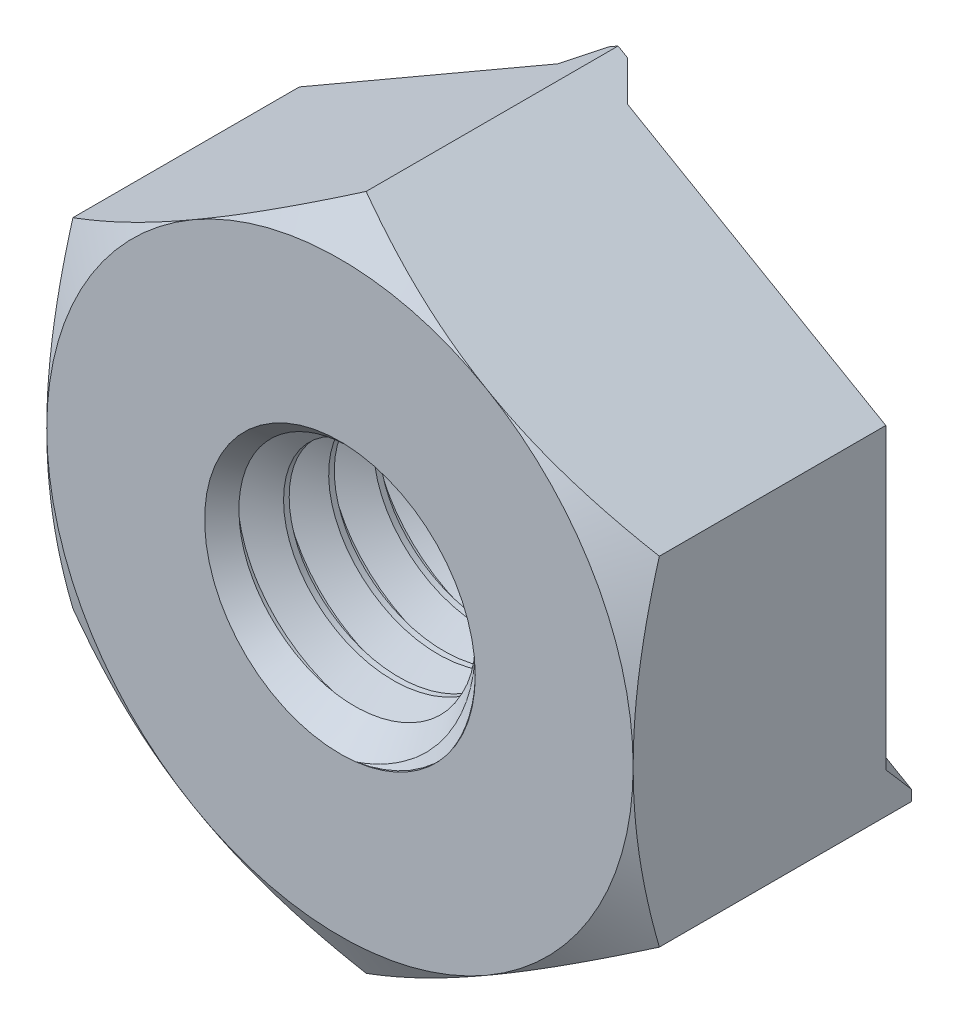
ISO-10303-21;
HEADER;
FILE_DESCRIPTION(('STEP AP214'),'2;1');
FILE_NAME('part.step','',(''),(''),'','','');
FILE_SCHEMA(('AUTOMOTIVE_DESIGN { 1 0 10303 214 1 1 1 1 }'));
ENDSEC;
DATA;
#1=APPLICATION_CONTEXT('core data for automotive mechanical design processes');
#2=APPLICATION_PROTOCOL_DEFINITION('international standard','automotive_design',2000,#1);
#3=PRODUCT_CONTEXT('',#1,'mechanical');
#4=PRODUCT('Part','Part','',(#3));
#5=PRODUCT_RELATED_PRODUCT_CATEGORY('part','',(#4));
#6=PRODUCT_DEFINITION_FORMATION('','',#4);
#7=PRODUCT_DEFINITION_CONTEXT('part definition',#1,'design');
#8=PRODUCT_DEFINITION('design','',#6,#7);
#9=PRODUCT_DEFINITION_SHAPE('','',#8);
#10=(LENGTH_UNIT() NAMED_UNIT(*) SI_UNIT(.MILLI.,.METRE.));
#11=(NAMED_UNIT(*) PLANE_ANGLE_UNIT() SI_UNIT($,.RADIAN.));
#12=(NAMED_UNIT(*) SI_UNIT($,.STERADIAN.) SOLID_ANGLE_UNIT());
#13=UNCERTAINTY_MEASURE_WITH_UNIT(LENGTH_MEASURE(1.E-05),#10,'distance_accuracy_value','');
#14=(GEOMETRIC_REPRESENTATION_CONTEXT(3) GLOBAL_UNCERTAINTY_ASSIGNED_CONTEXT((#13)) GLOBAL_UNIT_ASSIGNED_CONTEXT((#10,
#11,#12)) REPRESENTATION_CONTEXT('',''));
#15=CARTESIAN_POINT('',(0.,0.,0.));
#16=DIRECTION('',(0.,0.,1.));
#17=DIRECTION('',(1.,0.,0.));
#18=AXIS2_PLACEMENT_3D('',#15,#16,#17);
#19=CARTESIAN_POINT('',(0.,7.50555349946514,0.));
#20=DIRECTION('',(0.,0.,1.));
#21=DIRECTION('',(1.,0.,0.));
#22=AXIS2_PLACEMENT_3D('',#19,#20,#21);
#23=PLANE('',#22);
#24=DIRECTION('',(0.866025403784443,-0.499999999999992,0.));
#25=VECTOR('',#24,1.);
#26=CARTESIAN_POINT('',(-3.63749999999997,1.20521868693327,0.));
#27=LINE('',#26,#25);
#28=CARTESIAN_POINT('',(5.72500000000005,-4.2002232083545,0.));
#29=VERTEX_POINT('',#28);
#30=CARTESIAN_POINT('',(3.49533482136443,-2.91292541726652,0.));
#31=VERTEX_POINT('',#30);
#32=EDGE_CURVE('E532',#29,#31,#27,.F.);
#33=ORIENTED_EDGE('',*,*,#32,.F.);
#34=DIRECTION('',(0.866025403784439,0.5,0.));
#35=VECTOR('',#34,1.);
#36=CARTESIAN_POINT('',(0.,-7.50555349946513,0.));
#37=LINE('',#36,#35);
#38=CARTESIAN_POINT('',(0.,-7.50555349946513,0.));
#39=VERTEX_POINT('',#38);
#40=EDGE_CURVE('E482',#39,#29,#37,.T.);
#41=ORIENTED_EDGE('',*,*,#40,.F.);
#42=DIRECTION('',(0.866025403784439,-0.5,0.));
#43=VECTOR('',#42,1.);
#44=CARTESIAN_POINT('',(-6.5,-3.75277674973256,0.));
#45=LINE('',#44,#43);
#46=CARTESIAN_POINT('',(-5.72499999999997,-4.20022320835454,0.));
#47=VERTEX_POINT('',#46);
#48=EDGE_CURVE('E479',#47,#39,#45,.T.);
#49=ORIENTED_EDGE('',*,*,#48,.F.);
#50=DIRECTION('',(0.866025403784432,0.500000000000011,0.));
#51=VECTOR('',#50,1.);
#52=CARTESIAN_POINT('',(3.63750000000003,1.20521868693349,0.));
#53=LINE('',#52,#51);
#54=CARTESIAN_POINT('',(-3.49533482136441,-2.91292541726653,0.));
#55=VERTEX_POINT('',#54);
#56=EDGE_CURVE('E226',#55,#47,#53,.F.);
#57=ORIENTED_EDGE('',*,*,#56,.F.);
#58=CARTESIAN_POINT('',(0.,0.,0.));
#59=DIRECTION('',(0.,0.,1.));
#60=DIRECTION('',(1.,0.,0.));
#61=AXIS2_PLACEMENT_3D('',#58,#59,#60);
#62=CIRCLE('',#61,4.55);
#63=EDGE_CURVE('E511',#31,#55,#62,.F.);
#64=ORIENTED_EDGE('',*,*,#63,.F.);
#65=EDGE_LOOP('',(#33,#41,#49,#57,#64));
#66=FACE_BOUND('',#65,.T.);
#67=ADVANCED_FACE('F36',(#66),#23,.F.);
#68=DIRECTION('',(-0.866025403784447,0.499999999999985,0.));
#69=VECTOR('',#68,1.);
#70=CARTESIAN_POINT('',(-2.86249999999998,2.54755806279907,0.));
#71=LINE('',#70,#69);
#72=CARTESIAN_POINT('',(4.27033482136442,-1.57058604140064,0.));
#73=VERTEX_POINT('',#72);
#74=CARTESIAN_POINT('',(6.5,-2.85788383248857,0.));
#75=VERTEX_POINT('',#74);
#76=EDGE_CURVE('E530',#73,#75,#71,.F.);
#77=ORIENTED_EDGE('',*,*,#76,.F.);
#78=CARTESIAN_POINT('',(0.775000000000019,4.48351145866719,0.));
#79=VERTEX_POINT('',#78);
#80=EDGE_CURVE('E45',#79,#73,#62,.F.);
#81=ORIENTED_EDGE('',*,*,#80,.F.);
#82=DIRECTION('',(0.,-1.,0.));
#83=VECTOR('',#82,1.);
#84=CARTESIAN_POINT('',(0.775000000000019,7.05810704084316,0.));
#85=LINE('',#84,#83);
#86=CARTESIAN_POINT('',(0.775000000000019,7.05810704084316,0.));
#87=VERTEX_POINT('',#86);
#88=EDGE_CURVE('E249',#87,#79,#85,.T.);
#89=ORIENTED_EDGE('',*,*,#88,.F.);
#90=DIRECTION('',(-0.866025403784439,0.5,0.));
#91=VECTOR('',#90,1.);
#92=CARTESIAN_POINT('',(6.5,3.75277674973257,0.));
#93=LINE('',#92,#91);
#94=CARTESIAN_POINT('',(6.5,3.75277674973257,0.));
#95=VERTEX_POINT('',#94);
#96=EDGE_CURVE('E484',#95,#87,#93,.T.);
#97=ORIENTED_EDGE('',*,*,#96,.F.);
#98=DIRECTION('',(0.,1.,0.));
#99=VECTOR('',#98,1.);
#100=CARTESIAN_POINT('',(6.5,-3.75277674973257,0.));
#101=LINE('',#100,#99);
#102=EDGE_CURVE('E490',#75,#95,#101,.T.);
#103=ORIENTED_EDGE('',*,*,#102,.F.);
#104=EDGE_LOOP('',(#77,#81,#89,#97,#103));
#105=FACE_BOUND('',#104,.T.);
#106=ADVANCED_FACE('F447',(#105),#23,.F.);
#107=CARTESIAN_POINT('',(0.,0.,-1.13));
#108=DIRECTION('',(0.,0.,1.));
#109=DIRECTION('',(1.,0.,0.));
#110=AXIS2_PLACEMENT_3D('',#107,#108,#109);
#111=CYLINDRICAL_SURFACE('',#110,4.55);
#112=CARTESIAN_POINT('',(0.,0.,-1.13));
#113=DIRECTION('',(0.,0.,-1.));
#114=DIRECTION('',(-1.,0.,0.));
#115=AXIS2_PLACEMENT_3D('',#112,#113,#114);
#116=CIRCLE('',#115,4.55);
#117=CARTESIAN_POINT('',(-4.55,0.,-1.13));
#118=VERTEX_POINT('',#117);
#119=EDGE_CURVE('E342',#118,#118,#116,.T.);
#120=ORIENTED_EDGE('',*,*,#119,.F.);
#121=EDGE_LOOP('',(#120));
#122=FACE_BOUND('',#121,.T.);
#123=CARTESIAN_POINT('',(0.,0.,-0.775000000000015));
#124=DIRECTION('',(-0.353553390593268,-0.612372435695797,-0.707106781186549));
#125=DIRECTION('',(-0.353553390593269,-0.612372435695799,0.707106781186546));
#126=AXIS2_PLACEMENT_3D('',#123,#124,#125);
#127=ELLIPSE('',#126,6.43467170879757,4.55);
#128=CARTESIAN_POINT('',(3.83121645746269,-2.45444096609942,-0.565));
#129=VERTEX_POINT('',#128);
#130=EDGE_CURVE('E540',#129,#31,#127,.T.);
#131=ORIENTED_EDGE('',*,*,#130,.T.);
#132=ORIENTED_EDGE('',*,*,#63,.T.);
#133=CARTESIAN_POINT('',(0.,0.,-0.774999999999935));
#134=DIRECTION('',(0.353553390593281,-0.612372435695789,-0.707106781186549));
#135=DIRECTION('',(0.353553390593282,-0.612372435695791,0.707106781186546));
#136=AXIS2_PLACEMENT_3D('',#133,#134,#135);
#137=ELLIPSE('',#136,6.43467170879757,4.55);
#138=CARTESIAN_POINT('',(-3.83121645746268,-2.45444096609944,-0.565));
#139=VERTEX_POINT('',#138);
#140=EDGE_CURVE('E228',#139,#55,#137,.F.);
#141=ORIENTED_EDGE('',*,*,#140,.F.);
#142=CARTESIAN_POINT('',(0.,0.,-0.565));
#143=DIRECTION('',(0.,0.,1.));
#144=DIRECTION('',(0.500000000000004,-0.866025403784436,0.));
#145=AXIS2_PLACEMENT_3D('',#142,#143,#144);
#146=CIRCLE('',#145,4.55);
#147=CARTESIAN_POINT('',(-4.04121645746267,-2.09071029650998,-0.565));
#148=VERTEX_POINT('',#147);
#149=EDGE_CURVE('E212',#148,#139,#146,.T.);
#150=ORIENTED_EDGE('',*,*,#149,.F.);
#151=CARTESIAN_POINT('',(0.,0.,-0.775000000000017));
#152=DIRECTION('',(-0.353553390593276,0.612372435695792,-0.707106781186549));
#153=DIRECTION('',(-0.353553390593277,0.612372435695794,0.707106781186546));
#154=AXIS2_PLACEMENT_3D('',#151,#152,#153);
#155=ELLIPSE('',#154,6.43467170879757,4.55);
#156=CARTESIAN_POINT('',(-4.27033482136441,-1.57058604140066,0.));
#157=VERTEX_POINT('',#156);
#158=EDGE_CURVE('E554',#148,#157,#155,.T.);
#159=ORIENTED_EDGE('',*,*,#158,.T.);
#160=CARTESIAN_POINT('',(-0.774999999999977,4.48351145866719,0.));
#161=VERTEX_POINT('',#160);
#162=EDGE_CURVE('E469',#157,#161,#62,.F.);
#163=ORIENTED_EDGE('',*,*,#162,.T.);
#164=CARTESIAN_POINT('',(0.,0.,-0.774999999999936));
#165=DIRECTION('',(-0.707106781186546,0.,-0.707106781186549));
#166=DIRECTION('',(-0.707106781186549,0.,0.707106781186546));
#167=AXIS2_PLACEMENT_3D('',#164,#165,#166);
#168=ELLIPSE('',#167,6.43467170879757,4.55);
#169=CARTESIAN_POINT('',(-0.209999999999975,4.54515126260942,-0.565));
#170=VERTEX_POINT('',#169);
#171=EDGE_CURVE('E561',#170,#161,#168,.F.);
#172=ORIENTED_EDGE('',*,*,#171,.F.);
#173=CARTESIAN_POINT('',(0.,0.,-0.565));
#174=DIRECTION('',(0.,0.,1.));
#175=DIRECTION('',(-1.,0.,0.));
#176=AXIS2_PLACEMENT_3D('',#173,#174,#175);
#177=CIRCLE('',#176,4.55);
#178=CARTESIAN_POINT('',(0.210000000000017,4.54515126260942,-0.565));
#179=VERTEX_POINT('',#178);
#180=EDGE_CURVE('E563',#179,#170,#177,.T.);
#181=ORIENTED_EDGE('',*,*,#180,.F.);
#182=CARTESIAN_POINT('',(0.,0.,-0.775000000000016));
#183=DIRECTION('',(0.707106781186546,0.,-0.707106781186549));
#184=DIRECTION('',(0.707106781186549,0.,0.707106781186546));
#185=AXIS2_PLACEMENT_3D('',#182,#183,#184);
#186=ELLIPSE('',#185,6.43467170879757,4.55);
#187=EDGE_CURVE('E524',#179,#79,#186,.T.);
#188=ORIENTED_EDGE('',*,*,#187,.T.);
#189=ORIENTED_EDGE('',*,*,#80,.T.);
#190=CARTESIAN_POINT('',(0.,0.,-0.774999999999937));
#191=DIRECTION('',(0.353553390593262,0.6123724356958,-0.707106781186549));
#192=DIRECTION('',(0.353553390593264,0.612372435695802,0.707106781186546));
#193=AXIS2_PLACEMENT_3D('',#190,#191,#192);
#194=ELLIPSE('',#193,6.43467170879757,4.55);
#195=CARTESIAN_POINT('',(4.04121645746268,-2.09071029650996,-0.565));
#196=VERTEX_POINT('',#195);
#197=EDGE_CURVE('E522',#196,#73,#194,.F.);
#198=ORIENTED_EDGE('',*,*,#197,.F.);
#199=CARTESIAN_POINT('',(0.,0.,-0.565));
#200=DIRECTION('',(0.,0.,1.));
#201=DIRECTION('',(0.499999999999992,0.866025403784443,0.));
#202=AXIS2_PLACEMENT_3D('',#199,#200,#201);
#203=CIRCLE('',#202,4.55);
#204=EDGE_CURVE('E543',#129,#196,#203,.T.);
#205=ORIENTED_EDGE('',*,*,#204,.F.);
#206=EDGE_LOOP('',(#131,#132,#141,#150,#159,#163,#172,#181,#188,#189,#198,#205));
#207=FACE_BOUND('',#206,.T.);
#208=ADVANCED_FACE('F376',(#122,#207),#111,.T.);
#209=DIRECTION('',(-0.866025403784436,-0.500000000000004,0.));
#210=VECTOR('',#209,1.);
#211=CARTESIAN_POINT('',(2.8625,2.54755806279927,0.));
#212=LINE('',#211,#210);
#213=CARTESIAN_POINT('',(-6.5,-2.85788383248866,0.));
#214=VERTEX_POINT('',#213);
#215=EDGE_CURVE('E464',#214,#157,#212,.F.);
#216=ORIENTED_EDGE('',*,*,#215,.F.);
#217=DIRECTION('',(0.,-1.,0.));
#218=VECTOR('',#217,1.);
#219=CARTESIAN_POINT('',(-6.5,3.75277674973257,0.));
#220=LINE('',#219,#218);
#221=CARTESIAN_POINT('',(-6.5,3.75277674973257,0.));
#222=VERTEX_POINT('',#221);
#223=EDGE_CURVE('E467',#222,#214,#220,.T.);
#224=ORIENTED_EDGE('',*,*,#223,.F.);
#225=DIRECTION('',(-0.866025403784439,-0.5,0.));
#226=VECTOR('',#225,1.);
#227=CARTESIAN_POINT('',(0.,7.50555349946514,0.));
#228=LINE('',#227,#226);
#229=CARTESIAN_POINT('',(-0.774999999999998,7.05810704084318,0.));
#230=VERTEX_POINT('',#229);
#231=EDGE_CURVE('E480',#230,#222,#228,.T.);
#232=ORIENTED_EDGE('',*,*,#231,.F.);
#233=DIRECTION('',(0.,1.,0.));
#234=VECTOR('',#233,1.);
#235=CARTESIAN_POINT('',(-0.774999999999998,7.05810704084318,0.));
#236=LINE('',#235,#234);
#237=EDGE_CURVE('E243',#161,#230,#236,.T.);
#238=ORIENTED_EDGE('',*,*,#237,.F.);
#239=ORIENTED_EDGE('',*,*,#162,.F.);
#240=EDGE_LOOP('',(#216,#224,#232,#238,#239));
#241=FACE_BOUND('',#240,.T.);
#242=ADVANCED_FACE('F297',(#241),#23,.F.);
#243=CARTESIAN_POINT('',(2.9999999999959,-4.96024737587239E-06,-1.6299997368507));
#244=CARTESIAN_POINT('',(2.99999713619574,-1.73205576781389,-1.54666640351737));
#245=CARTESIAN_POINT('',(1.49999570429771,-2.59807869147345,-1.46333307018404));
#246=CARTESIAN_POINT('',(-5.72760031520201E-06,-3.46410161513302,-1.3799997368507));
#247=CARTESIAN_POINT('',(-1.50000429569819,-2.59807373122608,-1.29666640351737));
#248=CARTESIAN_POINT('',(-3.00000286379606,-1.73204584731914,-1.21333307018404));
#249=CARTESIAN_POINT('',(-2.9999999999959,4.96024737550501E-06,-1.1299997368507));
#250=CARTESIAN_POINT('',(-2.99999713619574,1.73205576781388,-1.04666640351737));
#251=CARTESIAN_POINT('',(-1.49999570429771,2.59807869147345,-0.963333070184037));
#252=CARTESIAN_POINT('',(5.72760031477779E-06,3.46410161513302,-0.879999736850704));
#253=CARTESIAN_POINT('',(1.50000429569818,2.59807373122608,-0.796666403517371));
#254=CARTESIAN_POINT('',(3.00000286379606,1.73204584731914,-0.713333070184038));
#255=CARTESIAN_POINT('',(2.9999999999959,-4.96024737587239E-06,-0.629999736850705));
#256=CARTESIAN_POINT('',(2.99999713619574,-1.73205576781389,-0.546666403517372));
#257=CARTESIAN_POINT('',(1.49999570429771,-2.59807869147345,-0.463333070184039));
#258=CARTESIAN_POINT('',(-5.72760031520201E-06,-3.46410161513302,-0.379999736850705));
#259=CARTESIAN_POINT('',(-1.50000429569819,-2.59807373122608,-0.296666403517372));
#260=CARTESIAN_POINT('',(-3.00000286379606,-1.73204584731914,-0.213333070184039));
#261=CARTESIAN_POINT('',(-2.9999999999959,4.96024737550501E-06,-0.129999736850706));
#262=CARTESIAN_POINT('',(-2.99999713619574,1.73205576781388,-0.0466664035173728));
#263=CARTESIAN_POINT('',(-1.49999570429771,2.59807869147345,0.0366669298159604));
#264=CARTESIAN_POINT('',(5.72760031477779E-06,3.46410161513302,0.120000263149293));
#265=CARTESIAN_POINT('',(1.50000429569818,2.59807373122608,0.203333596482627));
#266=CARTESIAN_POINT('',(3.00000286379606,1.73204584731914,0.28666692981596));
#267=CARTESIAN_POINT('',(2.9999999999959,-4.96024737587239E-06,0.370000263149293));
#268=CARTESIAN_POINT('',(2.99999713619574,-1.73205576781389,0.453333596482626));
#269=CARTESIAN_POINT('',(1.49999570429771,-2.59807869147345,0.536666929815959));
#270=CARTESIAN_POINT('',(-5.72760031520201E-06,-3.46410161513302,0.620000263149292));
#271=CARTESIAN_POINT('',(-1.50000429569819,-2.59807373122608,0.703333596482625));
#272=CARTESIAN_POINT('',(-3.00000286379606,-1.73204584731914,0.786666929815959));
#273=CARTESIAN_POINT('',(-2.9999999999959,4.96024737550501E-06,0.870000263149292));
#274=CARTESIAN_POINT('',(-2.99999713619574,1.73205576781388,0.953333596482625));
#275=CARTESIAN_POINT('',(-1.49999570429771,2.59807869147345,1.03666692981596));
#276=CARTESIAN_POINT('',(5.72760031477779E-06,3.46410161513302,1.12000026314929));
#277=CARTESIAN_POINT('',(1.50000429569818,2.59807373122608,1.20333359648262));
#278=CARTESIAN_POINT('',(3.00000286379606,1.73204584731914,1.28666692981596));
#279=CARTESIAN_POINT('',(2.9999999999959,-4.96024737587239E-06,1.37000026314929));
#280=CARTESIAN_POINT('',(2.99999713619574,-1.73205576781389,1.45333359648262));
#281=CARTESIAN_POINT('',(1.49999570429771,-2.59807869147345,1.53666692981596));
#282=CARTESIAN_POINT('',(-5.72760031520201E-06,-3.46410161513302,1.62000026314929));
#283=CARTESIAN_POINT('',(-1.50000429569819,-2.59807373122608,1.70333359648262));
#284=CARTESIAN_POINT('',(-3.00000286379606,-1.73204584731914,1.78666692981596));
#285=CARTESIAN_POINT('',(-2.9999999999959,4.96024737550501E-06,1.87000026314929));
#286=CARTESIAN_POINT('',(-2.99999713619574,1.73205576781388,1.95333359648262));
#287=CARTESIAN_POINT('',(-1.49999570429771,2.59807869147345,2.03666692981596));
#288=CARTESIAN_POINT('',(5.72760031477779E-06,3.46410161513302,2.12000026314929));
#289=CARTESIAN_POINT('',(1.50000429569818,2.59807373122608,2.20333359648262));
#290=CARTESIAN_POINT('',(3.00000286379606,1.73204584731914,2.28666692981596));
#291=CARTESIAN_POINT('',(2.9999999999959,-4.96024737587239E-06,2.37000026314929));
#292=CARTESIAN_POINT('',(2.99999713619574,-1.73205576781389,2.45333359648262));
#293=CARTESIAN_POINT('',(1.49999570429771,-2.59807869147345,2.53666692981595));
#294=CARTESIAN_POINT('',(-5.72760031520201E-06,-3.46410161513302,2.62000026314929));
#295=CARTESIAN_POINT('',(-1.50000429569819,-2.59807373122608,2.70333359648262));
#296=CARTESIAN_POINT('',(-3.00000286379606,-1.73204584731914,2.78666692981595));
#297=CARTESIAN_POINT('',(-2.9999999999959,4.96024737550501E-06,2.87000026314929));
#298=CARTESIAN_POINT('',(-2.99999713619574,1.73205576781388,2.95333359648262));
#299=CARTESIAN_POINT('',(-1.49999570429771,2.59807869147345,3.03666692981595));
#300=CARTESIAN_POINT('',(5.72760031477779E-06,3.46410161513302,3.12000026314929));
#301=CARTESIAN_POINT('',(1.50000429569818,2.59807373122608,3.20333359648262));
#302=CARTESIAN_POINT('',(3.00000286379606,1.73204584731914,3.28666692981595));
#303=CARTESIAN_POINT('',(2.9999999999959,-4.96024737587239E-06,3.37000026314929));
#304=CARTESIAN_POINT('',(2.99999713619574,-1.73205576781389,3.45333359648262));
#305=CARTESIAN_POINT('',(1.49999570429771,-2.59807869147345,3.53666692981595));
#306=CARTESIAN_POINT('',(-5.72760031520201E-06,-3.46410161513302,3.62000026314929));
#307=CARTESIAN_POINT('',(-1.50000429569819,-2.59807373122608,3.70333359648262));
#308=CARTESIAN_POINT('',(-3.00000286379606,-1.73204584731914,3.78666692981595));
#309=CARTESIAN_POINT('',(-2.9999999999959,4.96024737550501E-06,3.87000026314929));
#310=CARTESIAN_POINT('',(-2.99999713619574,1.73205576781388,3.95333359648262));
#311=CARTESIAN_POINT('',(-1.49999570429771,2.59807869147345,4.03666692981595));
#312=CARTESIAN_POINT('',(5.72760031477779E-06,3.46410161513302,4.12000026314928));
#313=CARTESIAN_POINT('',(1.50000429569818,2.59807373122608,4.20333359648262));
#314=CARTESIAN_POINT('',(3.00000286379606,1.73204584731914,4.28666692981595));
#315=CARTESIAN_POINT('',(2.9999999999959,-4.96024737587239E-06,4.37000026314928));
#316=CARTESIAN_POINT('',(2.99999713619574,-1.73205576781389,4.45333359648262));
#317=CARTESIAN_POINT('',(1.49999570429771,-2.59807869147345,4.53666692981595));
#318=CARTESIAN_POINT('',(-5.72760031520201E-06,-3.46410161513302,4.62000026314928));
#319=CARTESIAN_POINT('',(-1.50000429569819,-2.59807373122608,4.70333359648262));
#320=CARTESIAN_POINT('',(-3.00000286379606,-1.73204584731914,4.78666692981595));
#321=CARTESIAN_POINT('',(-2.9999999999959,4.96024737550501E-06,4.87000026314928));
#322=CARTESIAN_POINT('',(-2.99999713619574,1.73205576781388,4.95333359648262));
#323=CARTESIAN_POINT('',(-1.49999570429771,2.59807869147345,5.03666692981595));
#324=CARTESIAN_POINT('',(5.72760031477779E-06,3.46410161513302,5.12000026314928));
#325=CARTESIAN_POINT('',(1.50000429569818,2.59807373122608,5.20333359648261));
#326=CARTESIAN_POINT('',(3.00000286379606,1.73204584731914,5.28666692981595));
#327=CARTESIAN_POINT('',(2.9999999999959,-4.96024737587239E-06,5.37000026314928));
#328=CARTESIAN_POINT('',(2.99999713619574,-1.73205576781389,5.45333359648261));
#329=CARTESIAN_POINT('',(1.49999570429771,-2.59807869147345,5.53666692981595));
#330=CARTESIAN_POINT('',(-5.72760031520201E-06,-3.46410161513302,5.62000026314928));
#331=CARTESIAN_POINT('',(-1.50000429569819,-2.59807373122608,5.70333359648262));
#332=CARTESIAN_POINT('',(-3.00000286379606,-1.73204584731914,5.78666692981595));
#333=CARTESIAN_POINT('',(-2.9999999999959,4.96024737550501E-06,5.87000026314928));
#334=CARTESIAN_POINT('',(-2.99999713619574,1.73205576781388,5.95333359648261));
#335=CARTESIAN_POINT('',(-1.49999570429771,2.59807869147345,6.03666692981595));
#336=CARTESIAN_POINT('',(5.72760031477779E-06,3.46410161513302,6.12000026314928));
#337=CARTESIAN_POINT('',(1.50000429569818,2.59807373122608,6.20333359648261));
#338=CARTESIAN_POINT('',(3.00000286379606,1.73204584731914,6.28666692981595));
#339=CARTESIAN_POINT('',(2.9999999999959,-4.96024737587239E-06,6.37000026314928));
#340=CARTESIAN_POINT('',(2.99999713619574,-1.73205576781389,6.45333359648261));
#341=CARTESIAN_POINT('',(1.49999570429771,-2.59807869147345,6.53666692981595));
#342=CARTESIAN_POINT('',(-5.72760031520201E-06,-3.46410161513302,6.62000026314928));
#343=CARTESIAN_POINT('',(-1.50000429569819,-2.59807373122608,6.70333359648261));
#344=CARTESIAN_POINT('',(-3.00000286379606,-1.73204584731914,6.78666692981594));
#345=CARTESIAN_POINT('',(-2.9999999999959,4.96024737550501E-06,6.87000026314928));
#346=CARTESIAN_POINT('',(-2.99999713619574,1.73205576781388,6.95333359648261));
#347=CARTESIAN_POINT('',(-1.49999570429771,2.59807869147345,7.03666692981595));
#348=CARTESIAN_POINT('',(5.72760031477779E-06,3.46410161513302,7.12000026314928));
#349=CARTESIAN_POINT('',(1.50000429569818,2.59807373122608,7.20333359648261));
#350=CARTESIAN_POINT('',(3.00000286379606,1.73204584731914,7.28666692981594));
#351=CARTESIAN_POINT('',(2.9999999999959,-4.96024737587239E-06,7.37000026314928));
#352=CARTESIAN_POINT('',(2.99999713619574,-1.73205576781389,7.45333359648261));
#353=CARTESIAN_POINT('',(1.49999570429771,-2.59807869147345,7.53666692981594));
#354=CARTESIAN_POINT('',(-5.72760031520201E-06,-3.46410161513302,7.62000026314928));
#355=CARTESIAN_POINT('',(-1.50000429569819,-2.59807373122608,7.70333359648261));
#356=CARTESIAN_POINT('',(-3.00000286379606,-1.73204584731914,7.78666692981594));
#357=CARTESIAN_POINT('',(-2.9999999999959,4.96024737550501E-06,7.87000026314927));
#358=CARTESIAN_POINT('',(-2.99999713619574,1.73205576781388,7.95333359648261));
#359=CARTESIAN_POINT('',(-1.49999570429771,2.59807869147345,8.03666692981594));
#360=CARTESIAN_POINT('',(5.72760031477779E-06,3.46410161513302,8.12000026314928));
#361=CARTESIAN_POINT('',(1.50000429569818,2.59807373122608,8.20333359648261));
#362=CARTESIAN_POINT('',(3.00000286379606,1.73204584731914,8.28666692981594));
#363=CARTESIAN_POINT('',(2.9999999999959,-4.96024737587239E-06,8.37000026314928));
#364=CARTESIAN_POINT('',(2.35048094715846,-3.88632231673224E-06,-2.0049997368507));
#365=CARTESIAN_POINT('',(2.35047870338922,-1.35705469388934,-1.92166640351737));
#366=CARTESIAN_POINT('',(1.17523710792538,-2.03557815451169,-1.83833307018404));
#367=CARTESIAN_POINT('',(-4.48753847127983E-06,-2.71410161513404,-1.7549997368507));
#368=CARTESIAN_POINT('',(-1.17524383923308,-2.03557426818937,-1.67166640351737));
#369=CARTESIAN_POINT('',(-2.35048319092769,-1.35704692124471,-1.58833307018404));
#370=CARTESIAN_POINT('',(-2.35048094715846,3.8863223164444E-06,-1.5049997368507));
#371=CARTESIAN_POINT('',(-2.35047870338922,1.35705469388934,-1.42166640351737));
#372=CARTESIAN_POINT('',(-1.17523710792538,2.03557815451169,-1.33833307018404));
#373=CARTESIAN_POINT('',(4.48753847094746E-06,2.71410161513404,-1.25499973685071));
#374=CARTESIAN_POINT('',(1.17524383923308,2.03557426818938,-1.17166640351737));
#375=CARTESIAN_POINT('',(2.35048319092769,1.35704692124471,-1.08833307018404));
#376=CARTESIAN_POINT('',(2.35048094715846,-3.88632231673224E-06,-1.00499973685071));
#377=CARTESIAN_POINT('',(2.35047870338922,-1.35705469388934,-0.921666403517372));
#378=CARTESIAN_POINT('',(1.17523710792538,-2.03557815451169,-0.838333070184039));
#379=CARTESIAN_POINT('',(-4.48753847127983E-06,-2.71410161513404,-0.754999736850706));
#380=CARTESIAN_POINT('',(-1.17524383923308,-2.03557426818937,-0.671666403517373));
#381=CARTESIAN_POINT('',(-2.35048319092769,-1.35704692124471,-0.58833307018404));
#382=CARTESIAN_POINT('',(-2.35048094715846,3.8863223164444E-06,-0.504999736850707));
#383=CARTESIAN_POINT('',(-2.35047870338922,1.35705469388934,-0.421666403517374));
#384=CARTESIAN_POINT('',(-1.17523710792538,2.03557815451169,-0.33833307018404));
#385=CARTESIAN_POINT('',(4.48753847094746E-06,2.71410161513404,-0.254999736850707));
#386=CARTESIAN_POINT('',(1.17524383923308,2.03557426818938,-0.171666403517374));
#387=CARTESIAN_POINT('',(2.35048319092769,1.35704692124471,-0.088333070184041));
#388=CARTESIAN_POINT('',(2.35048094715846,-3.88632231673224E-06,-0.00499973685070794));
#389=CARTESIAN_POINT('',(2.35047870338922,-1.35705469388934,0.0783335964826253));
#390=CARTESIAN_POINT('',(1.17523710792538,-2.03557815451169,0.161666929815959));
#391=CARTESIAN_POINT('',(-4.48753847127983E-06,-2.71410161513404,0.245000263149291));
#392=CARTESIAN_POINT('',(-1.17524383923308,-2.03557426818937,0.328333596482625));
#393=CARTESIAN_POINT('',(-2.35048319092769,-1.35704692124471,0.411666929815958));
#394=CARTESIAN_POINT('',(-2.35048094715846,3.8863223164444E-06,0.495000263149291));
#395=CARTESIAN_POINT('',(-2.35047870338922,1.35705469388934,0.578333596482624));
#396=CARTESIAN_POINT('',(-1.17523710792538,2.03557815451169,0.661666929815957));
#397=CARTESIAN_POINT('',(4.48753847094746E-06,2.71410161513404,0.745000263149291));
#398=CARTESIAN_POINT('',(1.17524383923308,2.03557426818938,0.828333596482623));
#399=CARTESIAN_POINT('',(2.35048319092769,1.35704692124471,0.911666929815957));
#400=CARTESIAN_POINT('',(2.35048094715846,-3.88632231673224E-06,0.99500026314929));
#401=CARTESIAN_POINT('',(2.35047870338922,-1.35705469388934,1.07833359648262));
#402=CARTESIAN_POINT('',(1.17523710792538,-2.03557815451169,1.16166692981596));
#403=CARTESIAN_POINT('',(-4.48753847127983E-06,-2.71410161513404,1.24500026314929));
#404=CARTESIAN_POINT('',(-1.17524383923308,-2.03557426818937,1.32833359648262));
#405=CARTESIAN_POINT('',(-2.35048319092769,-1.35704692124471,1.41166692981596));
#406=CARTESIAN_POINT('',(-2.35048094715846,3.8863223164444E-06,1.49500026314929));
#407=CARTESIAN_POINT('',(-2.35047870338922,1.35705469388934,1.57833359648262));
#408=CARTESIAN_POINT('',(-1.17523710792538,2.03557815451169,1.66166692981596));
#409=CARTESIAN_POINT('',(4.48753847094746E-06,2.71410161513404,1.74500026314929));
#410=CARTESIAN_POINT('',(1.17524383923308,2.03557426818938,1.82833359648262));
#411=CARTESIAN_POINT('',(2.35048319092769,1.35704692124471,1.91166692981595));
#412=CARTESIAN_POINT('',(2.35048094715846,-3.88632231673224E-06,1.99500026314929));
#413=CARTESIAN_POINT('',(2.35047870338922,-1.35705469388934,2.07833359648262));
#414=CARTESIAN_POINT('',(1.17523710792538,-2.03557815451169,2.16166692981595));
#415=CARTESIAN_POINT('',(-4.48753847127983E-06,-2.71410161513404,2.24500026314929));
#416=CARTESIAN_POINT('',(-1.17524383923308,-2.03557426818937,2.32833359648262));
#417=CARTESIAN_POINT('',(-2.35048319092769,-1.35704692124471,2.41166692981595));
#418=CARTESIAN_POINT('',(-2.35048094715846,3.8863223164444E-06,2.49500026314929));
#419=CARTESIAN_POINT('',(-2.35047870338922,1.35705469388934,2.57833359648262));
#420=CARTESIAN_POINT('',(-1.17523710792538,2.03557815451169,2.66166692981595));
#421=CARTESIAN_POINT('',(4.48753847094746E-06,2.71410161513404,2.74500026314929));
#422=CARTESIAN_POINT('',(1.17524383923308,2.03557426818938,2.82833359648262));
#423=CARTESIAN_POINT('',(2.35048319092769,1.35704692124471,2.91166692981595));
#424=CARTESIAN_POINT('',(2.35048094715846,-3.88632231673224E-06,2.99500026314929));
#425=CARTESIAN_POINT('',(2.35047870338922,-1.35705469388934,3.07833359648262));
#426=CARTESIAN_POINT('',(1.17523710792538,-2.03557815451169,3.16166692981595));
#427=CARTESIAN_POINT('',(-4.48753847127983E-06,-2.71410161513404,3.24500026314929));
#428=CARTESIAN_POINT('',(-1.17524383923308,-2.03557426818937,3.32833359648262));
#429=CARTESIAN_POINT('',(-2.35048319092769,-1.35704692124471,3.41166692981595));
#430=CARTESIAN_POINT('',(-2.35048094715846,3.8863223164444E-06,3.49500026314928));
#431=CARTESIAN_POINT('',(-2.35047870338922,1.35705469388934,3.57833359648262));
#432=CARTESIAN_POINT('',(-1.17523710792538,2.03557815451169,3.66166692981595));
#433=CARTESIAN_POINT('',(4.48753847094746E-06,2.71410161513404,3.74500026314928));
#434=CARTESIAN_POINT('',(1.17524383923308,2.03557426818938,3.82833359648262));
#435=CARTESIAN_POINT('',(2.35048319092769,1.35704692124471,3.91166692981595));
#436=CARTESIAN_POINT('',(2.35048094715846,-3.88632231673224E-06,3.99500026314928));
#437=CARTESIAN_POINT('',(2.35047870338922,-1.35705469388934,4.07833359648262));
#438=CARTESIAN_POINT('',(1.17523710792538,-2.03557815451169,4.16166692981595));
#439=CARTESIAN_POINT('',(-4.48753847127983E-06,-2.71410161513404,4.24500026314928));
#440=CARTESIAN_POINT('',(-1.17524383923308,-2.03557426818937,4.32833359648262));
#441=CARTESIAN_POINT('',(-2.35048319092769,-1.35704692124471,4.41166692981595));
#442=CARTESIAN_POINT('',(-2.35048094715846,3.8863223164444E-06,4.49500026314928));
#443=CARTESIAN_POINT('',(-2.35047870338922,1.35705469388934,4.57833359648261));
#444=CARTESIAN_POINT('',(-1.17523710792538,2.03557815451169,4.66166692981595));
#445=CARTESIAN_POINT('',(4.48753847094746E-06,2.71410161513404,4.74500026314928));
#446=CARTESIAN_POINT('',(1.17524383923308,2.03557426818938,4.82833359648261));
#447=CARTESIAN_POINT('',(2.35048319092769,1.35704692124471,4.91166692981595));
#448=CARTESIAN_POINT('',(2.35048094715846,-3.88632231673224E-06,4.99500026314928));
#449=CARTESIAN_POINT('',(2.35047870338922,-1.35705469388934,5.07833359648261));
#450=CARTESIAN_POINT('',(1.17523710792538,-2.03557815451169,5.16166692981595));
#451=CARTESIAN_POINT('',(-4.48753847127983E-06,-2.71410161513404,5.24500026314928));
#452=CARTESIAN_POINT('',(-1.17524383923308,-2.03557426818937,5.32833359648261));
#453=CARTESIAN_POINT('',(-2.35048319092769,-1.35704692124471,5.41166692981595));
#454=CARTESIAN_POINT('',(-2.35048094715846,3.8863223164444E-06,5.49500026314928));
#455=CARTESIAN_POINT('',(-2.35047870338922,1.35705469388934,5.57833359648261));
#456=CARTESIAN_POINT('',(-1.17523710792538,2.03557815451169,5.66166692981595));
#457=CARTESIAN_POINT('',(4.48753847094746E-06,2.71410161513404,5.74500026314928));
#458=CARTESIAN_POINT('',(1.17524383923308,2.03557426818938,5.82833359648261));
#459=CARTESIAN_POINT('',(2.35048319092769,1.35704692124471,5.91166692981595));
#460=CARTESIAN_POINT('',(2.35048094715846,-3.88632231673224E-06,5.99500026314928));
#461=CARTESIAN_POINT('',(2.35047870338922,-1.35705469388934,6.07833359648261));
#462=CARTESIAN_POINT('',(1.17523710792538,-2.03557815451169,6.16166692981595));
#463=CARTESIAN_POINT('',(-4.48753847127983E-06,-2.71410161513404,6.24500026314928));
#464=CARTESIAN_POINT('',(-1.17524383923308,-2.03557426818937,6.32833359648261));
#465=CARTESIAN_POINT('',(-2.35048319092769,-1.35704692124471,6.41166692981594));
#466=CARTESIAN_POINT('',(-2.35048094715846,3.8863223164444E-06,6.49500026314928));
#467=CARTESIAN_POINT('',(-2.35047870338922,1.35705469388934,6.57833359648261));
#468=CARTESIAN_POINT('',(-1.17523710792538,2.03557815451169,6.66166692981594));
#469=CARTESIAN_POINT('',(4.48753847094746E-06,2.71410161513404,6.74500026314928));
#470=CARTESIAN_POINT('',(1.17524383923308,2.03557426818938,6.82833359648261));
#471=CARTESIAN_POINT('',(2.35048319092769,1.35704692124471,6.91166692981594));
#472=CARTESIAN_POINT('',(2.35048094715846,-3.88632231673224E-06,6.99500026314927));
#473=CARTESIAN_POINT('',(2.35047870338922,-1.35705469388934,7.07833359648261));
#474=CARTESIAN_POINT('',(1.17523710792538,-2.03557815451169,7.16166692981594));
#475=CARTESIAN_POINT('',(-4.48753847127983E-06,-2.71410161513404,7.24500026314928));
#476=CARTESIAN_POINT('',(-1.17524383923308,-2.03557426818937,7.32833359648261));
#477=CARTESIAN_POINT('',(-2.35048319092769,-1.35704692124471,7.41166692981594));
#478=CARTESIAN_POINT('',(-2.35048094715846,3.8863223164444E-06,7.49500026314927));
#479=CARTESIAN_POINT('',(-2.35047870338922,1.35705469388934,7.57833359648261));
#480=CARTESIAN_POINT('',(-1.17523710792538,2.03557815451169,7.66166692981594));
#481=CARTESIAN_POINT('',(4.48753847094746E-06,2.71410161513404,7.74500026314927));
#482=CARTESIAN_POINT('',(1.17524383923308,2.03557426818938,7.82833359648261));
#483=CARTESIAN_POINT('',(2.35048319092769,1.35704692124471,7.91166692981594));
#484=CARTESIAN_POINT('',(2.35048094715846,-3.88632231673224E-06,7.99500026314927));
#485=(BOUNDED_SURFACE() B_SPLINE_SURFACE(1,2,((#243,#244,#245,#246,#247,#248,#249,#250,#251,
#252,#253,#254,#255,#256,#257,#258,#259,#260,#261,#262,#263,#264,#265,#266,#267,#268,#269,#270,
#271,#272,#273,#274,#275,#276,#277,#278,#279,#280,#281,#282,#283,#284,#285,#286,#287,#288,#289,
#290,#291,#292,#293,#294,#295,#296,#297,#298,#299,#300,#301,#302,#303,#304,#305,#306,#307,#308,
#309,#310,#311,#312,#313,#314,#315,#316,#317,#318,#319,#320,#321,#322,#323,#324,#325,#326,#327,
#328,#329,#330,#331,#332,#333,#334,#335,#336,#337,#338,#339,#340,#341,#342,#343,#344,#345,#346,
#347,#348,#349,#350,#351,#352,#353,#354,#355,#356,#357,#358,#359,#360,#361,#362,#363),(#364,
#365,#366,#367,#368,#369,#370,#371,#372,#373,#374,#375,#376,#377,#378,#379,#380,#381,#382,#383,
#384,#385,#386,#387,#388,#389,#390,#391,#392,#393,#394,#395,#396,#397,#398,#399,#400,#401,#402,
#403,#404,#405,#406,#407,#408,#409,#410,#411,#412,#413,#414,#415,#416,#417,#418,#419,#420,#421,
#422,#423,#424,#425,#426,#427,#428,#429,#430,#431,#432,#433,#434,#435,#436,#437,#438,#439,#440,
#441,#442,#443,#444,#445,#446,#447,#448,#449,#450,#451,#452,#453,#454,#455,#456,#457,#458,#459,
#460,#461,#462,#463,#464,#465,#466,#467,#468,#469,#470,#471,#472,#473,#474,#475,#476,#477,#478,
#479,#480,#481,#482,#483,#484)),.UNSPECIFIED.,.F.,.F.,.F.) B_SPLINE_SURFACE_WITH_KNOTS((2,2),(3,
2,2,2,2,2,2,2,2,2,2,2,2,2,2,2,2,2,2,2,2,2,2,2,2,2,2,2,2,2,2,2,2,2,2,2,2,2,2,2,2,2,2,2,2,2,2,2,2,
2,2,2,2,2,2,2,2,2,2,2,3),(0.,1.),(0.,0.0166666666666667,0.0333333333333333,0.05,
0.0666666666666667,0.0833333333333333,0.1,0.116666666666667,0.133333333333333,0.15,
0.166666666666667,0.183333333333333,0.2,0.216666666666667,0.233333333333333,0.25,
0.266666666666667,0.283333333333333,0.3,0.316666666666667,0.333333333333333,0.35,
0.366666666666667,0.383333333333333,0.4,0.416666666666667,0.433333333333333,0.45,
0.466666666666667,0.483333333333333,0.5,0.516666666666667,0.533333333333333,0.55,
0.566666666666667,0.583333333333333,0.6,0.616666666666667,0.633333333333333,0.65,
0.666666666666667,0.683333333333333,0.7,0.716666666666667,0.733333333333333,0.75,
0.766666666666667,0.783333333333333,0.8,0.816666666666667,0.833333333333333,0.85,
0.866666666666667,0.883333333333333,0.9,0.916666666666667,0.933333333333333,0.95,
0.966666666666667,0.983333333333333,1.),
.UNSPECIFIED.) GEOMETRIC_REPRESENTATION_ITEM() RATIONAL_B_SPLINE_SURFACE(((1.,0.866025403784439,
1.,0.866025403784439,1.,0.866025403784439,1.,0.866025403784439,1.,0.866025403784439,1.,
0.866025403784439,1.,0.866025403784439,1.,0.866025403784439,1.,0.866025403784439,1.,
0.866025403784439,1.,0.866025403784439,1.,0.866025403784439,1.,0.866025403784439,1.,
0.866025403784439,1.,0.866025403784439,1.,0.866025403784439,1.,0.866025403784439,1.,
0.866025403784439,1.,0.866025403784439,1.,0.866025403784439,1.,0.866025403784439,1.,
0.866025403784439,1.,0.866025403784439,1.,0.866025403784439,1.,0.866025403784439,1.,
0.866025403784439,1.,0.866025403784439,1.,0.866025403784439,1.,0.866025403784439,1.,
0.866025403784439,1.,0.866025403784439,1.,0.866025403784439,1.,0.866025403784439,1.,
0.866025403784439,1.,0.866025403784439,1.,0.866025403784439,1.,0.866025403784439,1.,
0.866025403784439,1.,0.866025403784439,1.,0.866025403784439,1.,0.866025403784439,1.,
0.866025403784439,1.,0.866025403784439,1.,0.866025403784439,1.,0.866025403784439,1.,
0.866025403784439,1.,0.866025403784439,1.,0.866025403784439,1.,0.866025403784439,1.,
0.866025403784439,1.,0.866025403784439,1.,0.866025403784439,1.,0.866025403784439,1.,
0.866025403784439,1.,0.866025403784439,1.,0.866025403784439,1.,0.866025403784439,1.,
0.866025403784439,1.,0.866025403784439,1.,0.866025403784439,1.),(1.,0.866025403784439,1.,
0.866025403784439,1.,0.866025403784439,1.,0.866025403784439,1.,0.866025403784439,1.,
0.866025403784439,1.,0.866025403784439,1.,0.866025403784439,1.,0.866025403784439,1.,
0.866025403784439,1.,0.866025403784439,1.,0.866025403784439,1.,0.866025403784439,1.,
0.866025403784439,1.,0.866025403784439,1.,0.866025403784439,1.,0.866025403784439,1.,
0.866025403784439,1.,0.866025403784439,1.,0.866025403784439,1.,0.866025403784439,1.,
0.866025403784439,1.,0.866025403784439,1.,0.866025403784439,1.,0.866025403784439,1.,
0.866025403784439,1.,0.866025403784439,1.,0.866025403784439,1.,0.866025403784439,1.,
0.866025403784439,1.,0.866025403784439,1.,0.866025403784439,1.,0.866025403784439,1.,
0.866025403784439,1.,0.866025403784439,1.,0.866025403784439,1.,0.866025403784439,1.,
0.866025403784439,1.,0.866025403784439,1.,0.866025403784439,1.,0.866025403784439,1.,
0.866025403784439,1.,0.866025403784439,1.,0.866025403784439,1.,0.866025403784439,1.,
0.866025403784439,1.,0.866025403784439,1.,0.866025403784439,1.,0.866025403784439,1.,
0.866025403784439,1.,0.866025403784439,1.,0.866025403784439,1.,0.866025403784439,1.,
0.866025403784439,1.,0.866025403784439,1.,0.866025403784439,1.,0.866025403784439,1.,
0.866025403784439,1.,0.866025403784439,1.,0.866025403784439,1.))) REPRESENTATION_ITEM('') SURFACE());
#486=CARTESIAN_POINT('',(0.359999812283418,-2.97832169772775,5.6));
#487=CARTESIAN_POINT('',(0.427840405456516,-2.96099976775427,5.59094033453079));
#488=CARTESIAN_POINT('',(0.495076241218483,-2.94131197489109,5.58187684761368));
#489=CARTESIAN_POINT('',(0.627990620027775,-2.89732718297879,5.56379270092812));
#490=CARTESIAN_POINT('',(0.693669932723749,-2.87303251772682,5.55477202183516));
#491=CARTESIAN_POINT('',(0.823548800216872,-2.81979278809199,5.53676533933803));
#492=CARTESIAN_POINT('',(0.887738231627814,-2.79082288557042,5.52777979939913));
#493=CARTESIAN_POINT('',(1.01398395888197,-2.72845340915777,5.50993877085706));
#494=CARTESIAN_POINT('',(1.0760394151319,-2.69505211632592,5.50108333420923));
#495=CARTESIAN_POINT('',(1.17401678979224,-2.63782081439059,5.48696892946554));
#496=CARTESIAN_POINT('',(1.21071481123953,-2.61532155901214,5.4816508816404));
#497=CARTESIAN_POINT('',(1.28312857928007,-2.56877322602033,5.47109573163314));
#498=CARTESIAN_POINT('',(1.31884436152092,-2.54472420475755,5.46585862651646));
#499=CARTESIAN_POINT('',(1.37163037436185,-2.50752459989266,5.45807499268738));
#500=CARTESIAN_POINT('',(1.38909476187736,-2.49493680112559,5.4554924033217));
#501=CARTESIAN_POINT('',(1.42375152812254,-2.46938976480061,5.45035043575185));
#502=CARTESIAN_POINT('',(1.44094392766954,-2.45643055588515,5.44779105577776));
#503=CARTESIAN_POINT('',(1.49202580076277,-2.41692829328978,5.44004518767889));
#504=CARTESIAN_POINT('',(1.52542346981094,-2.38975814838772,5.4347904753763));
#505=CARTESIAN_POINT('',(1.59078315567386,-2.33389434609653,5.42415258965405));
#506=CARTESIAN_POINT('',(1.62274781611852,-2.30520372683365,5.41876968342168));
#507=CARTESIAN_POINT('',(1.68522705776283,-2.24631477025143,5.40786504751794));
#508=CARTESIAN_POINT('',(1.71574163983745,-2.21611643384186,5.40234331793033));
#509=CARTESIAN_POINT('',(1.80500838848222,-2.12336078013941,5.38558469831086));
#510=CARTESIAN_POINT('',(1.86149881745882,-2.05862977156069,5.37415189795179));
#511=CARTESIAN_POINT('',(1.96326567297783,-1.92984780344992,5.35185243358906));
#512=CARTESIAN_POINT('',(2.00908911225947,-1.86622001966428,5.3410220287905));
#513=CARTESIAN_POINT('',(2.09486380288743,-1.73516807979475,5.31905359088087));
#514=CARTESIAN_POINT('',(2.13481521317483,-1.66774402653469,5.30791556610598));
#515=CARTESIAN_POINT('',(2.20854887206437,-1.52959482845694,5.28539393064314));
#516=CARTESIAN_POINT('',(2.2423276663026,-1.45886786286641,5.27401018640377));
#517=CARTESIAN_POINT('',(2.30342539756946,-1.31469996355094,5.25107661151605));
#518=CARTESIAN_POINT('',(2.33074426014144,-1.24125899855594,5.23952677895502));
#519=CARTESIAN_POINT('',(2.37757165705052,-1.09576946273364,5.21689096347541));
#520=CARTESIAN_POINT('',(2.39738843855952,-1.0238192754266,5.20580887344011));
#521=CARTESIAN_POINT('',(2.43082136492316,-0.878498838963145,5.18364428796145));
#522=CARTESIAN_POINT('',(2.44443816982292,-0.8051287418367,5.17256179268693));
#523=CARTESIAN_POINT('',(2.46538177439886,-0.657455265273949,5.15047284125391));
#524=CARTESIAN_POINT('',(2.47270585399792,-0.583151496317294,5.13946642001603));
#525=CARTESIAN_POINT('',(2.48100254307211,-0.434145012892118,5.11761960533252));
#526=CARTESIAN_POINT('',(2.48197439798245,-0.359442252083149,5.10677923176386));
#527=CARTESIAN_POINT('',(2.47877962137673,-0.25143526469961,5.09127943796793));
#528=CARTESIAN_POINT('',(2.47715452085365,-0.218053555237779,5.0865129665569));
#529=CARTESIAN_POINT('',(2.47263536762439,-0.151366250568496,5.07704331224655));
#530=CARTESIAN_POINT('',(2.46974140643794,-0.118060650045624,5.07234012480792));
#531=CARTESIAN_POINT('',(2.46444580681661,-0.0682000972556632,5.06533371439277));
#532=CARTESIAN_POINT('',(2.46252149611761,-0.0515962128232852,5.06300630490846));
#533=CARTESIAN_POINT('',(2.45836637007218,-0.0184235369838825,5.05837969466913));
#534=CARTESIAN_POINT('',(2.45613556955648,-0.00185474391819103,5.05608049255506));
#535=CARTESIAN_POINT('',(2.44889771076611,0.0477641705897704,5.04913969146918));
#536=CARTESIAN_POINT('',(2.44334482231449,0.0807305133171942,5.04445439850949));
#537=CARTESIAN_POINT('',(2.43079787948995,0.146272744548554,5.03497154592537));
#538=CARTESIAN_POINT('',(2.42380793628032,0.178849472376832,5.03017434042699));
#539=CARTESIAN_POINT('',(2.40839601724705,0.2436448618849,5.02046443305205));
#540=CARTESIAN_POINT('',(2.39997391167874,0.275863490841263,5.01555172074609));
#541=CARTESIAN_POINT('',(2.37258847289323,0.371856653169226,5.00065178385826));
#542=CARTESIAN_POINT('',(2.35149648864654,0.435018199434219,4.99049557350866));
#543=CARTESIAN_POINT('',(2.31646650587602,0.526223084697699,4.97528406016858));
#544=CARTESIAN_POINT('',(2.30466332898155,0.555133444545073,4.97037878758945));
#545=CARTESIAN_POINT('',(2.27986964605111,0.612413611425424,4.96048886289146));
#546=CARTESIAN_POINT('',(2.26687958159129,0.640783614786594,4.95550424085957));
#547=CARTESIAN_POINT('',(2.25330294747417,0.668869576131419,4.95048094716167));
#548=B_SPLINE_CURVE_WITH_KNOTS('',3,(#486,#487,#488,#489,#490,#491,#492,#493,#494,#495,#496,
#497,#498,#499,#500,#501,#502,#503,#504,#505,#506,#507,#508,#509,#510,#511,#512,#513,#514,#515,
#516,#517,#518,#519,#520,#521,#522,#523,#524,#525,#526,#527,#528,#529,#530,#531,#532,#533,#534,
#535,#536,#537,#538,#539,#540,#541,#542,#543,#544,#545,#546,#547),.UNSPECIFIED.,.F.,.F.,(4,2,2,
2,2,2,2,2,2,2,2,2,2,2,2,2,2,2,2,2,2,2,2,2,2,2,2,2,2,2,4),(0.,0.211760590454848,
0.423414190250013,0.636231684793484,0.849131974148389,0.979218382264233,1.10930006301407,
1.1743433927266,1.23938171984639,1.36944542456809,1.49925838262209,1.6290712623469,
1.88863658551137,2.12580717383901,2.36297134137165,2.60026782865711,2.83756705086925,
3.06364479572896,3.28969846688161,3.51584980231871,3.74202800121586,3.84328825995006,
3.94454121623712,3.99516774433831,4.04579182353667,4.14702877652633,4.24798004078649,
4.34894045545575,4.55070834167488,4.6455167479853,4.74029002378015),.UNSPECIFIED.);
#549=CARTESIAN_POINT('',(0.359999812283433,-2.97832169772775,5.6));
#550=VERTEX_POINT('',#549);
#551=CARTESIAN_POINT('',(2.25330294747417,0.668869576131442,4.95048094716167));
#552=VERTEX_POINT('',#551);
#553=EDGE_CURVE('E284',#550,#552,#548,.T.);
#554=CARTESIAN_POINT('',(2.9999999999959,-4.96024737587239E-06,-1.6299997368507));
#555=CARTESIAN_POINT('',(2.99999713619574,-1.73205576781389,-1.54666640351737));
#556=CARTESIAN_POINT('',(1.49999570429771,-2.59807869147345,-1.46333307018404));
#557=CARTESIAN_POINT('',(-5.72760031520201E-06,-3.46410161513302,-1.3799997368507));
#558=CARTESIAN_POINT('',(-1.50000429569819,-2.59807373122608,-1.29666640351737));
#559=CARTESIAN_POINT('',(-3.00000286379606,-1.73204584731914,-1.21333307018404));
#560=CARTESIAN_POINT('',(-2.9999999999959,4.96024737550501E-06,-1.1299997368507));
#561=CARTESIAN_POINT('',(-2.99999713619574,1.73205576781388,-1.04666640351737));
#562=CARTESIAN_POINT('',(-1.49999570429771,2.59807869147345,-0.963333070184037));
#563=CARTESIAN_POINT('',(5.72760031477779E-06,3.46410161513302,-0.879999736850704));
#564=CARTESIAN_POINT('',(1.50000429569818,2.59807373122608,-0.796666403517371));
#565=CARTESIAN_POINT('',(3.00000286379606,1.73204584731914,-0.713333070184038));
#566=CARTESIAN_POINT('',(2.9999999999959,-4.96024737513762E-06,-0.629999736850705));
#567=CARTESIAN_POINT('',(2.99999713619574,-1.73205576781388,-0.546666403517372));
#568=CARTESIAN_POINT('',(1.49999570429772,-2.59807869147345,-0.463333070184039));
#569=CARTESIAN_POINT('',(-5.72760031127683E-06,-3.46410161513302,-0.379999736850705));
#570=CARTESIAN_POINT('',(-1.50000429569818,-2.59807373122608,-0.296666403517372));
#571=CARTESIAN_POINT('',(-3.00000286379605,-1.73204584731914,-0.213333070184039));
#572=CARTESIAN_POINT('',(-2.9999999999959,4.96024737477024E-06,-0.129999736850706));
#573=CARTESIAN_POINT('',(-2.99999713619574,1.73205576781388,-0.0466664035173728));
#574=CARTESIAN_POINT('',(-1.49999570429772,2.59807869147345,0.0366669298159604));
#575=CARTESIAN_POINT('',(5.72760031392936E-06,3.46410161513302,0.120000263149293));
#576=CARTESIAN_POINT('',(1.50000429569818,2.59807373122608,0.203333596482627));
#577=CARTESIAN_POINT('',(3.00000286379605,1.73204584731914,0.28666692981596));
#578=CARTESIAN_POINT('',(2.9999999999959,-4.96024737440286E-06,0.370000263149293));
#579=CARTESIAN_POINT('',(2.99999713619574,-1.73205576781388,0.453333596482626));
#580=CARTESIAN_POINT('',(1.49999570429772,-2.59807869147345,0.536666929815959));
#581=CARTESIAN_POINT('',(-5.72760030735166E-06,-3.46410161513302,0.620000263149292));
#582=CARTESIAN_POINT('',(-1.50000429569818,-2.59807373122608,0.703333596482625));
#583=CARTESIAN_POINT('',(-3.00000286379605,-1.73204584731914,0.786666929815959));
#584=CARTESIAN_POINT('',(-2.9999999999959,4.96024736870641E-06,0.870000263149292));
#585=CARTESIAN_POINT('',(-2.99999713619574,1.73205576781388,0.953333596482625));
#586=CARTESIAN_POINT('',(-1.49999570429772,2.59807869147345,1.03666692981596));
#587=CARTESIAN_POINT('',(5.72760030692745E-06,3.46410161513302,1.12000026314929));
#588=CARTESIAN_POINT('',(1.50000429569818,2.59807373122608,1.20333359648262));
#589=CARTESIAN_POINT('',(3.00000286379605,1.73204584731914,1.28666692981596));
#590=CARTESIAN_POINT('',(2.9999999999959,-4.9602473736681E-06,1.37000026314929));
#591=CARTESIAN_POINT('',(2.99999713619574,-1.73205576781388,1.45333359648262));
#592=CARTESIAN_POINT('',(1.49999570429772,-2.59807869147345,1.53666692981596));
#593=CARTESIAN_POINT('',(-5.72760030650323E-06,-3.46410161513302,1.62000026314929));
#594=CARTESIAN_POINT('',(-1.50000429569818,-2.59807373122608,1.70333359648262));
#595=CARTESIAN_POINT('',(-3.00000286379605,-1.73204584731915,1.78666692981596));
#596=CARTESIAN_POINT('',(-2.9999999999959,4.96024737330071E-06,1.87000026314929));
#597=CARTESIAN_POINT('',(-2.99999713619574,1.73205576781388,1.95333359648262));
#598=CARTESIAN_POINT('',(-1.49999570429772,2.59807869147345,2.03666692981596));
#599=CARTESIAN_POINT('',(5.72760030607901E-06,3.46410161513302,2.12000026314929));
#600=CARTESIAN_POINT('',(1.50000429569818,2.59807373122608,2.20333359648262));
#601=CARTESIAN_POINT('',(3.00000286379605,1.73204584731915,2.28666692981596));
#602=CARTESIAN_POINT('',(2.9999999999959,-4.96024737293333E-06,2.37000026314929));
#603=CARTESIAN_POINT('',(2.99999713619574,-1.73205576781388,2.45333359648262));
#604=CARTESIAN_POINT('',(1.49999570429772,-2.59807869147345,2.53666692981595));
#605=CARTESIAN_POINT('',(-5.7276003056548E-06,-3.46410161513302,2.62000026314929));
#606=CARTESIAN_POINT('',(-1.50000429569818,-2.59807373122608,2.70333359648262));
#607=CARTESIAN_POINT('',(-3.00000286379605,-1.73204584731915,2.78666692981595));
#608=CARTESIAN_POINT('',(-2.9999999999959,4.96024736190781E-06,2.87000026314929));
#609=CARTESIAN_POINT('',(-2.99999713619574,1.73205576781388,2.95333359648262));
#610=CARTESIAN_POINT('',(-1.49999570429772,2.59807869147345,3.03666692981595));
#611=CARTESIAN_POINT('',(5.72760030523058E-06,3.46410161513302,3.12000026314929));
#612=CARTESIAN_POINT('',(1.50000429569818,2.59807373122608,3.20333359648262));
#613=CARTESIAN_POINT('',(3.00000286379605,1.73204584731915,3.28666692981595));
#614=CARTESIAN_POINT('',(2.9999999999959,-4.96024736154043E-06,3.37000026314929));
#615=CARTESIAN_POINT('',(2.99999713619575,-1.73205576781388,3.45333359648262));
#616=CARTESIAN_POINT('',(1.49999570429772,-2.59807869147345,3.53666692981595));
#617=CARTESIAN_POINT('',(-5.72760029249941E-06,-3.46410161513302,3.62000026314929));
#618=CARTESIAN_POINT('',(-1.50000429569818,-2.59807373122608,3.70333359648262));
#619=CARTESIAN_POINT('',(-3.00000286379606,-1.73204584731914,3.78666692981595));
#620=CARTESIAN_POINT('',(-2.9999999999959,4.96024736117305E-06,3.87000026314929));
#621=CARTESIAN_POINT('',(-2.99999713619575,1.73205576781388,3.95333359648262));
#622=CARTESIAN_POINT('',(-1.49999570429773,2.59807869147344,4.03666692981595));
#623=CARTESIAN_POINT('',(5.72760030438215E-06,3.46410161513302,4.12000026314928));
#624=CARTESIAN_POINT('',(1.50000429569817,2.59807373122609,4.20333359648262));
#625=CARTESIAN_POINT('',(3.00000286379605,1.73204584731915,4.28666692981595));
#626=CARTESIAN_POINT('',(2.9999999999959,-4.9602473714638E-06,4.37000026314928));
#627=CARTESIAN_POINT('',(2.99999713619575,-1.73205576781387,4.45333359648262));
#628=CARTESIAN_POINT('',(1.49999570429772,-2.59807869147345,4.53666692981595));
#629=CARTESIAN_POINT('',(-5.72760029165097E-06,-3.46410161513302,4.62000026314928));
#630=CARTESIAN_POINT('',(-1.50000429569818,-2.59807373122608,4.70333359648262));
#631=CARTESIAN_POINT('',(-3.00000286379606,-1.73204584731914,4.78666692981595));
#632=CARTESIAN_POINT('',(-2.9999999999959,4.96024736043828E-06,4.87000026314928));
#633=CARTESIAN_POINT('',(-2.99999713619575,1.73205576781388,4.95333359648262));
#634=CARTESIAN_POINT('',(-1.49999570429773,2.59807869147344,5.03666692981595));
#635=CARTESIAN_POINT('',(5.72760030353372E-06,3.46410161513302,5.12000026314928));
#636=CARTESIAN_POINT('',(1.50000429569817,2.59807373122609,5.20333359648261));
#637=CARTESIAN_POINT('',(3.00000286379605,1.73204584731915,5.28666692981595));
#638=CARTESIAN_POINT('',(2.9999999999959,-4.96024737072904E-06,5.37000026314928));
#639=CARTESIAN_POINT('',(2.99999713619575,-1.73205576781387,5.45333359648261));
#640=CARTESIAN_POINT('',(1.49999570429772,-2.59807869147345,5.53666692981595));
#641=CARTESIAN_POINT('',(-5.72760029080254E-06,-3.46410161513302,5.62000026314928));
#642=CARTESIAN_POINT('',(-1.50000429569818,-2.59807373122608,5.70333359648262));
#643=CARTESIAN_POINT('',(-3.00000286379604,-1.73204584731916,5.78666692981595));
#644=CARTESIAN_POINT('',(-2.9999999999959,4.96024735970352E-06,5.87000026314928));
#645=CARTESIAN_POINT('',(-2.99999713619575,1.73205576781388,5.95333359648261));
#646=CARTESIAN_POINT('',(-1.49999570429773,2.59807869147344,6.03666692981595));
#647=CARTESIAN_POINT('',(5.72760030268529E-06,3.46410161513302,6.12000026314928));
#648=CARTESIAN_POINT('',(1.50000429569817,2.59807373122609,6.20333359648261));
#649=CARTESIAN_POINT('',(3.00000286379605,1.73204584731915,6.28666692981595));
#650=CARTESIAN_POINT('',(2.9999999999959,-4.96024736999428E-06,6.37000026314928));
#651=CARTESIAN_POINT('',(2.99999713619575,-1.73205576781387,6.45333359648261));
#652=CARTESIAN_POINT('',(1.49999570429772,-2.59807869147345,6.53666692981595));
#653=CARTESIAN_POINT('',(-5.72760028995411E-06,-3.46410161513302,6.62000026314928));
#654=CARTESIAN_POINT('',(-1.50000429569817,-2.59807373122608,6.70333359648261));
#655=CARTESIAN_POINT('',(-3.00000286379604,-1.73204584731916,6.78666692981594));
#656=CARTESIAN_POINT('',(-2.9999999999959,4.96024735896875E-06,6.87000026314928));
#657=CARTESIAN_POINT('',(-2.99999713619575,1.73205576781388,6.95333359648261));
#658=CARTESIAN_POINT('',(-1.49999570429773,2.59807869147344,7.03666692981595));
#659=CARTESIAN_POINT('',(5.72760030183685E-06,3.46410161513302,7.12000026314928));
#660=CARTESIAN_POINT('',(1.50000429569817,2.59807373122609,7.20333359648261));
#661=CARTESIAN_POINT('',(3.00000286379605,1.73204584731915,7.28666692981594));
#662=CARTESIAN_POINT('',(2.9999999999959,-4.96024734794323E-06,7.37000026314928));
#663=CARTESIAN_POINT('',(2.99999713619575,-1.73205576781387,7.45333359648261));
#664=CARTESIAN_POINT('',(1.49999570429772,-2.59807869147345,7.53666692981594));
#665=CARTESIAN_POINT('',(-5.72760028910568E-06,-3.46410161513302,7.62000026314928));
#666=CARTESIAN_POINT('',(-1.50000429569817,-2.59807373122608,7.70333359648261));
#667=CARTESIAN_POINT('',(-3.00000286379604,-1.73204584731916,7.78666692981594));
#668=CARTESIAN_POINT('',(-2.9999999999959,4.96024735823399E-06,7.87000026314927));
#669=CARTESIAN_POINT('',(-2.99999713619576,1.73205576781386,7.95333359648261));
#670=CARTESIAN_POINT('',(-1.49999570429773,2.59807869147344,8.03666692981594));
#671=CARTESIAN_POINT('',(5.72760030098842E-06,3.46410161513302,8.12000026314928));
#672=CARTESIAN_POINT('',(1.50000429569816,2.59807373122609,8.20333359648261));
#673=CARTESIAN_POINT('',(3.00000286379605,1.73204584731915,8.28666692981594));
#674=CARTESIAN_POINT('',(2.9999999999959,-4.96024734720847E-06,8.37000026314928));
#675=(BOUNDED_CURVE() B_SPLINE_CURVE(2,(#554,#555,#556,#557,#558,#559,#560,#561,#562,#563,#564,
#565,#566,#567,#568,#569,#570,#571,#572,#573,#574,#575,#576,#577,#578,#579,#580,#581,#582,#583,
#584,#585,#586,#587,#588,#589,#590,#591,#592,#593,#594,#595,#596,#597,#598,#599,#600,#601,#602,
#603,#604,#605,#606,#607,#608,#609,#610,#611,#612,#613,#614,#615,#616,#617,#618,#619,#620,#621,
#622,#623,#624,#625,#626,#627,#628,#629,#630,#631,#632,#633,#634,#635,#636,#637,#638,#639,#640,
#641,#642,#643,#644,#645,#646,#647,#648,#649,#650,#651,#652,#653,#654,#655,#656,#657,#658,#659,
#660,#661,#662,#663,#664,#665,#666,#667,#668,#669,#670,#671,#672,#673,#674),.UNSPECIFIED.,.F.,
.F.) B_SPLINE_CURVE_WITH_KNOTS((3,2,2,2,2,2,2,2,2,2,2,2,2,2,2,2,2,2,2,2,2,2,2,2,2,2,2,2,2,2,2,2,
2,2,2,2,2,2,2,2,2,2,2,2,2,2,2,2,2,2,2,2,2,2,2,2,2,2,2,2,3),(0.,0.0166666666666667,
0.0333333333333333,0.05,0.0666666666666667,0.0833333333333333,0.1,0.116666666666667,
0.133333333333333,0.15,0.166666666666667,0.183333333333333,0.2,0.216666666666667,
0.233333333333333,0.25,0.266666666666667,0.283333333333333,0.3,0.316666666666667,
0.333333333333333,0.35,0.366666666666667,0.383333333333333,0.4,0.416666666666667,
0.433333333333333,0.45,0.466666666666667,0.483333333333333,0.5,0.516666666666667,
0.533333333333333,0.55,0.566666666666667,0.583333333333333,0.6,0.616666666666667,
0.633333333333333,0.65,0.666666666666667,0.683333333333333,0.7,0.716666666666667,
0.733333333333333,0.75,0.766666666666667,0.783333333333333,0.8,0.816666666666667,
0.833333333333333,0.85,0.866666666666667,0.883333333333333,0.9,0.916666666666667,
0.933333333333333,0.95,0.966666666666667,0.983333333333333,1.),
.UNSPECIFIED.) CURVE() GEOMETRIC_REPRESENTATION_ITEM() RATIONAL_B_SPLINE_CURVE((1.,
0.866025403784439,1.,0.866025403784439,1.,0.866025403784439,1.,0.866025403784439,1.,
0.866025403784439,1.,0.866025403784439,1.,0.866025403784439,1.,0.866025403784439,1.,
0.866025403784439,1.,0.866025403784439,1.,0.866025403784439,1.,0.866025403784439,1.,
0.866025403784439,1.,0.866025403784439,1.,0.866025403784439,1.,0.866025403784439,1.,
0.866025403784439,1.,0.866025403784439,1.,0.866025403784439,1.,0.866025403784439,1.,
0.866025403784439,1.,0.866025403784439,1.,0.866025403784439,1.,0.866025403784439,1.,
0.866025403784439,1.,0.866025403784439,1.,0.866025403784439,1.,0.866025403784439,1.,
0.866025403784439,1.,0.866025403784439,1.,0.866025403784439,1.,0.866025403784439,1.,
0.866025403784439,1.,0.866025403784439,1.,0.866025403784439,1.,0.866025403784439,1.,
0.866025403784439,1.,0.866025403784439,1.,0.866025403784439,1.,0.866025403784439,1.,
0.866025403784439,1.,0.866025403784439,1.,0.866025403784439,1.,0.866025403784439,1.,
0.866025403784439,1.,0.866025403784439,1.,0.866025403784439,1.,0.866025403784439,1.,
0.866025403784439,1.,0.866025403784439,1.,0.866025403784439,1.,0.866025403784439,1.,
0.866025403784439,1.,0.866025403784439,1.,0.866025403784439,1.,0.866025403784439,1.,
0.866025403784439,1.,0.866025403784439,1.,0.866025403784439,1.,0.866025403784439,1.)) REPRESENTATION_ITEM(''));
#676=CARTESIAN_POINT('',(-2.99999999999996,-5.09205237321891E-07,-1.13));
#677=VERTEX_POINT('',#676);
#678=EDGE_CURVE('E313',#677,#550,#675,.T.);
#679=CARTESIAN_POINT('',(-2.99999999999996,-5.09205086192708E-07,-1.13));
#680=CARTESIAN_POINT('',(-2.99784142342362,0.0707927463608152,-1.12784068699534));
#681=CARTESIAN_POINT('',(-2.99312901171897,0.141484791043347,-1.12563559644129));
#682=CARTESIAN_POINT('',(-2.97862949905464,0.282334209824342,-1.12114335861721));
#683=CARTESIAN_POINT('',(-2.96884308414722,0.352491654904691,-1.11885622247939));
#684=CARTESIAN_POINT('',(-2.93192432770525,0.561670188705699,-1.11188583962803));
#685=CARTESIAN_POINT('',(-2.897231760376,0.699420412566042,-1.10709291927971));
#686=CARTESIAN_POINT('',(-2.80084393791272,0.991316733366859,-1.09648215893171));
#687=CARTESIAN_POINT('',(-2.73556875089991,1.14428492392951,-1.09062828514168));
#688=CARTESIAN_POINT('',(-2.5802687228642,1.43706877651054,-1.07881457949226));
#689=CARTESIAN_POINT('',(-2.49024205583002,1.57688346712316,-1.07285473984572));
#690=CARTESIAN_POINT('',(-2.28792201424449,1.83943464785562,-1.06099249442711));
#691=CARTESIAN_POINT('',(-2.17563194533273,1.96217366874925,-1.05509008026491));
#692=CARTESIAN_POINT('',(-1.99305783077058,2.13075633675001,-1.04642187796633));
#693=CARTESIAN_POINT('',(-1.9298052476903,2.1843877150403,-1.04356188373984));
#694=CARTESIAN_POINT('',(-1.79900440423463,2.28613251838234,-1.03791323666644));
#695=CARTESIAN_POINT('',(-1.73145590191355,2.33424563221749,-1.03512458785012));
#696=CARTESIAN_POINT('',(-1.52296348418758,2.46988821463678,-1.02695554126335));
#697=CARTESIAN_POINT('',(-1.37617899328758,2.54871509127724,-1.02177234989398));
#698=CARTESIAN_POINT('',(-1.07120111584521,2.67941277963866,-1.01083455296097));
#699=CARTESIAN_POINT('',(-0.913012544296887,2.73129489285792,-1.00508018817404));
#700=CARTESIAN_POINT('',(-0.594423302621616,2.80570154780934,-0.99344501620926));
#701=CARTESIAN_POINT('',(-0.434199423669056,2.82898521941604,-0.987571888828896));
#702=CARTESIAN_POINT('',(-0.112124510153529,2.84804371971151,-0.975683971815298));
#703=CARTESIAN_POINT('',(0.0497267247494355,2.84381511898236,-0.969669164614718));
#704=CARTESIAN_POINT('',(0.368886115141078,2.80810754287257,-0.957734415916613));
#705=CARTESIAN_POINT('',(0.526223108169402,2.7768932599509,-0.951814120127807));
#706=CARTESIAN_POINT('',(0.756473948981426,2.71065601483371,-0.943095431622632));
#707=CARTESIAN_POINT('',(0.832299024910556,2.68532466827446,-0.940214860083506));
#708=CARTESIAN_POINT('',(0.981572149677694,2.62835689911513,-0.934528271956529));
#709=CARTESIAN_POINT('',(1.055020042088,2.59672006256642,-0.931722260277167));
#710=CARTESIAN_POINT('',(1.19905705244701,2.52732558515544,-0.926197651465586));
#711=CARTESIAN_POINT('',(1.26964341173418,2.48956220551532,-0.923479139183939));
#712=CARTESIAN_POINT('',(1.37293856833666,2.42857458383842,-0.919504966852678));
#713=CARTESIAN_POINT('',(1.40694059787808,2.40752087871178,-0.918197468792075));
#714=CARTESIAN_POINT('',(1.47398918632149,2.36394224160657,-0.915546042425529));
#715=CARTESIAN_POINT('',(1.50703556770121,2.34141703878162,-0.914202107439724));
#716=CARTESIAN_POINT('',(1.66957053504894,2.22530782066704,-0.907411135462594));
#717=CARTESIAN_POINT('',(1.79160446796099,2.1208738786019,-0.901725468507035));
#718=CARTESIAN_POINT('',(2.01259968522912,1.89533050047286,-0.890168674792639));
#719=CARTESIAN_POINT('',(2.11206921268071,1.77471320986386,-0.884305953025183));
#720=CARTESIAN_POINT('',(2.28907211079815,1.51830256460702,-0.87242014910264));
#721=CARTESIAN_POINT('',(2.36660349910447,1.38250784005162,-0.866397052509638));
#722=CARTESIAN_POINT('',(2.49660144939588,1.10143289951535,-0.854437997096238));
#723=CARTESIAN_POINT('',(2.54937382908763,0.956295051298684,-0.84850190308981));
#724=CARTESIAN_POINT('',(2.60967505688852,0.73364017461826,-0.839741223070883));
#725=CARTESIAN_POINT('',(2.62663619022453,0.658559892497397,-0.836843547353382));
#726=CARTESIAN_POINT('',(2.65418018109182,0.507209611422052,-0.831117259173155));
#727=CARTESIAN_POINT('',(2.66476263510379,0.430939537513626,-0.828288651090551));
#728=CARTESIAN_POINT('',(2.67945669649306,0.277719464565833,-0.822711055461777));
#729=CARTESIAN_POINT('',(2.68356299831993,0.200768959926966,-0.819962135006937));
#730=CARTESIAN_POINT('',(2.68529984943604,0.0467904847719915,-0.814605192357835));
#731=CARTESIAN_POINT('',(2.68293084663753,-0.0302374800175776,-0.811997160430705));
#732=CARTESIAN_POINT('',(2.67142621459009,-0.18376918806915,-0.806634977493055));
#733=CARTESIAN_POINT('',(2.66229258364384,-0.260273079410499,-0.803880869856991));
#734=CARTESIAN_POINT('',(2.63736621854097,-0.412161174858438,-0.798267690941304));
#735=CARTESIAN_POINT('',(2.6215734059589,-0.487545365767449,-0.795408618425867));
#736=CARTESIAN_POINT('',(2.56524884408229,-0.707623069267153,-0.786832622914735));
#737=CARTESIAN_POINT('',(2.51547237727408,-0.850066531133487,-0.780983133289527));
#738=CARTESIAN_POINT('',(2.39237648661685,-1.12428000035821,-0.769104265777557));
#739=CARTESIAN_POINT('',(2.31905522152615,-1.25604917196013,-0.763074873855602));
#740=CARTESIAN_POINT('',(2.15226717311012,-1.5032261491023,-0.751096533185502));
#741=CARTESIAN_POINT('',(2.05913868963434,-1.61886048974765,-0.745147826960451));
#742=CARTESIAN_POINT('',(1.90599080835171,-1.77925682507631,-0.736351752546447));
#743=CARTESIAN_POINT('',(1.85266929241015,-1.83056854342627,-0.733439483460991));
#744=CARTESIAN_POINT('',(1.74187521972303,-1.92853345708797,-0.727675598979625));
#745=CARTESIAN_POINT('',(1.68440244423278,-1.97518640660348,-0.72482398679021));
#746=CARTESIAN_POINT('',(1.5656798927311,-2.06351537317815,-0.719204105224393));
#747=CARTESIAN_POINT('',(1.50442749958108,-2.10518788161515,-0.716435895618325));
#748=CARTESIAN_POINT('',(1.41008894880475,-2.16369894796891,-0.712358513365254));
#749=CARTESIAN_POINT('',(1.37822981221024,-2.18253786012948,-0.711011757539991));
#750=CARTESIAN_POINT('',(1.31374823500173,-2.21886303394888,-0.708355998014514));
#751=CARTESIAN_POINT('',(1.28112579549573,-2.23634929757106,-0.707046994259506));
#752=CARTESIAN_POINT('',(1.18217033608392,-2.28661687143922,-0.703068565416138));
#753=CARTESIAN_POINT('',(1.11471633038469,-2.31722746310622,-0.700346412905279));
#754=CARTESIAN_POINT('',(0.977417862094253,-2.37239804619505,-0.69478872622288));
#755=CARTESIAN_POINT('',(0.907573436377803,-2.39695813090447,-0.691953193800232));
#756=CARTESIAN_POINT('',(0.698305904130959,-2.4603261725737,-0.683428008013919));
#757=CARTESIAN_POINT('',(0.556108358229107,-2.49035508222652,-0.677597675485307));
#758=CARTESIAN_POINT('',(0.26876805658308,-2.52560172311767,-0.6657323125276));
#759=CARTESIAN_POINT('',(0.123625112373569,-2.5308178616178,-0.659697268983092));
#760=CARTESIAN_POINT('',(-0.162713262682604,-2.51643328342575,-0.647704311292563));
#761=CARTESIAN_POINT('',(-0.30393093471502,-2.49730781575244,-0.641747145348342));
#762=CARTESIAN_POINT('',(-0.511710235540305,-2.45108483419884,-0.632920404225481));
#763=CARTESIAN_POINT('',(-0.580329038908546,-2.43274103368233,-0.629994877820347));
#764=CARTESIAN_POINT('',(-0.715797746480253,-2.39033118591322,-0.624198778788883));
#765=CARTESIAN_POINT('',(-0.782647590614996,-2.36626494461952,-0.621328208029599));
#766=CARTESIAN_POINT('',(-0.914124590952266,-2.31256172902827,-0.615664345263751));
#767=CARTESIAN_POINT('',(-0.978750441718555,-2.28292154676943,-0.612871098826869));
#768=CARTESIAN_POINT('',(-1.07362672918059,-2.23445849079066,-0.608753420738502));
#769=CARTESIAN_POINT('',(-1.104911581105,-2.21763503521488,-0.607392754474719));
#770=CARTESIAN_POINT('',(-1.16674951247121,-2.18268620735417,-0.604704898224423));
#771=CARTESIAN_POINT('',(-1.19730259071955,-2.16456083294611,-0.603377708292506));
#772=CARTESIAN_POINT('',(-1.25759731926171,-2.12702151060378,-0.600731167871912));
#773=CARTESIAN_POINT('',(-1.28733917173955,-2.10760788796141,-0.599411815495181));
#774=CARTESIAN_POINT('',(-1.34592963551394,-2.06748382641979,-0.596729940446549));
#775=CARTESIAN_POINT('',(-1.37477825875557,-2.04677340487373,-0.595367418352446));
#776=CARTESIAN_POINT('',(-1.45990885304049,-1.98277255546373,-0.591237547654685));
#777=CARTESIAN_POINT('',(-1.51479292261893,-1.93760172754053,-0.588427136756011));
#778=CARTESIAN_POINT('',(-1.61931488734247,-1.84355213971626,-0.582759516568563));
#779=CARTESIAN_POINT('',(-1.66903525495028,-1.79476471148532,-0.57990434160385));
#780=CARTESIAN_POINT('',(-1.76407562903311,-1.69309903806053,-0.574116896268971));
#781=CARTESIAN_POINT('',(-1.80939550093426,-1.64022066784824,-0.571184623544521));
#782=CARTESIAN_POINT('',(-1.93822450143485,-1.47602671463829,-0.562301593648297));
#783=CARTESIAN_POINT('',(-2.01469992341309,-1.35906490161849,-0.556259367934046));
#784=CARTESIAN_POINT('',(-2.1448715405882,-1.11652484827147,-0.544253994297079));
#785=CARTESIAN_POINT('',(-2.19904542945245,-0.991202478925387,-0.538292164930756));
#786=CARTESIAN_POINT('',(-2.26392879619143,-0.797854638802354,-0.529440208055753));
#787=CARTESIAN_POINT('',(-2.28283162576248,-0.732481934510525,-0.526503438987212));
#788=CARTESIAN_POINT('',(-2.31506654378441,-0.600353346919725,-0.520679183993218));
#789=CARTESIAN_POINT('',(-2.32839822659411,-0.533597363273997,-0.517791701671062));
#790=CARTESIAN_POINT('',(-2.3498421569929,-0.396270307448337,-0.511964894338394));
#791=CARTESIAN_POINT('',(-2.35770155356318,-0.325659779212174,-0.509028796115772));
#792=CARTESIAN_POINT('',(-2.36717689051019,-0.184009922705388,-0.503259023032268));
#793=CARTESIAN_POINT('',(-2.36879312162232,-0.11297061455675,-0.500425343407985));
#794=CARTESIAN_POINT('',(-2.36652907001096,-0.00646982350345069,-0.496270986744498));
#795=CARTESIAN_POINT('',(-2.36498938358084,0.0290535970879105,-0.494901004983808));
#796=CARTESIAN_POINT('',(-2.36026411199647,0.099991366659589,-0.492114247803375));
#797=CARTESIAN_POINT('',(-2.35707857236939,0.135405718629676,-0.490697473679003));
#798=CARTESIAN_POINT('',(-2.34907971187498,0.206057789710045,-0.487832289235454));
#799=CARTESIAN_POINT('',(-2.34426594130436,0.241295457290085,-0.486383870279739));
#800=CARTESIAN_POINT('',(-2.33301869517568,0.311513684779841,-0.483455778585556));
#801=CARTESIAN_POINT('',(-2.32658505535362,0.346494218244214,-0.481976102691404));
#802=CARTESIAN_POINT('',(-2.31934590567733,0.381307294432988,-0.480480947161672));
#803=B_SPLINE_CURVE_WITH_KNOTS('',3,(#679,#680,#681,#682,#683,#684,#685,#686,#687,#688,#689,
#690,#691,#692,#693,#694,#695,#696,#697,#698,#699,#700,#701,#702,#703,#704,#705,#706,#707,#708,
#709,#710,#711,#712,#713,#714,#715,#716,#717,#718,#719,#720,#721,#722,#723,#724,#725,#726,#727,
#728,#729,#730,#731,#732,#733,#734,#735,#736,#737,#738,#739,#740,#741,#742,#743,#744,#745,#746,
#747,#748,#749,#750,#751,#752,#753,#754,#755,#756,#757,#758,#759,#760,#761,#762,#763,#764,#765,
#766,#767,#768,#769,#770,#771,#772,#773,#774,#775,#776,#777,#778,#779,#780,#781,#782,#783,#784,
#785,#786,#787,#788,#789,#790,#791,#792,#793,#794,#795,#796,#797,#798,#799,#800,#801,#802),
.UNSPECIFIED.,.F.,.F.,(4,2,2,2,2,2,2,2,2,2,2,2,2,2,2,2,2,2,2,2,2,2,2,2,2,2,2,2,2,2,2,2,2,2,2,2,
2,2,2,2,2,2,2,2,2,2,2,2,2,2,2,2,2,2,2,2,2,2,2,2,2,4),(0.,0.212487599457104,0.424946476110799,
0.849796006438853,1.34664923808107,1.84353913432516,2.3403553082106,2.58903254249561,
2.83772379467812,3.33513183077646,3.83233106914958,4.31602544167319,4.79978010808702,
5.27884295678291,5.51859736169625,5.75836751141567,5.9983635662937,6.11836923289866,
6.23839705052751,6.71775698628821,7.18491477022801,7.65211475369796,8.11338130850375,
8.34423677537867,8.57510684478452,8.80616595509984,9.03720908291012,9.26818398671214,
9.49916161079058,9.94975428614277,10.4003822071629,10.8438561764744,11.0658127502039,
11.2877810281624,11.5099047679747,11.6209865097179,11.7320680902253,11.9541154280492,
12.1761593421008,12.6101623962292,13.04419330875,13.4698786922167,13.6829363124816,
13.8960011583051,14.1091890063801,14.2158052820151,14.3224217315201,14.4290113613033,
14.5355995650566,14.7487147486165,14.9576022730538,15.1664961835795,15.5838974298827,
15.9918234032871,16.1959626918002,16.4001168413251,16.6131702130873,16.8262136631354,
16.9329331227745,17.0396496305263,17.1463956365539,17.2531524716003),.UNSPECIFIED.);
#804=CARTESIAN_POINT('',(-2.31934590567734,0.381307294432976,-0.480480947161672));
#805=VERTEX_POINT('',#804);
#806=EDGE_CURVE('E307',#677,#805,#803,.T.);
#807=CARTESIAN_POINT('',(2.35048094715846,-3.88632231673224E-06,-2.0049997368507));
#808=CARTESIAN_POINT('',(2.35047870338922,-1.35705469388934,-1.92166640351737));
#809=CARTESIAN_POINT('',(1.17523710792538,-2.03557815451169,-1.83833307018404));
#810=CARTESIAN_POINT('',(-4.48753847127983E-06,-2.71410161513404,-1.7549997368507));
#811=CARTESIAN_POINT('',(-1.17524383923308,-2.03557426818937,-1.67166640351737));
#812=CARTESIAN_POINT('',(-2.35048319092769,-1.35704692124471,-1.58833307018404));
#813=CARTESIAN_POINT('',(-2.35048094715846,3.8863223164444E-06,-1.5049997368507));
#814=CARTESIAN_POINT('',(-2.35047870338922,1.35705469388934,-1.42166640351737));
#815=CARTESIAN_POINT('',(-1.17523710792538,2.03557815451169,-1.33833307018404));
#816=CARTESIAN_POINT('',(4.48753847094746E-06,2.71410161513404,-1.25499973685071));
#817=CARTESIAN_POINT('',(1.17524383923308,2.03557426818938,-1.17166640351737));
#818=CARTESIAN_POINT('',(2.35048319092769,1.35704692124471,-1.08833307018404));
#819=CARTESIAN_POINT('',(2.35048094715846,-3.88632231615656E-06,-1.00499973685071));
#820=CARTESIAN_POINT('',(2.35047870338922,-1.35705469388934,-0.921666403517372));
#821=CARTESIAN_POINT('',(1.17523710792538,-2.03557815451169,-0.838333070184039));
#822=CARTESIAN_POINT('',(-4.48753846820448E-06,-2.71410161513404,-0.754999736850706));
#823=CARTESIAN_POINT('',(-1.17524383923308,-2.03557426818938,-0.671666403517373));
#824=CARTESIAN_POINT('',(-2.35048319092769,-1.35704692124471,-0.58833307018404));
#825=CARTESIAN_POINT('',(-2.35048094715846,3.88632231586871E-06,-0.504999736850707));
#826=CARTESIAN_POINT('',(-2.35047870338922,1.35705469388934,-0.421666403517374));
#827=CARTESIAN_POINT('',(-1.17523710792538,2.03557815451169,-0.33833307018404));
#828=CARTESIAN_POINT('',(4.48753847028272E-06,2.71410161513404,-0.254999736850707));
#829=CARTESIAN_POINT('',(1.17524383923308,2.03557426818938,-0.171666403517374));
#830=CARTESIAN_POINT('',(2.35048319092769,1.35704692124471,-0.088333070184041));
#831=CARTESIAN_POINT('',(2.35048094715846,-3.88632231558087E-06,-0.00499973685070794));
#832=CARTESIAN_POINT('',(2.35047870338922,-1.35705469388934,0.0783335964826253));
#833=CARTESIAN_POINT('',(1.17523710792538,-2.03557815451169,0.161666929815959));
#834=CARTESIAN_POINT('',(-4.48753846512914E-06,-2.71410161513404,0.245000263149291));
#835=CARTESIAN_POINT('',(-1.17524383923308,-2.03557426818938,0.328333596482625));
#836=CARTESIAN_POINT('',(-2.35048319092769,-1.35704692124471,0.411666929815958));
#837=CARTESIAN_POINT('',(-2.35048094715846,3.88632231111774E-06,0.495000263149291));
#838=CARTESIAN_POINT('',(-2.35047870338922,1.35705469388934,0.578333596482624));
#839=CARTESIAN_POINT('',(-1.17523710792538,2.03557815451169,0.661666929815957));
#840=CARTESIAN_POINT('',(4.48753846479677E-06,2.71410161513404,0.745000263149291));
#841=CARTESIAN_POINT('',(1.17524383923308,2.03557426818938,0.828333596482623));
#842=CARTESIAN_POINT('',(2.35048319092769,1.35704692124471,0.911666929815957));
#843=CARTESIAN_POINT('',(2.35048094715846,-3.88632231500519E-06,0.99500026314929));
#844=CARTESIAN_POINT('',(2.35047870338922,-1.35705469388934,1.07833359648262));
#845=CARTESIAN_POINT('',(1.17523710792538,-2.03557815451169,1.16166692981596));
#846=CARTESIAN_POINT('',(-4.48753846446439E-06,-2.71410161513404,1.24500026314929));
#847=CARTESIAN_POINT('',(-1.17524383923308,-2.03557426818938,1.32833359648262));
#848=CARTESIAN_POINT('',(-2.35048319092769,-1.35704692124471,1.41166692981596));
#849=CARTESIAN_POINT('',(-2.35048094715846,3.88632231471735E-06,1.49500026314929));
#850=CARTESIAN_POINT('',(-2.35047870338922,1.35705469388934,1.57833359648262));
#851=CARTESIAN_POINT('',(-1.17523710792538,2.03557815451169,1.66166692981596));
#852=CARTESIAN_POINT('',(4.48753846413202E-06,2.71410161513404,1.74500026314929));
#853=CARTESIAN_POINT('',(1.17524383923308,2.03557426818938,1.82833359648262));
#854=CARTESIAN_POINT('',(2.35048319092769,1.35704692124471,1.91166692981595));
#855=CARTESIAN_POINT('',(2.35048094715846,-3.88632231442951E-06,1.99500026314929));
#856=CARTESIAN_POINT('',(2.35047870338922,-1.35705469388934,2.07833359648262));
#857=CARTESIAN_POINT('',(1.17523710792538,-2.03557815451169,2.16166692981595));
#858=CARTESIAN_POINT('',(-4.48753846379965E-06,-2.71410161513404,2.24500026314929));
#859=CARTESIAN_POINT('',(-1.17524383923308,-2.03557426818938,2.32833359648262));
#860=CARTESIAN_POINT('',(-2.35048319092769,-1.35704692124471,2.41166692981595));
#861=CARTESIAN_POINT('',(-2.35048094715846,3.88632230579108E-06,2.49500026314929));
#862=CARTESIAN_POINT('',(-2.35047870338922,1.35705469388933,2.57833359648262));
#863=CARTESIAN_POINT('',(-1.17523710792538,2.03557815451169,2.66166692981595));
#864=CARTESIAN_POINT('',(4.48753846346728E-06,2.71410161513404,2.74500026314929));
#865=CARTESIAN_POINT('',(1.17524383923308,2.03557426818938,2.82833359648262));
#866=CARTESIAN_POINT('',(2.35048319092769,1.35704692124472,2.91166692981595));
#867=CARTESIAN_POINT('',(2.35048094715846,-3.88632230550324E-06,2.99500026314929));
#868=CARTESIAN_POINT('',(2.35047870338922,-1.35705469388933,3.07833359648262));
#869=CARTESIAN_POINT('',(1.17523710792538,-2.03557815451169,3.16166692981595));
#870=CARTESIAN_POINT('',(-4.48753845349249E-06,-2.71410161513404,3.24500026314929));
#871=CARTESIAN_POINT('',(-1.17524383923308,-2.03557426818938,3.32833359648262));
#872=CARTESIAN_POINT('',(-2.35048319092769,-1.35704692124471,3.41166692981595));
#873=CARTESIAN_POINT('',(-2.35048094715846,3.8863223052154E-06,3.49500026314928));
#874=CARTESIAN_POINT('',(-2.35047870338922,1.35705469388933,3.57833359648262));
#875=CARTESIAN_POINT('',(-1.17523710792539,2.03557815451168,3.66166692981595));
#876=CARTESIAN_POINT('',(4.48753846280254E-06,2.71410161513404,3.74500026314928));
#877=CARTESIAN_POINT('',(1.17524383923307,2.03557426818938,3.82833359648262));
#878=CARTESIAN_POINT('',(2.35048319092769,1.35704692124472,3.91166692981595));
#879=CARTESIAN_POINT('',(2.35048094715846,-3.88632231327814E-06,3.99500026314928));
#880=CARTESIAN_POINT('',(2.35047870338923,-1.35705469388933,4.07833359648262));
#881=CARTESIAN_POINT('',(1.17523710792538,-2.03557815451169,4.16166692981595));
#882=CARTESIAN_POINT('',(-4.48753845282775E-06,-2.71410161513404,4.24500026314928));
#883=CARTESIAN_POINT('',(-1.17524383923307,-2.03557426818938,4.32833359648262));
#884=CARTESIAN_POINT('',(-2.35048319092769,-1.35704692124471,4.41166692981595));
#885=CARTESIAN_POINT('',(-2.35048094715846,3.88632230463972E-06,4.49500026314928));
#886=CARTESIAN_POINT('',(-2.35047870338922,1.35705469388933,4.57833359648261));
#887=CARTESIAN_POINT('',(-1.17523710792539,2.03557815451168,4.66166692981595));
#888=CARTESIAN_POINT('',(4.4875384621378E-06,2.71410161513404,4.74500026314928));
#889=CARTESIAN_POINT('',(1.17524383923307,2.03557426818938,4.82833359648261));
#890=CARTESIAN_POINT('',(2.35048319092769,1.35704692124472,4.91166692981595));
#891=CARTESIAN_POINT('',(2.35048094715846,-3.88632231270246E-06,4.99500026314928));
#892=CARTESIAN_POINT('',(2.35047870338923,-1.35705469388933,5.07833359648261));
#893=CARTESIAN_POINT('',(1.17523710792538,-2.03557815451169,5.16166692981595));
#894=CARTESIAN_POINT('',(-4.487538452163E-06,-2.71410161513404,5.24500026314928));
#895=CARTESIAN_POINT('',(-1.17524383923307,-2.03557426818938,5.32833359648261));
#896=CARTESIAN_POINT('',(-2.35048319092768,-1.35704692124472,5.41166692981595));
#897=CARTESIAN_POINT('',(-2.35048094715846,3.88632230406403E-06,5.49500026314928));
#898=CARTESIAN_POINT('',(-2.35047870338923,1.35705469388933,5.57833359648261));
#899=CARTESIAN_POINT('',(-1.17523710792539,2.03557815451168,5.66166692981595));
#900=CARTESIAN_POINT('',(4.48753846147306E-06,2.71410161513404,5.74500026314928));
#901=CARTESIAN_POINT('',(1.17524383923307,2.03557426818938,5.82833359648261));
#902=CARTESIAN_POINT('',(2.35048319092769,1.35704692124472,5.91166692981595));
#903=CARTESIAN_POINT('',(2.35048094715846,-3.88632231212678E-06,5.99500026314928));
#904=CARTESIAN_POINT('',(2.35047870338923,-1.35705469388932,6.07833359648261));
#905=CARTESIAN_POINT('',(1.17523710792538,-2.03557815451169,6.16166692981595));
#906=CARTESIAN_POINT('',(-4.48753845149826E-06,-2.71410161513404,6.24500026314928));
#907=CARTESIAN_POINT('',(-1.17524383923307,-2.03557426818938,6.32833359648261));
#908=CARTESIAN_POINT('',(-2.35048319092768,-1.35704692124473,6.41166692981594));
#909=CARTESIAN_POINT('',(-2.35048094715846,3.88632230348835E-06,6.49500026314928));
#910=CARTESIAN_POINT('',(-2.35047870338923,1.35705469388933,6.57833359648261));
#911=CARTESIAN_POINT('',(-1.17523710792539,2.03557815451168,6.66166692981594));
#912=CARTESIAN_POINT('',(4.48753846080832E-06,2.71410161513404,6.74500026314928));
#913=CARTESIAN_POINT('',(1.17524383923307,2.03557426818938,6.82833359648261));
#914=CARTESIAN_POINT('',(2.35048319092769,1.35704692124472,6.91166692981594));
#915=CARTESIAN_POINT('',(2.35048094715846,-3.88632229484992E-06,6.99500026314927));
#916=CARTESIAN_POINT('',(2.35047870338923,-1.35705469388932,7.07833359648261));
#917=CARTESIAN_POINT('',(1.17523710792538,-2.03557815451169,7.16166692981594));
#918=CARTESIAN_POINT('',(-4.48753845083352E-06,-2.71410161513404,7.24500026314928));
#919=CARTESIAN_POINT('',(-1.17524383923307,-2.03557426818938,7.32833359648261));
#920=CARTESIAN_POINT('',(-2.35048319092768,-1.35704692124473,7.41166692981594));
#921=CARTESIAN_POINT('',(-2.35048094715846,3.88632230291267E-06,7.49500026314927));
#922=CARTESIAN_POINT('',(-2.35047870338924,1.35705469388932,7.57833359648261));
#923=CARTESIAN_POINT('',(-1.17523710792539,2.03557815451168,7.66166692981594));
#924=CARTESIAN_POINT('',(4.48753846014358E-06,2.71410161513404,7.74500026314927));
#925=CARTESIAN_POINT('',(1.17524383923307,2.03557426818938,7.82833359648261));
#926=CARTESIAN_POINT('',(2.35048319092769,1.35704692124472,7.91166692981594));
#927=CARTESIAN_POINT('',(2.35048094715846,-3.88632229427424E-06,7.99500026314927));
#928=(BOUNDED_CURVE() B_SPLINE_CURVE(2,(#807,#808,#809,#810,#811,#812,#813,#814,#815,#816,#817,
#818,#819,#820,#821,#822,#823,#824,#825,#826,#827,#828,#829,#830,#831,#832,#833,#834,#835,#836,
#837,#838,#839,#840,#841,#842,#843,#844,#845,#846,#847,#848,#849,#850,#851,#852,#853,#854,#855,
#856,#857,#858,#859,#860,#861,#862,#863,#864,#865,#866,#867,#868,#869,#870,#871,#872,#873,#874,
#875,#876,#877,#878,#879,#880,#881,#882,#883,#884,#885,#886,#887,#888,#889,#890,#891,#892,#893,
#894,#895,#896,#897,#898,#899,#900,#901,#902,#903,#904,#905,#906,#907,#908,#909,#910,#911,#912,
#913,#914,#915,#916,#917,#918,#919,#920,#921,#922,#923,#924,#925,#926,#927),.UNSPECIFIED.,.F.,
.F.) B_SPLINE_CURVE_WITH_KNOTS((3,2,2,2,2,2,2,2,2,2,2,2,2,2,2,2,2,2,2,2,2,2,2,2,2,2,2,2,2,2,2,2,
2,2,2,2,2,2,2,2,2,2,2,2,2,2,2,2,2,2,2,2,2,2,2,2,2,2,2,2,3),(0.,0.0166666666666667,
0.0333333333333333,0.05,0.0666666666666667,0.0833333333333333,0.1,0.116666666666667,
0.133333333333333,0.15,0.166666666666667,0.183333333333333,0.2,0.216666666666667,
0.233333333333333,0.25,0.266666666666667,0.283333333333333,0.3,0.316666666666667,
0.333333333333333,0.35,0.366666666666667,0.383333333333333,0.4,0.416666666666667,
0.433333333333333,0.45,0.466666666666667,0.483333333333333,0.5,0.516666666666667,
0.533333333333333,0.55,0.566666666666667,0.583333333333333,0.6,0.616666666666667,
0.633333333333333,0.65,0.666666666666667,0.683333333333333,0.7,0.716666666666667,
0.733333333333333,0.75,0.766666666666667,0.783333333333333,0.8,0.816666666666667,
0.833333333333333,0.85,0.866666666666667,0.883333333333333,0.9,0.916666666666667,
0.933333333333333,0.95,0.966666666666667,0.983333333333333,1.),
.UNSPECIFIED.) CURVE() GEOMETRIC_REPRESENTATION_ITEM() RATIONAL_B_SPLINE_CURVE((1.,
0.866025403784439,1.,0.866025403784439,1.,0.866025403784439,1.,0.866025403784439,1.,
0.866025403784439,1.,0.866025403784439,1.,0.866025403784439,1.,0.866025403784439,1.,
0.866025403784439,1.,0.866025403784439,1.,0.866025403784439,1.,0.866025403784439,1.,
0.866025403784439,1.,0.866025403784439,1.,0.866025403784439,1.,0.866025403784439,1.,
0.866025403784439,1.,0.866025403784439,1.,0.866025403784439,1.,0.866025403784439,1.,
0.866025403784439,1.,0.866025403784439,1.,0.866025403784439,1.,0.866025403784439,1.,
0.866025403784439,1.,0.866025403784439,1.,0.866025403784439,1.,0.866025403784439,1.,
0.866025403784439,1.,0.866025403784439,1.,0.866025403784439,1.,0.866025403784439,1.,
0.866025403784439,1.,0.866025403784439,1.,0.866025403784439,1.,0.866025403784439,1.,
0.866025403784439,1.,0.866025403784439,1.,0.866025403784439,1.,0.866025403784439,1.,
0.866025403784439,1.,0.866025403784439,1.,0.866025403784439,1.,0.866025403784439,1.,
0.866025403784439,1.,0.866025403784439,1.,0.866025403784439,1.,0.866025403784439,1.,
0.866025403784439,1.,0.866025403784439,1.,0.866025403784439,1.,0.866025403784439,1.,
0.866025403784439,1.,0.866025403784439,1.,0.866025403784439,1.,0.866025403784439,1.,
0.866025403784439,1.,0.866025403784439,1.,0.866025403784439,1.,0.866025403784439,1.)) REPRESENTATION_ITEM(''));
#929=EDGE_CURVE('E339',#805,#552,#928,.T.);
#930=ORIENTED_EDGE('',*,*,#553,.F.);
#931=ORIENTED_EDGE('',*,*,#678,.F.);
#932=ORIENTED_EDGE('',*,*,#806,.T.);
#933=ORIENTED_EDGE('',*,*,#929,.T.);
#934=EDGE_LOOP('',(#930,#931,#932,#933));
#935=FACE_BOUND('',#934,.T.);
#936=ADVANCED_FACE('F291',(#935),#485,.T.);
#937=CARTESIAN_POINT('',(0.,0.,0.));
#938=DIRECTION('',(0.,0.,1.));
#939=DIRECTION('',(1.,0.,0.));
#940=AXIS2_PLACEMENT_3D('',#937,#938,#939);
#941=CYLINDRICAL_SURFACE('',#940,2.35048094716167);
#942=CARTESIAN_POINT('',(0.,0.,4.95048094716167));
#943=DIRECTION('',(0.,0.,1.));
#944=DIRECTION('',(1.,0.,0.));
#945=AXIS2_PLACEMENT_3D('',#942,#943,#944);
#946=CIRCLE('',#945,2.35048094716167);
#947=CARTESIAN_POINT('',(2.05539143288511,-1.14023100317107,4.95048094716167));
#948=VERTEX_POINT('',#947);
#949=EDGE_CURVE('E263',#552,#948,#946,.F.);
#950=ORIENTED_EDGE('',*,*,#949,.F.);
#951=ORIENTED_EDGE('',*,*,#929,.F.);
#952=CARTESIAN_POINT('',(0.,0.,-0.480480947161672));
#953=DIRECTION('',(0.,0.,-1.));
#954=DIRECTION('',(-1.,0.,0.));
#955=AXIS2_PLACEMENT_3D('',#952,#953,#954);
#956=CIRCLE('',#955,2.35048094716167);
#957=CARTESIAN_POINT('',(-1.40148436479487,1.88695581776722,-0.48048094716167));
#958=VERTEX_POINT('',#957);
#959=EDGE_CURVE('E314',#805,#958,#956,.T.);
#960=ORIENTED_EDGE('',*,*,#959,.T.);
#961=CARTESIAN_POINT('',(2.35048094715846,-3.88632231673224E-06,-2.1299997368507));
#962=CARTESIAN_POINT('',(2.35047870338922,-1.35705469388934,-2.04666640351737));
#963=CARTESIAN_POINT('',(1.17523710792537,-2.03557815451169,-1.96333307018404));
#964=CARTESIAN_POINT('',(-4.48753847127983E-06,-2.71410161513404,-1.8799997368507));
#965=CARTESIAN_POINT('',(-1.17524383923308,-2.03557426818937,-1.79666640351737));
#966=CARTESIAN_POINT('',(-2.35048319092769,-1.3570469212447,-1.71333307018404));
#967=CARTESIAN_POINT('',(-2.35048094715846,3.88632231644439E-06,-1.6299997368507));
#968=CARTESIAN_POINT('',(-2.35047870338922,1.35705469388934,-1.54666640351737));
#969=CARTESIAN_POINT('',(-1.17523710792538,2.03557815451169,-1.46333307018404));
#970=CARTESIAN_POINT('',(4.48753847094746E-06,2.71410161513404,-1.37999973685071));
#971=CARTESIAN_POINT('',(1.17524383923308,2.03557426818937,-1.29666640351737));
#972=CARTESIAN_POINT('',(2.35048319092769,1.35704692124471,-1.21333307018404));
#973=CARTESIAN_POINT('',(2.35048094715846,-3.88632231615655E-06,-1.12999973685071));
#974=CARTESIAN_POINT('',(2.35047870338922,-1.35705469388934,-1.04666640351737));
#975=CARTESIAN_POINT('',(1.17523710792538,-2.03557815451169,-0.963333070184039));
#976=CARTESIAN_POINT('',(-4.48753846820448E-06,-2.71410161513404,-0.879999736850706));
#977=CARTESIAN_POINT('',(-1.17524383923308,-2.03557426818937,-0.796666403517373));
#978=CARTESIAN_POINT('',(-2.35048319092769,-1.35704692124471,-0.71333307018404));
#979=CARTESIAN_POINT('',(-2.35048094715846,3.88632231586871E-06,-0.629999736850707));
#980=CARTESIAN_POINT('',(-2.35047870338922,1.35705469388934,-0.546666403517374));
#981=CARTESIAN_POINT('',(-1.17523710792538,2.03557815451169,-0.46333307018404));
#982=CARTESIAN_POINT('',(4.48753847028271E-06,2.71410161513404,-0.379999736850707));
#983=CARTESIAN_POINT('',(1.17524383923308,2.03557426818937,-0.296666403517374));
#984=CARTESIAN_POINT('',(2.35048319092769,1.35704692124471,-0.213333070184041));
#985=CARTESIAN_POINT('',(2.35048094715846,-3.88632231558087E-06,-0.129999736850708));
#986=CARTESIAN_POINT('',(2.35047870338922,-1.35705469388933,-0.0466664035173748));
#987=CARTESIAN_POINT('',(1.17523710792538,-2.03557815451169,0.0366669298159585));
#988=CARTESIAN_POINT('',(-4.48753846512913E-06,-2.71410161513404,0.120000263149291));
#989=CARTESIAN_POINT('',(-1.17524383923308,-2.03557426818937,0.203333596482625));
#990=CARTESIAN_POINT('',(-2.35048319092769,-1.35704692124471,0.286666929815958));
#991=CARTESIAN_POINT('',(-2.35048094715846,3.88632231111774E-06,0.370000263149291));
#992=CARTESIAN_POINT('',(-2.35047870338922,1.35705469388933,0.453333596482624));
#993=CARTESIAN_POINT('',(-1.17523710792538,2.03557815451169,0.536666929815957));
#994=CARTESIAN_POINT('',(4.48753846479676E-06,2.71410161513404,0.62000026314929));
#995=CARTESIAN_POINT('',(1.17524383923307,2.03557426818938,0.703333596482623));
#996=CARTESIAN_POINT('',(2.35048319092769,1.35704692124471,0.786666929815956));
#997=CARTESIAN_POINT('',(2.35048094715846,-3.88632231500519E-06,0.87000026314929));
#998=CARTESIAN_POINT('',(2.35047870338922,-1.35705469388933,0.953333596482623));
#999=CARTESIAN_POINT('',(1.17523710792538,-2.03557815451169,1.03666692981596));
#1000=CARTESIAN_POINT('',(-4.48753846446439E-06,-2.71410161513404,1.12000026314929));
#1001=CARTESIAN_POINT('',(-1.17524383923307,-2.03557426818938,1.20333359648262));
#1002=CARTESIAN_POINT('',(-2.35048319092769,-1.35704692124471,1.28666692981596));
#1003=CARTESIAN_POINT('',(-2.35048094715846,3.88632231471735E-06,1.37000026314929));
#1004=CARTESIAN_POINT('',(-2.35047870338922,1.35705469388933,1.45333359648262));
#1005=CARTESIAN_POINT('',(-1.17523710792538,2.03557815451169,1.53666692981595));
#1006=CARTESIAN_POINT('',(4.48753846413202E-06,2.71410161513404,1.62000026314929));
#1007=CARTESIAN_POINT('',(1.17524383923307,2.03557426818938,1.70333359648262));
#1008=CARTESIAN_POINT('',(2.35048319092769,1.35704692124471,1.78666692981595));
#1009=CARTESIAN_POINT('',(2.35048094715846,-3.8863223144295E-06,1.87000026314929));
#1010=CARTESIAN_POINT('',(2.35047870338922,-1.35705469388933,1.95333359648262));
#1011=CARTESIAN_POINT('',(1.17523710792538,-2.03557815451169,2.03666692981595));
#1012=CARTESIAN_POINT('',(-4.48753846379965E-06,-2.71410161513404,2.12000026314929));
#1013=CARTESIAN_POINT('',(-1.17524383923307,-2.03557426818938,2.20333359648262));
#1014=CARTESIAN_POINT('',(-2.35048319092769,-1.35704692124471,2.28666692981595));
#1015=CARTESIAN_POINT('',(-2.35048094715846,3.88632230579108E-06,2.37000026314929));
#1016=CARTESIAN_POINT('',(-2.35047870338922,1.35705469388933,2.45333359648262));
#1017=CARTESIAN_POINT('',(-1.17523710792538,2.03557815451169,2.53666692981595));
#1018=CARTESIAN_POINT('',(4.48753846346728E-06,2.71410161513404,2.62000026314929));
#1019=CARTESIAN_POINT('',(1.17524383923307,2.03557426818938,2.70333359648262));
#1020=CARTESIAN_POINT('',(2.35048319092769,1.35704692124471,2.78666692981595));
#1021=CARTESIAN_POINT('',(2.35048094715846,-3.88632230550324E-06,2.87000026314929));
#1022=CARTESIAN_POINT('',(2.35047870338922,-1.35705469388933,2.95333359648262));
#1023=CARTESIAN_POINT('',(1.17523710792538,-2.03557815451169,3.03666692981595));
#1024=CARTESIAN_POINT('',(-4.48753845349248E-06,-2.71410161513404,3.12000026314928));
#1025=CARTESIAN_POINT('',(-1.17524383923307,-2.03557426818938,3.20333359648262));
#1026=CARTESIAN_POINT('',(-2.35048319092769,-1.35704692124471,3.28666692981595));
#1027=CARTESIAN_POINT('',(-2.35048094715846,3.88632230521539E-06,3.37000026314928));
#1028=CARTESIAN_POINT('',(-2.35047870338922,1.35705469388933,3.45333359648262));
#1029=CARTESIAN_POINT('',(-1.17523710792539,2.03557815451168,3.53666692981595));
#1030=CARTESIAN_POINT('',(4.48753846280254E-06,2.71410161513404,3.62000026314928));
#1031=CARTESIAN_POINT('',(1.17524383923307,2.03557426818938,3.70333359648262));
#1032=CARTESIAN_POINT('',(2.35048319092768,1.35704692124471,3.78666692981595));
#1033=CARTESIAN_POINT('',(2.35048094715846,-3.88632231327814E-06,3.87000026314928));
#1034=CARTESIAN_POINT('',(2.35047870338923,-1.35705469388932,3.95333359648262));
#1035=CARTESIAN_POINT('',(1.17523710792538,-2.03557815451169,4.03666692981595));
#1036=CARTESIAN_POINT('',(-4.48753845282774E-06,-2.71410161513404,4.12000026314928));
#1037=CARTESIAN_POINT('',(-1.17524383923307,-2.03557426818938,4.20333359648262));
#1038=CARTESIAN_POINT('',(-2.35048319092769,-1.35704692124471,4.28666692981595));
#1039=CARTESIAN_POINT('',(-2.35048094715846,3.88632230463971E-06,4.37000026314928));
#1040=CARTESIAN_POINT('',(-2.35047870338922,1.35705469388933,4.45333359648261));
#1041=CARTESIAN_POINT('',(-1.17523710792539,2.03557815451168,4.53666692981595));
#1042=CARTESIAN_POINT('',(4.4875384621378E-06,2.71410161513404,4.62000026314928));
#1043=CARTESIAN_POINT('',(1.17524383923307,2.03557426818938,4.70333359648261));
#1044=CARTESIAN_POINT('',(2.35048319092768,1.35704692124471,4.78666692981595));
#1045=CARTESIAN_POINT('',(2.35048094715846,-3.88632231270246E-06,4.87000026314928));
#1046=CARTESIAN_POINT('',(2.35047870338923,-1.35705469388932,4.95333359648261));
#1047=CARTESIAN_POINT('',(1.17523710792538,-2.03557815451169,5.03666692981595));
#1048=CARTESIAN_POINT('',(-4.487538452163E-06,-2.71410161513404,5.12000026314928));
#1049=CARTESIAN_POINT('',(-1.17524383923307,-2.03557426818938,5.20333359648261));
#1050=CARTESIAN_POINT('',(-2.35048319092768,-1.35704692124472,5.28666692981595));
#1051=CARTESIAN_POINT('',(-2.35048094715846,3.88632230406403E-06,5.37000026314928));
#1052=CARTESIAN_POINT('',(-2.35047870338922,1.35705469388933,5.45333359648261));
#1053=CARTESIAN_POINT('',(-1.17523710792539,2.03557815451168,5.53666692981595));
#1054=CARTESIAN_POINT('',(4.48753846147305E-06,2.71410161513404,5.62000026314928));
#1055=CARTESIAN_POINT('',(1.17524383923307,2.03557426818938,5.70333359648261));
#1056=CARTESIAN_POINT('',(2.35048319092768,1.35704692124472,5.78666692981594));
#1057=CARTESIAN_POINT('',(2.35048094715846,-3.88632231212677E-06,5.87000026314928));
#1058=CARTESIAN_POINT('',(2.35047870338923,-1.35705469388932,5.95333359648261));
#1059=CARTESIAN_POINT('',(1.17523710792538,-2.03557815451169,6.03666692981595));
#1060=CARTESIAN_POINT('',(-4.48753845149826E-06,-2.71410161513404,6.12000026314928));
#1061=CARTESIAN_POINT('',(-1.17524383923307,-2.03557426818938,6.20333359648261));
#1062=CARTESIAN_POINT('',(-2.35048319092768,-1.35704692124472,6.28666692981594));
#1063=CARTESIAN_POINT('',(-2.35048094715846,3.88632230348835E-06,6.37000026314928));
#1064=CARTESIAN_POINT('',(-2.35047870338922,1.35705469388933,6.45333359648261));
#1065=CARTESIAN_POINT('',(-1.17523710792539,2.03557815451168,6.53666692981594));
#1066=CARTESIAN_POINT('',(4.48753846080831E-06,2.71410161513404,6.62000026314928));
#1067=CARTESIAN_POINT('',(1.17524383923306,2.03557426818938,6.70333359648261));
#1068=CARTESIAN_POINT('',(2.35048319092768,1.35704692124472,6.78666692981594));
#1069=CARTESIAN_POINT('',(2.35048094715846,-3.88632229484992E-06,6.87000026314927));
#1070=CARTESIAN_POINT('',(2.35047870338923,-1.35705469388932,6.95333359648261));
#1071=CARTESIAN_POINT('',(1.17523710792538,-2.03557815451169,7.03666692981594));
#1072=CARTESIAN_POINT('',(-4.48753845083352E-06,-2.71410161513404,7.12000026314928));
#1073=CARTESIAN_POINT('',(-1.17524383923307,-2.03557426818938,7.20333359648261));
#1074=CARTESIAN_POINT('',(-2.35048319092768,-1.35704692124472,7.28666692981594));
#1075=CARTESIAN_POINT('',(-2.35048094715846,3.88632230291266E-06,7.37000026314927));
#1076=CARTESIAN_POINT('',(-2.35047870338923,1.35705469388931,7.45333359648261));
#1077=CARTESIAN_POINT('',(-1.17523710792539,2.03557815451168,7.53666692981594));
#1078=CARTESIAN_POINT('',(4.48753846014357E-06,2.71410161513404,7.62000026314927));
#1079=CARTESIAN_POINT('',(1.17524383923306,2.03557426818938,7.70333359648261));
#1080=CARTESIAN_POINT('',(2.35048319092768,1.35704692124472,7.78666692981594));
#1081=CARTESIAN_POINT('',(2.35048094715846,-3.88632229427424E-06,7.87000026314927));
#1082=(BOUNDED_CURVE() B_SPLINE_CURVE(2,(#961,#962,#963,#964,#965,#966,#967,#968,#969,#970,#971,
#972,#973,#974,#975,#976,#977,#978,#979,#980,#981,#982,#983,#984,#985,#986,#987,#988,#989,#990,
#991,#992,#993,#994,#995,#996,#997,#998,#999,#1000,#1001,#1002,#1003,#1004,#1005,#1006,#1007,
#1008,#1009,#1010,#1011,#1012,#1013,#1014,#1015,#1016,#1017,#1018,#1019,#1020,#1021,#1022,#1023,
#1024,#1025,#1026,#1027,#1028,#1029,#1030,#1031,#1032,#1033,#1034,#1035,#1036,#1037,#1038,#1039,
#1040,#1041,#1042,#1043,#1044,#1045,#1046,#1047,#1048,#1049,#1050,#1051,#1052,#1053,#1054,#1055,
#1056,#1057,#1058,#1059,#1060,#1061,#1062,#1063,#1064,#1065,#1066,#1067,#1068,#1069,#1070,#1071,
#1072,#1073,#1074,#1075,#1076,#1077,#1078,#1079,#1080,#1081),.UNSPECIFIED.,.F.,
.F.) B_SPLINE_CURVE_WITH_KNOTS((3,2,2,2,2,2,2,2,2,2,2,2,2,2,2,2,2,2,2,2,2,2,2,2,2,2,2,2,2,2,2,2,
2,2,2,2,2,2,2,2,2,2,2,2,2,2,2,2,2,2,2,2,2,2,2,2,2,2,2,2,3),(0.,0.0166666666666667,
0.0333333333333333,0.05,0.0666666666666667,0.0833333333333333,0.1,0.116666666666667,
0.133333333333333,0.15,0.166666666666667,0.183333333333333,0.2,0.216666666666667,
0.233333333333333,0.25,0.266666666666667,0.283333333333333,0.3,0.316666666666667,
0.333333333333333,0.35,0.366666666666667,0.383333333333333,0.4,0.416666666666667,
0.433333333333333,0.45,0.466666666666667,0.483333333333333,0.5,0.516666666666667,
0.533333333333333,0.55,0.566666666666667,0.583333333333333,0.6,0.616666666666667,
0.633333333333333,0.65,0.666666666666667,0.683333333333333,0.7,0.716666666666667,
0.733333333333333,0.75,0.766666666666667,0.783333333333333,0.8,0.816666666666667,
0.833333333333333,0.85,0.866666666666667,0.883333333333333,0.9,0.916666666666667,
0.933333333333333,0.95,0.966666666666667,0.983333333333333,1.),
.UNSPECIFIED.) CURVE() GEOMETRIC_REPRESENTATION_ITEM() RATIONAL_B_SPLINE_CURVE((1.,
0.866025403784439,1.,0.866025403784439,1.,0.866025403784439,1.,0.866025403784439,1.,
0.866025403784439,1.,0.866025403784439,1.,0.866025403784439,1.,0.866025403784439,1.,
0.866025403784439,1.,0.866025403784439,1.,0.866025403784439,1.,0.866025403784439,1.,
0.866025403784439,1.,0.866025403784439,1.,0.866025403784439,1.,0.866025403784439,1.,
0.866025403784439,1.,0.866025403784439,1.,0.866025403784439,1.,0.866025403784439,1.,
0.866025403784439,1.,0.866025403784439,1.,0.866025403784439,1.,0.866025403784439,1.,
0.866025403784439,1.,0.866025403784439,1.,0.866025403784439,1.,0.866025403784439,1.,
0.866025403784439,1.,0.866025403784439,1.,0.866025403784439,1.,0.866025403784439,1.,
0.866025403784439,1.,0.866025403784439,1.,0.866025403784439,1.,0.866025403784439,1.,
0.866025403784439,1.,0.866025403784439,1.,0.866025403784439,1.,0.866025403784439,1.,
0.866025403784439,1.,0.866025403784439,1.,0.866025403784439,1.,0.866025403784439,1.,
0.866025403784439,1.,0.866025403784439,1.,0.866025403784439,1.,0.866025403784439,1.,
0.866025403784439,1.,0.866025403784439,1.,0.866025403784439,1.,0.866025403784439,1.,
0.866025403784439,1.,0.866025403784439,1.,0.866025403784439,1.,0.866025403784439,1.,
0.866025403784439,1.,0.866025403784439,1.,0.866025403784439,1.,0.866025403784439,1.)) REPRESENTATION_ITEM(''));
#1083=EDGE_CURVE('E333',#958,#948,#1082,.T.);
#1084=ORIENTED_EDGE('',*,*,#1083,.T.);
#1085=EDGE_LOOP('',(#950,#951,#960,#1084));
#1086=FACE_BOUND('',#1085,.T.);
#1087=ADVANCED_FACE('F296',(#1086),#941,.F.);
#1088=CARTESIAN_POINT('',(2.35048094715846,-3.88632231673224E-06,-2.1299997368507));
#1089=CARTESIAN_POINT('',(2.35047870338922,-1.35705469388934,-2.04666640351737));
#1090=CARTESIAN_POINT('',(1.17523710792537,-2.03557815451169,-1.96333307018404));
#1091=CARTESIAN_POINT('',(-4.48753847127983E-06,-2.71410161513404,-1.8799997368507));
#1092=CARTESIAN_POINT('',(-1.17524383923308,-2.03557426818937,-1.79666640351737));
#1093=CARTESIAN_POINT('',(-2.35048319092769,-1.3570469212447,-1.71333307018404));
#1094=CARTESIAN_POINT('',(-2.35048094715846,3.88632231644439E-06,-1.6299997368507));
#1095=CARTESIAN_POINT('',(-2.35047870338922,1.35705469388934,-1.54666640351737));
#1096=CARTESIAN_POINT('',(-1.17523710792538,2.03557815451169,-1.46333307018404));
#1097=CARTESIAN_POINT('',(4.48753847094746E-06,2.71410161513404,-1.37999973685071));
#1098=CARTESIAN_POINT('',(1.17524383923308,2.03557426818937,-1.29666640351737));
#1099=CARTESIAN_POINT('',(2.35048319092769,1.35704692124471,-1.21333307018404));
#1100=CARTESIAN_POINT('',(2.35048094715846,-3.88632231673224E-06,-1.12999973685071));
#1101=CARTESIAN_POINT('',(2.35047870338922,-1.35705469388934,-1.04666640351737));
#1102=CARTESIAN_POINT('',(1.17523710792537,-2.03557815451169,-0.963333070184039));
#1103=CARTESIAN_POINT('',(-4.48753847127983E-06,-2.71410161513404,-0.879999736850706));
#1104=CARTESIAN_POINT('',(-1.17524383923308,-2.03557426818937,-0.796666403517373));
#1105=CARTESIAN_POINT('',(-2.35048319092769,-1.3570469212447,-0.71333307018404));
#1106=CARTESIAN_POINT('',(-2.35048094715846,3.88632231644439E-06,-0.629999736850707));
#1107=CARTESIAN_POINT('',(-2.35047870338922,1.35705469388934,-0.546666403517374));
#1108=CARTESIAN_POINT('',(-1.17523710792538,2.03557815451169,-0.46333307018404));
#1109=CARTESIAN_POINT('',(4.48753847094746E-06,2.71410161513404,-0.379999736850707));
#1110=CARTESIAN_POINT('',(1.17524383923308,2.03557426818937,-0.296666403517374));
#1111=CARTESIAN_POINT('',(2.35048319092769,1.35704692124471,-0.213333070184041));
#1112=CARTESIAN_POINT('',(2.35048094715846,-3.88632231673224E-06,-0.129999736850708));
#1113=CARTESIAN_POINT('',(2.35047870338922,-1.35705469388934,-0.0466664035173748));
#1114=CARTESIAN_POINT('',(1.17523710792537,-2.03557815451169,0.0366669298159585));
#1115=CARTESIAN_POINT('',(-4.48753847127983E-06,-2.71410161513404,0.120000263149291));
#1116=CARTESIAN_POINT('',(-1.17524383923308,-2.03557426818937,0.203333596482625));
#1117=CARTESIAN_POINT('',(-2.35048319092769,-1.3570469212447,0.286666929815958));
#1118=CARTESIAN_POINT('',(-2.35048094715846,3.88632231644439E-06,0.370000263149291));
#1119=CARTESIAN_POINT('',(-2.35047870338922,1.35705469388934,0.453333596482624));
#1120=CARTESIAN_POINT('',(-1.17523710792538,2.03557815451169,0.536666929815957));
#1121=CARTESIAN_POINT('',(4.48753847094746E-06,2.71410161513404,0.62000026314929));
#1122=CARTESIAN_POINT('',(1.17524383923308,2.03557426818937,0.703333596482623));
#1123=CARTESIAN_POINT('',(2.35048319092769,1.35704692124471,0.786666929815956));
#1124=CARTESIAN_POINT('',(2.35048094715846,-3.88632231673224E-06,0.87000026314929));
#1125=CARTESIAN_POINT('',(2.35047870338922,-1.35705469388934,0.953333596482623));
#1126=CARTESIAN_POINT('',(1.17523710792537,-2.03557815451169,1.03666692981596));
#1127=CARTESIAN_POINT('',(-4.48753847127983E-06,-2.71410161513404,1.12000026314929));
#1128=CARTESIAN_POINT('',(-1.17524383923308,-2.03557426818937,1.20333359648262));
#1129=CARTESIAN_POINT('',(-2.35048319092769,-1.3570469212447,1.28666692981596));
#1130=CARTESIAN_POINT('',(-2.35048094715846,3.88632231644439E-06,1.37000026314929));
#1131=CARTESIAN_POINT('',(-2.35047870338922,1.35705469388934,1.45333359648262));
#1132=CARTESIAN_POINT('',(-1.17523710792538,2.03557815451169,1.53666692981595));
#1133=CARTESIAN_POINT('',(4.48753847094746E-06,2.71410161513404,1.62000026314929));
#1134=CARTESIAN_POINT('',(1.17524383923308,2.03557426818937,1.70333359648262));
#1135=CARTESIAN_POINT('',(2.35048319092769,1.35704692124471,1.78666692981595));
#1136=CARTESIAN_POINT('',(2.35048094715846,-3.88632231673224E-06,1.87000026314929));
#1137=CARTESIAN_POINT('',(2.35047870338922,-1.35705469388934,1.95333359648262));
#1138=CARTESIAN_POINT('',(1.17523710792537,-2.03557815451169,2.03666692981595));
#1139=CARTESIAN_POINT('',(-4.48753847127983E-06,-2.71410161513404,2.12000026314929));
#1140=CARTESIAN_POINT('',(-1.17524383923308,-2.03557426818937,2.20333359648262));
#1141=CARTESIAN_POINT('',(-2.35048319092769,-1.3570469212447,2.28666692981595));
#1142=CARTESIAN_POINT('',(-2.35048094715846,3.88632231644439E-06,2.37000026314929));
#1143=CARTESIAN_POINT('',(-2.35047870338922,1.35705469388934,2.45333359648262));
#1144=CARTESIAN_POINT('',(-1.17523710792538,2.03557815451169,2.53666692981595));
#1145=CARTESIAN_POINT('',(4.48753847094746E-06,2.71410161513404,2.62000026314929));
#1146=CARTESIAN_POINT('',(1.17524383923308,2.03557426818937,2.70333359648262));
#1147=CARTESIAN_POINT('',(2.35048319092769,1.35704692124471,2.78666692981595));
#1148=CARTESIAN_POINT('',(2.35048094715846,-3.88632231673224E-06,2.87000026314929));
#1149=CARTESIAN_POINT('',(2.35047870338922,-1.35705469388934,2.95333359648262));
#1150=CARTESIAN_POINT('',(1.17523710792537,-2.03557815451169,3.03666692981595));
#1151=CARTESIAN_POINT('',(-4.48753847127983E-06,-2.71410161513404,3.12000026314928));
#1152=CARTESIAN_POINT('',(-1.17524383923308,-2.03557426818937,3.20333359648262));
#1153=CARTESIAN_POINT('',(-2.35048319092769,-1.3570469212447,3.28666692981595));
#1154=CARTESIAN_POINT('',(-2.35048094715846,3.88632231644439E-06,3.37000026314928));
#1155=CARTESIAN_POINT('',(-2.35047870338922,1.35705469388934,3.45333359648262));
#1156=CARTESIAN_POINT('',(-1.17523710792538,2.03557815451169,3.53666692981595));
#1157=CARTESIAN_POINT('',(4.48753847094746E-06,2.71410161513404,3.62000026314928));
#1158=CARTESIAN_POINT('',(1.17524383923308,2.03557426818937,3.70333359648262));
#1159=CARTESIAN_POINT('',(2.35048319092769,1.35704692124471,3.78666692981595));
#1160=CARTESIAN_POINT('',(2.35048094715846,-3.88632231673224E-06,3.87000026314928));
#1161=CARTESIAN_POINT('',(2.35047870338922,-1.35705469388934,3.95333359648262));
#1162=CARTESIAN_POINT('',(1.17523710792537,-2.03557815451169,4.03666692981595));
#1163=CARTESIAN_POINT('',(-4.48753847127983E-06,-2.71410161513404,4.12000026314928));
#1164=CARTESIAN_POINT('',(-1.17524383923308,-2.03557426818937,4.20333359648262));
#1165=CARTESIAN_POINT('',(-2.35048319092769,-1.3570469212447,4.28666692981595));
#1166=CARTESIAN_POINT('',(-2.35048094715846,3.88632231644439E-06,4.37000026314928));
#1167=CARTESIAN_POINT('',(-2.35047870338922,1.35705469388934,4.45333359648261));
#1168=CARTESIAN_POINT('',(-1.17523710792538,2.03557815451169,4.53666692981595));
#1169=CARTESIAN_POINT('',(4.48753847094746E-06,2.71410161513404,4.62000026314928));
#1170=CARTESIAN_POINT('',(1.17524383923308,2.03557426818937,4.70333359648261));
#1171=CARTESIAN_POINT('',(2.35048319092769,1.35704692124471,4.78666692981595));
#1172=CARTESIAN_POINT('',(2.35048094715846,-3.88632231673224E-06,4.87000026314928));
#1173=CARTESIAN_POINT('',(2.35047870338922,-1.35705469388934,4.95333359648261));
#1174=CARTESIAN_POINT('',(1.17523710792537,-2.03557815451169,5.03666692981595));
#1175=CARTESIAN_POINT('',(-4.48753847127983E-06,-2.71410161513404,5.12000026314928));
#1176=CARTESIAN_POINT('',(-1.17524383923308,-2.03557426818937,5.20333359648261));
#1177=CARTESIAN_POINT('',(-2.35048319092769,-1.3570469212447,5.28666692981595));
#1178=CARTESIAN_POINT('',(-2.35048094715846,3.88632231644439E-06,5.37000026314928));
#1179=CARTESIAN_POINT('',(-2.35047870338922,1.35705469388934,5.45333359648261));
#1180=CARTESIAN_POINT('',(-1.17523710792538,2.03557815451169,5.53666692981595));
#1181=CARTESIAN_POINT('',(4.48753847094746E-06,2.71410161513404,5.62000026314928));
#1182=CARTESIAN_POINT('',(1.17524383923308,2.03557426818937,5.70333359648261));
#1183=CARTESIAN_POINT('',(2.35048319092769,1.35704692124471,5.78666692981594));
#1184=CARTESIAN_POINT('',(2.35048094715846,-3.88632231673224E-06,5.87000026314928));
#1185=CARTESIAN_POINT('',(2.35047870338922,-1.35705469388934,5.95333359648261));
#1186=CARTESIAN_POINT('',(1.17523710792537,-2.03557815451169,6.03666692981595));
#1187=CARTESIAN_POINT('',(-4.48753847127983E-06,-2.71410161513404,6.12000026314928));
#1188=CARTESIAN_POINT('',(-1.17524383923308,-2.03557426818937,6.20333359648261));
#1189=CARTESIAN_POINT('',(-2.35048319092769,-1.3570469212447,6.28666692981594));
#1190=CARTESIAN_POINT('',(-2.35048094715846,3.88632231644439E-06,6.37000026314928));
#1191=CARTESIAN_POINT('',(-2.35047870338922,1.35705469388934,6.45333359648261));
#1192=CARTESIAN_POINT('',(-1.17523710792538,2.03557815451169,6.53666692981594));
#1193=CARTESIAN_POINT('',(4.48753847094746E-06,2.71410161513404,6.62000026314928));
#1194=CARTESIAN_POINT('',(1.17524383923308,2.03557426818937,6.70333359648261));
#1195=CARTESIAN_POINT('',(2.35048319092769,1.35704692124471,6.78666692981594));
#1196=CARTESIAN_POINT('',(2.35048094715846,-3.88632231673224E-06,6.87000026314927));
#1197=CARTESIAN_POINT('',(2.35047870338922,-1.35705469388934,6.95333359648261));
#1198=CARTESIAN_POINT('',(1.17523710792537,-2.03557815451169,7.03666692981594));
#1199=CARTESIAN_POINT('',(-4.48753847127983E-06,-2.71410161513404,7.12000026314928));
#1200=CARTESIAN_POINT('',(-1.17524383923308,-2.03557426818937,7.20333359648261));
#1201=CARTESIAN_POINT('',(-2.35048319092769,-1.3570469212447,7.28666692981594));
#1202=CARTESIAN_POINT('',(-2.35048094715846,3.88632231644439E-06,7.37000026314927));
#1203=CARTESIAN_POINT('',(-2.35047870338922,1.35705469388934,7.45333359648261));
#1204=CARTESIAN_POINT('',(-1.17523710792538,2.03557815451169,7.53666692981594));
#1205=CARTESIAN_POINT('',(4.48753847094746E-06,2.71410161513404,7.62000026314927));
#1206=CARTESIAN_POINT('',(1.17524383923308,2.03557426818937,7.70333359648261));
#1207=CARTESIAN_POINT('',(2.35048319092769,1.35704692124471,7.78666692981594));
#1208=CARTESIAN_POINT('',(2.35048094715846,-3.88632231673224E-06,7.87000026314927));
#1209=CARTESIAN_POINT('',(2.9999999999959,-4.96024737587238E-06,-2.5049997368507));
#1210=CARTESIAN_POINT('',(2.99999713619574,-1.73205576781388,-2.42166640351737));
#1211=CARTESIAN_POINT('',(1.49999570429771,-2.59807869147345,-2.33833307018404));
#1212=CARTESIAN_POINT('',(-5.727600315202E-06,-3.46410161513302,-2.2549997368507));
#1213=CARTESIAN_POINT('',(-1.50000429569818,-2.59807373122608,-2.17166640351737));
#1214=CARTESIAN_POINT('',(-3.00000286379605,-1.73204584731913,-2.08833307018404));
#1215=CARTESIAN_POINT('',(-2.9999999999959,4.960247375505E-06,-2.0049997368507));
#1216=CARTESIAN_POINT('',(-2.99999713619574,1.73205576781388,-1.92166640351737));
#1217=CARTESIAN_POINT('',(-1.49999570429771,2.59807869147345,-1.83833307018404));
#1218=CARTESIAN_POINT('',(5.72760031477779E-06,3.46410161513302,-1.7549997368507));
#1219=CARTESIAN_POINT('',(1.50000429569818,2.59807373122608,-1.67166640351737));
#1220=CARTESIAN_POINT('',(3.00000286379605,1.73204584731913,-1.58833307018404));
#1221=CARTESIAN_POINT('',(2.9999999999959,-4.96024737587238E-06,-1.50499973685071));
#1222=CARTESIAN_POINT('',(2.99999713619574,-1.73205576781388,-1.42166640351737));
#1223=CARTESIAN_POINT('',(1.49999570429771,-2.59807869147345,-1.33833307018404));
#1224=CARTESIAN_POINT('',(-5.727600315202E-06,-3.46410161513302,-1.25499973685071));
#1225=CARTESIAN_POINT('',(-1.50000429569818,-2.59807373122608,-1.17166640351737));
#1226=CARTESIAN_POINT('',(-3.00000286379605,-1.73204584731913,-1.08833307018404));
#1227=CARTESIAN_POINT('',(-2.9999999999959,4.960247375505E-06,-1.00499973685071));
#1228=CARTESIAN_POINT('',(-2.99999713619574,1.73205576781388,-0.921666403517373));
#1229=CARTESIAN_POINT('',(-1.49999570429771,2.59807869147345,-0.83833307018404));
#1230=CARTESIAN_POINT('',(5.72760031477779E-06,3.46410161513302,-0.754999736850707));
#1231=CARTESIAN_POINT('',(1.50000429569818,2.59807373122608,-0.671666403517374));
#1232=CARTESIAN_POINT('',(3.00000286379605,1.73204584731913,-0.588333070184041));
#1233=CARTESIAN_POINT('',(2.9999999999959,-4.96024737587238E-06,-0.504999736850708));
#1234=CARTESIAN_POINT('',(2.99999713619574,-1.73205576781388,-0.421666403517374));
#1235=CARTESIAN_POINT('',(1.49999570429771,-2.59807869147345,-0.338333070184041));
#1236=CARTESIAN_POINT('',(-5.727600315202E-06,-3.46410161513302,-0.254999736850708));
#1237=CARTESIAN_POINT('',(-1.50000429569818,-2.59807373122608,-0.171666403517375));
#1238=CARTESIAN_POINT('',(-3.00000286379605,-1.73204584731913,-0.0883330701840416));
#1239=CARTESIAN_POINT('',(-2.9999999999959,4.960247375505E-06,-0.00499973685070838));
#1240=CARTESIAN_POINT('',(-2.99999713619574,1.73205576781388,0.0783335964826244));
#1241=CARTESIAN_POINT('',(-1.49999570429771,2.59807869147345,0.161666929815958));
#1242=CARTESIAN_POINT('',(5.72760031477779E-06,3.46410161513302,0.245000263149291));
#1243=CARTESIAN_POINT('',(1.50000429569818,2.59807373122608,0.328333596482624));
#1244=CARTESIAN_POINT('',(3.00000286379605,1.73204584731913,0.411666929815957));
#1245=CARTESIAN_POINT('',(2.9999999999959,-4.96024737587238E-06,0.49500026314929));
#1246=CARTESIAN_POINT('',(2.99999713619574,-1.73205576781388,0.578333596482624));
#1247=CARTESIAN_POINT('',(1.49999570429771,-2.59807869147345,0.661666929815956));
#1248=CARTESIAN_POINT('',(-5.727600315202E-06,-3.46410161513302,0.74500026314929));
#1249=CARTESIAN_POINT('',(-1.50000429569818,-2.59807373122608,0.828333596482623));
#1250=CARTESIAN_POINT('',(-3.00000286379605,-1.73204584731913,0.911666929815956));
#1251=CARTESIAN_POINT('',(-2.9999999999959,4.960247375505E-06,0.995000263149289));
#1252=CARTESIAN_POINT('',(-2.99999713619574,1.73205576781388,1.07833359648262));
#1253=CARTESIAN_POINT('',(-1.49999570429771,2.59807869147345,1.16166692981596));
#1254=CARTESIAN_POINT('',(5.72760031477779E-06,3.46410161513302,1.24500026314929));
#1255=CARTESIAN_POINT('',(1.50000429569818,2.59807373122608,1.32833359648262));
#1256=CARTESIAN_POINT('',(3.00000286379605,1.73204584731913,1.41166692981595));
#1257=CARTESIAN_POINT('',(2.9999999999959,-4.96024737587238E-06,1.49500026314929));
#1258=CARTESIAN_POINT('',(2.99999713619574,-1.73205576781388,1.57833359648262));
#1259=CARTESIAN_POINT('',(1.49999570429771,-2.59807869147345,1.66166692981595));
#1260=CARTESIAN_POINT('',(-5.727600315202E-06,-3.46410161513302,1.74500026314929));
#1261=CARTESIAN_POINT('',(-1.50000429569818,-2.59807373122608,1.82833359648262));
#1262=CARTESIAN_POINT('',(-3.00000286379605,-1.73204584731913,1.91166692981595));
#1263=CARTESIAN_POINT('',(-2.9999999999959,4.960247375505E-06,1.99500026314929));
#1264=CARTESIAN_POINT('',(-2.99999713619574,1.73205576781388,2.07833359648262));
#1265=CARTESIAN_POINT('',(-1.49999570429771,2.59807869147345,2.16166692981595));
#1266=CARTESIAN_POINT('',(5.72760031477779E-06,3.46410161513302,2.24500026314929));
#1267=CARTESIAN_POINT('',(1.50000429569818,2.59807373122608,2.32833359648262));
#1268=CARTESIAN_POINT('',(3.00000286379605,1.73204584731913,2.41166692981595));
#1269=CARTESIAN_POINT('',(2.9999999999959,-4.96024737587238E-06,2.49500026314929));
#1270=CARTESIAN_POINT('',(2.99999713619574,-1.73205576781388,2.57833359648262));
#1271=CARTESIAN_POINT('',(1.49999570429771,-2.59807869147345,2.66166692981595));
#1272=CARTESIAN_POINT('',(-5.727600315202E-06,-3.46410161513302,2.74500026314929));
#1273=CARTESIAN_POINT('',(-1.50000429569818,-2.59807373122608,2.82833359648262));
#1274=CARTESIAN_POINT('',(-3.00000286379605,-1.73204584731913,2.91166692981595));
#1275=CARTESIAN_POINT('',(-2.9999999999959,4.960247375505E-06,2.99500026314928));
#1276=CARTESIAN_POINT('',(-2.99999713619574,1.73205576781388,3.07833359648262));
#1277=CARTESIAN_POINT('',(-1.49999570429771,2.59807869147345,3.16166692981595));
#1278=CARTESIAN_POINT('',(5.72760031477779E-06,3.46410161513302,3.24500026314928));
#1279=CARTESIAN_POINT('',(1.50000429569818,2.59807373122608,3.32833359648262));
#1280=CARTESIAN_POINT('',(3.00000286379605,1.73204584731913,3.41166692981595));
#1281=CARTESIAN_POINT('',(2.9999999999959,-4.96024737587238E-06,3.49500026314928));
#1282=CARTESIAN_POINT('',(2.99999713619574,-1.73205576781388,3.57833359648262));
#1283=CARTESIAN_POINT('',(1.49999570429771,-2.59807869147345,3.66166692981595));
#1284=CARTESIAN_POINT('',(-5.727600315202E-06,-3.46410161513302,3.74500026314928));
#1285=CARTESIAN_POINT('',(-1.50000429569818,-2.59807373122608,3.82833359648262));
#1286=CARTESIAN_POINT('',(-3.00000286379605,-1.73204584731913,3.91166692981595));
#1287=CARTESIAN_POINT('',(-2.9999999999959,4.960247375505E-06,3.99500026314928));
#1288=CARTESIAN_POINT('',(-2.99999713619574,1.73205576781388,4.07833359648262));
#1289=CARTESIAN_POINT('',(-1.49999570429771,2.59807869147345,4.16166692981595));
#1290=CARTESIAN_POINT('',(5.72760031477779E-06,3.46410161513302,4.24500026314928));
#1291=CARTESIAN_POINT('',(1.50000429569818,2.59807373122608,4.32833359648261));
#1292=CARTESIAN_POINT('',(3.00000286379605,1.73204584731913,4.41166692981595));
#1293=CARTESIAN_POINT('',(2.9999999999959,-4.96024737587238E-06,4.49500026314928));
#1294=CARTESIAN_POINT('',(2.99999713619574,-1.73205576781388,4.57833359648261));
#1295=CARTESIAN_POINT('',(1.49999570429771,-2.59807869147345,4.66166692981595));
#1296=CARTESIAN_POINT('',(-5.727600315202E-06,-3.46410161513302,4.74500026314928));
#1297=CARTESIAN_POINT('',(-1.50000429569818,-2.59807373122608,4.82833359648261));
#1298=CARTESIAN_POINT('',(-3.00000286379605,-1.73204584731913,4.91166692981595));
#1299=CARTESIAN_POINT('',(-2.9999999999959,4.960247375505E-06,4.99500026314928));
#1300=CARTESIAN_POINT('',(-2.99999713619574,1.73205576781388,5.07833359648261));
#1301=CARTESIAN_POINT('',(-1.49999570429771,2.59807869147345,5.16166692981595));
#1302=CARTESIAN_POINT('',(5.72760031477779E-06,3.46410161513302,5.24500026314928));
#1303=CARTESIAN_POINT('',(1.50000429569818,2.59807373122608,5.32833359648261));
#1304=CARTESIAN_POINT('',(3.00000286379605,1.73204584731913,5.41166692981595));
#1305=CARTESIAN_POINT('',(2.9999999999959,-4.96024737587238E-06,5.49500026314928));
#1306=CARTESIAN_POINT('',(2.99999713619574,-1.73205576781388,5.57833359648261));
#1307=CARTESIAN_POINT('',(1.49999570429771,-2.59807869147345,5.66166692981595));
#1308=CARTESIAN_POINT('',(-5.727600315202E-06,-3.46410161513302,5.74500026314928));
#1309=CARTESIAN_POINT('',(-1.50000429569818,-2.59807373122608,5.82833359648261));
#1310=CARTESIAN_POINT('',(-3.00000286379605,-1.73204584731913,5.91166692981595));
#1311=CARTESIAN_POINT('',(-2.9999999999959,4.960247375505E-06,5.99500026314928));
#1312=CARTESIAN_POINT('',(-2.99999713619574,1.73205576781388,6.07833359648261));
#1313=CARTESIAN_POINT('',(-1.49999570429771,2.59807869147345,6.16166692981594));
#1314=CARTESIAN_POINT('',(5.72760031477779E-06,3.46410161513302,6.24500026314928));
#1315=CARTESIAN_POINT('',(1.50000429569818,2.59807373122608,6.32833359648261));
#1316=CARTESIAN_POINT('',(3.00000286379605,1.73204584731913,6.41166692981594));
#1317=CARTESIAN_POINT('',(2.9999999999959,-4.96024737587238E-06,6.49500026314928));
#1318=CARTESIAN_POINT('',(2.99999713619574,-1.73205576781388,6.57833359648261));
#1319=CARTESIAN_POINT('',(1.49999570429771,-2.59807869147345,6.66166692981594));
#1320=CARTESIAN_POINT('',(-5.727600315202E-06,-3.46410161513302,6.74500026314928));
#1321=CARTESIAN_POINT('',(-1.50000429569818,-2.59807373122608,6.82833359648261));
#1322=CARTESIAN_POINT('',(-3.00000286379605,-1.73204584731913,6.91166692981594));
#1323=CARTESIAN_POINT('',(-2.9999999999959,4.960247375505E-06,6.99500026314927));
#1324=CARTESIAN_POINT('',(-2.99999713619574,1.73205576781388,7.07833359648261));
#1325=CARTESIAN_POINT('',(-1.49999570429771,2.59807869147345,7.16166692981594));
#1326=CARTESIAN_POINT('',(5.72760031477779E-06,3.46410161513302,7.24500026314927));
#1327=CARTESIAN_POINT('',(1.50000429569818,2.59807373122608,7.32833359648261));
#1328=CARTESIAN_POINT('',(3.00000286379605,1.73204584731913,7.41166692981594));
#1329=CARTESIAN_POINT('',(2.9999999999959,-4.96024737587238E-06,7.49500026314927));
#1330=(BOUNDED_SURFACE() B_SPLINE_SURFACE(1,2,((#1088,#1089,#1090,#1091,#1092,#1093,#1094,#1095,
#1096,#1097,#1098,#1099,#1100,#1101,#1102,#1103,#1104,#1105,#1106,#1107,#1108,#1109,#1110,#1111,
#1112,#1113,#1114,#1115,#1116,#1117,#1118,#1119,#1120,#1121,#1122,#1123,#1124,#1125,#1126,#1127,
#1128,#1129,#1130,#1131,#1132,#1133,#1134,#1135,#1136,#1137,#1138,#1139,#1140,#1141,#1142,#1143,
#1144,#1145,#1146,#1147,#1148,#1149,#1150,#1151,#1152,#1153,#1154,#1155,#1156,#1157,#1158,#1159,
#1160,#1161,#1162,#1163,#1164,#1165,#1166,#1167,#1168,#1169,#1170,#1171,#1172,#1173,#1174,#1175,
#1176,#1177,#1178,#1179,#1180,#1181,#1182,#1183,#1184,#1185,#1186,#1187,#1188,#1189,#1190,#1191,
#1192,#1193,#1194,#1195,#1196,#1197,#1198,#1199,#1200,#1201,#1202,#1203,#1204,#1205,#1206,#1207,
#1208),(#1209,#1210,#1211,#1212,#1213,#1214,#1215,#1216,#1217,#1218,#1219,#1220,#1221,#1222,
#1223,#1224,#1225,#1226,#1227,#1228,#1229,#1230,#1231,#1232,#1233,#1234,#1235,#1236,#1237,#1238,
#1239,#1240,#1241,#1242,#1243,#1244,#1245,#1246,#1247,#1248,#1249,#1250,#1251,#1252,#1253,#1254,
#1255,#1256,#1257,#1258,#1259,#1260,#1261,#1262,#1263,#1264,#1265,#1266,#1267,#1268,#1269,#1270,
#1271,#1272,#1273,#1274,#1275,#1276,#1277,#1278,#1279,#1280,#1281,#1282,#1283,#1284,#1285,#1286,
#1287,#1288,#1289,#1290,#1291,#1292,#1293,#1294,#1295,#1296,#1297,#1298,#1299,#1300,#1301,#1302,
#1303,#1304,#1305,#1306,#1307,#1308,#1309,#1310,#1311,#1312,#1313,#1314,#1315,#1316,#1317,#1318,
#1319,#1320,#1321,#1322,#1323,#1324,#1325,#1326,#1327,#1328,#1329)),.UNSPECIFIED.,.F.,.F.,
.F.) B_SPLINE_SURFACE_WITH_KNOTS((2,2),(3,2,2,2,2,2,2,2,2,2,2,2,2,2,2,2,2,2,2,2,2,2,2,2,2,2,2,2,
2,2,2,2,2,2,2,2,2,2,2,2,2,2,2,2,2,2,2,2,2,2,2,2,2,2,2,2,2,2,2,2,3),(0.,1.),(0.,
0.0166666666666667,0.0333333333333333,0.05,0.0666666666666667,0.0833333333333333,0.1,
0.116666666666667,0.133333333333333,0.15,0.166666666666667,0.183333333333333,0.2,
0.216666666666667,0.233333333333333,0.25,0.266666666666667,0.283333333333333,0.3,
0.316666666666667,0.333333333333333,0.35,0.366666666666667,0.383333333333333,0.4,
0.416666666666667,0.433333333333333,0.45,0.466666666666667,0.483333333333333,0.5,
0.516666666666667,0.533333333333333,0.55,0.566666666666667,0.583333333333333,0.6,
0.616666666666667,0.633333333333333,0.65,0.666666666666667,0.683333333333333,0.7,
0.716666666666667,0.733333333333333,0.75,0.766666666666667,0.783333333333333,0.8,
0.816666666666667,0.833333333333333,0.85,0.866666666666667,0.883333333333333,0.9,
0.916666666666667,0.933333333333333,0.95,0.966666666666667,0.983333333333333,1.),
.UNSPECIFIED.) GEOMETRIC_REPRESENTATION_ITEM() RATIONAL_B_SPLINE_SURFACE(((1.,0.866025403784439,
1.,0.866025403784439,1.,0.866025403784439,1.,0.866025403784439,1.,0.866025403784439,1.,
0.866025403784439,1.,0.866025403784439,1.,0.866025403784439,1.,0.866025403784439,1.,
0.866025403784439,1.,0.866025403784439,1.,0.866025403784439,1.,0.866025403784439,1.,
0.866025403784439,1.,0.866025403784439,1.,0.866025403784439,1.,0.866025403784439,1.,
0.866025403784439,1.,0.866025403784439,1.,0.866025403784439,1.,0.866025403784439,1.,
0.866025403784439,1.,0.866025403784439,1.,0.866025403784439,1.,0.866025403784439,1.,
0.866025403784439,1.,0.866025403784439,1.,0.866025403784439,1.,0.866025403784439,1.,
0.866025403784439,1.,0.866025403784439,1.,0.866025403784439,1.,0.866025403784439,1.,
0.866025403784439,1.,0.866025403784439,1.,0.866025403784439,1.,0.866025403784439,1.,
0.866025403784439,1.,0.866025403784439,1.,0.866025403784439,1.,0.866025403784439,1.,
0.866025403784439,1.,0.866025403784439,1.,0.866025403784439,1.,0.866025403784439,1.,
0.866025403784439,1.,0.866025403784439,1.,0.866025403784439,1.,0.866025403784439,1.,
0.866025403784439,1.,0.866025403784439,1.,0.866025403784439,1.,0.866025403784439,1.,
0.866025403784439,1.,0.866025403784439,1.,0.866025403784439,1.,0.866025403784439,1.,
0.866025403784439,1.,0.866025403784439,1.,0.866025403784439,1.),(1.,0.866025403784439,1.,
0.866025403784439,1.,0.866025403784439,1.,0.866025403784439,1.,0.866025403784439,1.,
0.866025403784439,1.,0.866025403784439,1.,0.866025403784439,1.,0.866025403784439,1.,
0.866025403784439,1.,0.866025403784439,1.,0.866025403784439,1.,0.866025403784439,1.,
0.866025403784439,1.,0.866025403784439,1.,0.866025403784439,1.,0.866025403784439,1.,
0.866025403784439,1.,0.866025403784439,1.,0.866025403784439,1.,0.866025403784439,1.,
0.866025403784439,1.,0.866025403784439,1.,0.866025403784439,1.,0.866025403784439,1.,
0.866025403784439,1.,0.866025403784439,1.,0.866025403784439,1.,0.866025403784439,1.,
0.866025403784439,1.,0.866025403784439,1.,0.866025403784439,1.,0.866025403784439,1.,
0.866025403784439,1.,0.866025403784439,1.,0.866025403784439,1.,0.866025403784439,1.,
0.866025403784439,1.,0.866025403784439,1.,0.866025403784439,1.,0.866025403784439,1.,
0.866025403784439,1.,0.866025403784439,1.,0.866025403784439,1.,0.866025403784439,1.,
0.866025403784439,1.,0.866025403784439,1.,0.866025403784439,1.,0.866025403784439,1.,
0.866025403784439,1.,0.866025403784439,1.,0.866025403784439,1.,0.866025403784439,1.,
0.866025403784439,1.,0.866025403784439,1.,0.866025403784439,1.,0.866025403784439,1.,
0.866025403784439,1.,0.866025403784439,1.,0.866025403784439,1.))) REPRESENTATION_ITEM('') SURFACE());
#1331=CARTESIAN_POINT('',(2.05539143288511,-1.14023100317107,4.95048094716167));
#1332=CARTESIAN_POINT('',(2.02588891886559,-1.19953604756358,4.95345530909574));
#1333=CARTESIAN_POINT('',(1.99390217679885,-1.25755723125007,4.95642396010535));
#1334=CARTESIAN_POINT('',(1.92514987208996,-1.37069368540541,4.96233348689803));
#1335=CARTESIAN_POINT('',(1.88838449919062,-1.42580907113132,4.96527436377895));
#1336=CARTESIAN_POINT('',(1.77144700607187,-1.58595935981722,4.97401277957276));
#1337=CARTESIAN_POINT('',(1.68444528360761,-1.6861759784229,4.97974503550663));
#1338=CARTESIAN_POINT('',(1.54237760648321,-1.82438341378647,4.98807688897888));
#1339=CARTESIAN_POINT('',(1.49305025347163,-1.86846326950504,4.99081182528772));
#1340=CARTESIAN_POINT('',(1.39084145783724,-1.95233600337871,4.9961849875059));
#1341=CARTESIAN_POINT('',(1.3379601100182,-1.9921289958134,4.99882321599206));
#1342=CARTESIAN_POINT('',(1.2290121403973,-2.06710577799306,5.00396071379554));
#1343=CARTESIAN_POINT('',(1.17294474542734,-2.10228844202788,5.00645994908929));
#1344=CARTESIAN_POINT('',(1.05816931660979,-2.16803715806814,5.01158433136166));
#1345=CARTESIAN_POINT('',(0.99946105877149,-2.19860281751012,5.01420948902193));
#1346=CARTESIAN_POINT('',(0.878844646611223,-2.25532434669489,5.01957769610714));
#1347=CARTESIAN_POINT('',(0.816901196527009,-2.28140528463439,5.02232193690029));
#1348=CARTESIAN_POINT('',(0.691110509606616,-2.32840268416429,5.0278769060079));
#1349=CARTESIAN_POINT('',(0.627263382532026,-2.34931944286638,5.03068763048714));
#1350=CARTESIAN_POINT('',(0.433463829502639,-2.40410092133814,5.03918806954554));
#1351=CARTESIAN_POINT('',(0.301173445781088,-2.43003427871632,5.04494960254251));
#1352=CARTESIAN_POINT('',(0.0302985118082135,-2.46035920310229,5.05666296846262));
#1353=CARTESIAN_POINT('',(-0.108357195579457,-2.464102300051,5.06261546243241));
#1354=CARTESIAN_POINT('',(-0.384299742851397,-2.44824665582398,5.07437584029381));
#1355=CARTESIAN_POINT('',(-0.521586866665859,-2.42865286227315,5.08018375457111));
#1356=CARTESIAN_POINT('',(-0.790971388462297,-2.36665079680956,5.09151076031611));
#1357=CARTESIAN_POINT('',(-0.92306949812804,-2.32424566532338,5.09702989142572));
#1358=CARTESIAN_POINT('',(-1.11437185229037,-2.244498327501,5.10495668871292));
#1359=CARTESIAN_POINT('',(-1.17703110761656,-2.21520536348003,5.10754163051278));
#1360=CARTESIAN_POINT('',(-1.26901771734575,-2.1674096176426,5.11135008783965));
#1361=CARTESIAN_POINT('',(-1.29934894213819,-2.15083326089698,5.11260819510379));
#1362=CARTESIAN_POINT('',(-1.35932644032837,-2.11647555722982,5.11516261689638));
#1363=CARTESIAN_POINT('',(-1.38897254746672,-2.09869392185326,5.11645894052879));
#1364=CARTESIAN_POINT('',(-1.4772410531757,-2.04328590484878,5.1204004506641));
#1365=CARTESIAN_POINT('',(-1.53473437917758,-2.0038350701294,5.12307931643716));
#1366=CARTESIAN_POINT('',(-1.64631361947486,-1.92039116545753,5.12851626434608));
#1367=CARTESIAN_POINT('',(-1.70039847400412,-1.87639669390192,5.13127437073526));
#1368=CARTESIAN_POINT('',(-1.85696798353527,-1.7380245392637,5.13963340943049));
#1369=CARTESIAN_POINT('',(-1.95387749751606,-1.63718899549,5.14532397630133));
#1370=CARTESIAN_POINT('',(-2.13301870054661,-1.41743786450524,5.15697356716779));
#1371=CARTESIAN_POINT('',(-2.21462779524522,-1.29801808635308,5.16293507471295));
#1372=CARTESIAN_POINT('',(-2.35664150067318,-1.04708584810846,5.17477019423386));
#1373=CARTESIAN_POINT('',(-2.41704833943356,-0.915574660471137,5.18064381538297));
#1374=CARTESIAN_POINT('',(-2.4904180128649,-0.712249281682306,5.18926040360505));
#1375=CARTESIAN_POINT('',(-2.51200684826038,-0.643432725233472,5.1921015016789));
#1376=CARTESIAN_POINT('',(-2.5493159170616,-0.504209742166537,5.19770305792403));
#1377=CARTESIAN_POINT('',(-2.56503647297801,-0.433803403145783,5.20046352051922));
#1378=CARTESIAN_POINT('',(-2.59048801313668,-0.291898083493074,5.20588600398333));
#1379=CARTESIAN_POINT('',(-2.60021813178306,-0.220398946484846,5.20854801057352));
#1380=CARTESIAN_POINT('',(-2.61026794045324,-0.112737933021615,5.21245287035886));
#1381=CARTESIAN_POINT('',(-2.61286035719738,-0.0767774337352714,5.21373996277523));
#1382=CARTESIAN_POINT('',(-2.61652781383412,-0.00477778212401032,5.2162841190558));
#1383=CARTESIAN_POINT('',(-2.61760280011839,0.0312613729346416,5.21754118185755));
#1384=CARTESIAN_POINT('',(-2.61864414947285,0.139501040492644,5.22136527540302));
#1385=CARTESIAN_POINT('',(-2.61641886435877,0.211735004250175,5.22398223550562));
#1386=CARTESIAN_POINT('',(-2.60611862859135,0.355754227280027,5.22929692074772));
#1387=CARTESIAN_POINT('',(-2.59804381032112,0.427539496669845,5.23199464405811));
#1388=CARTESIAN_POINT('',(-2.56510965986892,0.641557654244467,5.24019342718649));
#1389=CARTESIAN_POINT('',(-2.53154148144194,0.782548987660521,5.24580350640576));
#1390=CARTESIAN_POINT('',(-2.44028588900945,1.06259706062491,5.25736513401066));
#1391=CARTESIAN_POINT('',(-2.38170145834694,1.20135941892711,5.26332143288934));
#1392=CARTESIAN_POINT('',(-2.24207124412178,1.46706095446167,5.27519346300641));
#1393=CARTESIAN_POINT('',(-2.16102711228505,1.59400100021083,5.28110919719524));
#1394=CARTESIAN_POINT('',(-1.97868964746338,1.83251561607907,5.29274146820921));
#1395=CARTESIAN_POINT('',(-1.87739585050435,1.94408983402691,5.29845800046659));
#1396=CARTESIAN_POINT('',(-1.71261122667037,2.0974163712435,5.30675827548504));
#1397=CARTESIAN_POINT('',(-1.65551312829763,2.14620530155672,5.30948046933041));
#1398=CARTESIAN_POINT('',(-1.53738590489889,2.23882442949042,5.31482501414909));
#1399=CARTESIAN_POINT('',(-1.47635682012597,2.28265467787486,5.31744736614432));
#1400=CARTESIAN_POINT('',(-1.38226261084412,2.34437062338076,5.32127146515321));
#1401=CARTESIAN_POINT('',(-1.35049350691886,2.36425981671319,5.32252717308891));
#1402=CARTESIAN_POINT('',(-1.28617787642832,2.40273718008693,5.3250682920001));
#1403=CARTESIAN_POINT('',(-1.25363134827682,2.4213253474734,5.32635370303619));
#1404=CARTESIAN_POINT('',(-1.15490274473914,2.47508657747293,5.33024649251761));
#1405=CARTESIAN_POINT('',(-1.08762128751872,2.50826315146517,5.33289083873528));
#1406=CARTESIAN_POINT('',(-0.950582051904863,2.56906188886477,5.33826099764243));
#1407=CARTESIAN_POINT('',(-0.880823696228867,2.59668274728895,5.34098682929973));
#1408=CARTESIAN_POINT('',(-0.739321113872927,2.64618197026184,5.34649890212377));
#1409=CARTESIAN_POINT('',(-0.667576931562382,2.66806046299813,5.3492851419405));
#1410=CARTESIAN_POINT('',(-0.444568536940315,2.72627481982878,5.35791876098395));
#1411=CARTESIAN_POINT('',(-0.290644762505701,2.75290605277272,5.36384034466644));
#1412=CARTESIAN_POINT('',(0.019399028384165,2.77997952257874,5.37569005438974));
#1413=CARTESIAN_POINT('',(0.17551888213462,2.78042368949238,5.38161817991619));
#1414=CARTESIAN_POINT('',(0.486078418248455,2.75513683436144,5.39333841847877));
#1415=CARTESIAN_POINT('',(0.640511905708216,2.7293298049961,5.3991300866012));
#1416=CARTESIAN_POINT('',(0.942954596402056,2.65207087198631,5.41040103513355));
#1417=CARTESIAN_POINT('',(1.09096408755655,2.60062011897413,5.41588032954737));
#1418=CARTESIAN_POINT('',(1.26902049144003,2.52137464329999,5.42244864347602));
#1419=CARTESIAN_POINT('',(1.30428598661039,2.50477792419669,5.42374833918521));
#1420=CARTESIAN_POINT('',(1.3740819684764,2.47010576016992,5.42630675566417));
#1421=CARTESIAN_POINT('',(1.40861258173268,2.45203057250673,5.42756548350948));
#1422=CARTESIAN_POINT('',(1.51106180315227,2.39571653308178,5.43137727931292));
#1423=CARTESIAN_POINT('',(1.57784185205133,2.35538738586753,5.43396609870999));
#1424=CARTESIAN_POINT('',(1.70792382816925,2.26943906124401,5.4392407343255));
#1425=CARTESIAN_POINT('',(1.77122485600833,2.22381852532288,5.44192657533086));
#1426=CARTESIAN_POINT('',(1.89390099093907,2.12761104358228,5.44736923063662));
#1427=CARTESIAN_POINT('',(1.95327624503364,2.07702428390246,5.4501260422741));
#1428=CARTESIAN_POINT('',(2.12836783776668,1.91509182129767,5.45864459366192));
#1429=CARTESIAN_POINT('',(2.23719570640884,1.79611140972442,5.46449825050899));
#1430=CARTESIAN_POINT('',(2.4334334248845,1.54178173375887,5.47626015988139));
#1431=CARTESIAN_POINT('',(2.52084475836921,1.40643360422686,5.48216840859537));
#1432=CARTESIAN_POINT('',(2.6725872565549,1.12173360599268,5.49393448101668));
#1433=CARTESIAN_POINT('',(2.73671305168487,0.972271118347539,5.49979143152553));
#1434=CARTESIAN_POINT('',(2.81335703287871,0.741773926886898,5.50837113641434));
#1435=CARTESIAN_POINT('',(2.83565248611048,0.663859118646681,5.51119782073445));
#1436=CARTESIAN_POINT('',(2.87360619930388,0.506409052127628,5.51676600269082));
#1437=CARTESIAN_POINT('',(2.889264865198,0.42687389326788,5.51950750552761));
#1438=CARTESIAN_POINT('',(2.91381346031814,0.266839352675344,5.52488776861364));
#1439=CARTESIAN_POINT('',(2.92270943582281,0.186340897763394,5.52752661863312));
#1440=CARTESIAN_POINT('',(2.93368343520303,0.0248751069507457,5.53267386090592));
#1441=CARTESIAN_POINT('',(2.93576095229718,-0.0560922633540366,5.53518224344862));
#1442=CARTESIAN_POINT('',(2.93336091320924,-0.217957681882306,5.54033431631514));
#1443=CARTESIAN_POINT('',(2.92888078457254,-0.298855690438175,5.54297805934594));
#1444=CARTESIAN_POINT('',(2.91335789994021,-0.46002495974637,5.5483420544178));
#1445=CARTESIAN_POINT('',(2.90231311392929,-0.540296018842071,5.55106232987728));
#1446=CARTESIAN_POINT('',(2.85875986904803,-0.7830859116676,5.55945213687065));
#1447=CARTESIAN_POINT('',(2.81588378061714,-0.943857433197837,5.56523180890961));
#1448=CARTESIAN_POINT('',(2.70410139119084,-1.25581350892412,5.5768880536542));
#1449=CARTESIAN_POINT('',(2.63523666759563,-1.40701292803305,5.58276445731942));
#1450=CARTESIAN_POINT('',(2.5280254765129,-1.59850313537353,5.59051670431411));
#1451=CARTESIAN_POINT('',(2.50032772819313,-1.6449577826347,5.59242354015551));
#1452=CARTESIAN_POINT('',(2.4424947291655,-1.73622415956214,5.5962228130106));
#1453=CARTESIAN_POINT('',(2.41236331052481,-1.78103831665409,5.59811526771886));
#1454=CARTESIAN_POINT('',(2.3810288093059,-1.82502104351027,5.6));
#1455=B_SPLINE_CURVE_WITH_KNOTS('',3,(#1331,#1332,#1333,#1334,#1335,#1336,#1337,#1338,#1339,
#1340,#1341,#1342,#1343,#1344,#1345,#1346,#1347,#1348,#1349,#1350,#1351,#1352,#1353,#1354,#1355,
#1356,#1357,#1358,#1359,#1360,#1361,#1362,#1363,#1364,#1365,#1366,#1367,#1368,#1369,#1370,#1371,
#1372,#1373,#1374,#1375,#1376,#1377,#1378,#1379,#1380,#1381,#1382,#1383,#1384,#1385,#1386,#1387,
#1388,#1389,#1390,#1391,#1392,#1393,#1394,#1395,#1396,#1397,#1398,#1399,#1400,#1401,#1402,#1403,
#1404,#1405,#1406,#1407,#1408,#1409,#1410,#1411,#1412,#1413,#1414,#1415,#1416,#1417,#1418,#1419,
#1420,#1421,#1422,#1423,#1424,#1425,#1426,#1427,#1428,#1429,#1430,#1431,#1432,#1433,#1434,#1435,
#1436,#1437,#1438,#1439,#1440,#1441,#1442,#1443,#1444,#1445,#1446,#1447,#1448,#1449,#1450,#1451,
#1452,#1453,#1454),.UNSPECIFIED.,.F.,.F.,(4,2,2,2,2,2,2,2,2,2,2,2,2,2,2,2,2,2,2,2,2,2,2,2,2,2,2,
2,2,2,2,2,2,2,2,2,2,2,2,2,2,2,2,2,2,2,2,2,2,2,2,2,2,2,2,2,2,2,2,2,2,4),(0.,0.198769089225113,
0.397530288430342,0.793801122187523,0.99225318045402,1.19069994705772,1.38919507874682,
1.58770707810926,1.7892677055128,1.99081673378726,2.39365334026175,2.80820625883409,
3.22267130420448,3.63707930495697,3.844511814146,3.94824740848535,4.05200791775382,
4.26107818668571,4.47021314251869,4.88809782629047,5.32041640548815,5.75268954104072,
5.96901685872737,6.18533228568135,6.40167896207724,6.50988088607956,6.61808663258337,
6.83476484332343,7.05143815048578,7.48449965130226,7.93460015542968,8.38466756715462,
8.83474529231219,9.05999155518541,9.28523551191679,9.39771644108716,9.51019759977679,
9.73512285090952,9.96010087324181,10.1850738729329,10.6516369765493,11.1181656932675,
11.586049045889,12.0539114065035,12.1708859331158,12.28784014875,12.521735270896,
12.7556905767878,12.9896371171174,13.4712165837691,13.9527626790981,14.4384582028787,
14.6814969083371,14.9245207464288,15.1673270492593,15.410151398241,15.6530710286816,
15.8960658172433,16.393098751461,16.8893398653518,17.051637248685,17.213683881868),.UNSPECIFIED.);
#1456=CARTESIAN_POINT('',(2.38102880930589,-1.82502104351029,5.6));
#1457=VERTEX_POINT('',#1456);
#1458=EDGE_CURVE('E255',#948,#1457,#1455,.T.);
#1459=CARTESIAN_POINT('',(-1.40148436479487,1.88695581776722,-0.48048094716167));
#1460=CARTESIAN_POINT('',(-1.46371590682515,1.85408438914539,-0.49119248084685));
#1461=CARTESIAN_POINT('',(-1.52452279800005,1.81856549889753,-0.50202766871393));
#1462=CARTESIAN_POINT('',(-1.64287602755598,1.74250734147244,-0.523856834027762));
#1463=CARTESIAN_POINT('',(-1.70042256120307,1.7019683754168,-0.534850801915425));
#1464=CARTESIAN_POINT('',(-1.81190097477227,1.61610240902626,-0.556920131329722));
#1465=CARTESIAN_POINT('',(-1.86582959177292,1.57077117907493,-0.567995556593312));
#1466=CARTESIAN_POINT('',(-1.96961775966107,1.47570282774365,-0.590132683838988));
#1467=CARTESIAN_POINT('',(-2.01947730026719,1.42596569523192,-0.60119438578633));
#1468=CARTESIAN_POINT('',(-2.16260450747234,1.2704158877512,-0.634293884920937));
#1469=CARTESIAN_POINT('',(-2.24932013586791,1.1583423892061,-0.656226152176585));
#1470=CARTESIAN_POINT('',(-2.36406532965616,0.980606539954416,-0.688419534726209));
#1471=CARTESIAN_POINT('',(-2.39975398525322,0.919768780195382,-0.699031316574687));
#1472=CARTESIAN_POINT('',(-2.465868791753,0.795216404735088,-0.719985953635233));
#1473=CARTESIAN_POINT('',(-2.49629449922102,0.731501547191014,-0.730328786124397));
#1474=CARTESIAN_POINT('',(-2.55163715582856,0.601680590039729,-0.750685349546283));
#1475=CARTESIAN_POINT('',(-2.57655397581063,0.535574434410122,-0.76069907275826));
#1476=CARTESIAN_POINT('',(-2.62070418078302,0.401440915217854,-0.780351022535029));
#1477=CARTESIAN_POINT('',(-2.63993884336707,0.3334139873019,-0.789989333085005));
#1478=CARTESIAN_POINT('',(-2.66442772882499,0.23028012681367,-0.804130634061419));
#1479=CARTESIAN_POINT('',(-2.67186658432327,0.195699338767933,-0.808794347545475));
#1480=CARTESIAN_POINT('',(-2.6852800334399,0.12624037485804,-0.818017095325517));
#1481=CARTESIAN_POINT('',(-2.69125472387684,0.0913622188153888,-0.822576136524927));
#1482=CARTESIAN_POINT('',(-2.70170181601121,0.0213595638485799,-0.831558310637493));
#1483=CARTESIAN_POINT('',(-2.70617394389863,-0.0137649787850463,-0.835981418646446));
#1484=CARTESIAN_POINT('',(-2.71383611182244,-0.0841465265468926,-0.844912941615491));
#1485=CARTESIAN_POINT('',(-2.71702588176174,-0.119403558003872,-0.849421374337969));
#1486=CARTESIAN_POINT('',(-2.72474471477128,-0.22676632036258,-0.863226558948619));
#1487=CARTESIAN_POINT('',(-2.72721092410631,-0.29902165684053,-0.872621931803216));
#1488=CARTESIAN_POINT('',(-2.72671269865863,-0.443479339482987,-0.89161194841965));
#1489=CARTESIAN_POINT('',(-2.72374712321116,-0.515681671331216,-0.901206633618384));
#1490=CARTESIAN_POINT('',(-2.70670059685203,-0.731639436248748,-0.930192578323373));
#1491=CARTESIAN_POINT('',(-2.68447444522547,-0.874810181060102,-0.949794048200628));
#1492=CARTESIAN_POINT('',(-2.61450476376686,-1.17444662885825,-0.99160378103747));
#1493=CARTESIAN_POINT('',(-2.5638192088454,-1.33022062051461,-1.01381961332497));
#1494=CARTESIAN_POINT('',(-2.43676901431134,-1.63085257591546,-1.05770659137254));
#1495=CARTESIAN_POINT('',(-2.36044523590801,-1.77572746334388,-1.07937854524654));
#1496=CARTESIAN_POINT('',(-2.25180052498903,-1.94534278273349,-1.1054833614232));
#1497=CARTESIAN_POINT('',(-2.23041885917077,-1.97729251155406,-1.1104354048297));
#1498=CARTESIAN_POINT('',(-2.18642204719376,-2.0402725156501,-1.12026910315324));
#1499=CARTESIAN_POINT('',(-2.16380872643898,-2.0713040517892,-1.12515084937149));
#1500=CARTESIAN_POINT('',(-2.14057652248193,-2.1018877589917,-1.13));
#1501=B_SPLINE_CURVE_WITH_KNOTS('',3,(#1459,#1460,#1461,#1462,#1463,#1464,#1465,#1466,#1467,
#1468,#1469,#1470,#1471,#1472,#1473,#1474,#1475,#1476,#1477,#1478,#1479,#1480,#1481,#1482,#1483,
#1484,#1485,#1486,#1487,#1488,#1489,#1490,#1491,#1492,#1493,#1494,#1495,#1496,#1497,#1498,#1499,
#1500),.UNSPECIFIED.,.F.,.F.,(4,2,2,2,2,2,2,2,2,2,2,2,2,2,2,2,2,2,2,2,4),(0.,0.213499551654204,
0.426986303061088,0.640663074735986,0.854340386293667,1.28207623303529,1.49586737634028,
1.70967652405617,1.92349068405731,2.13725673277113,2.24426527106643,2.35126673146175,
2.45828768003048,2.56533115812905,2.78381426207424,3.00234325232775,3.43920745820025,
3.93287259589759,4.42575465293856,4.54202353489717,4.65812455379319),.UNSPECIFIED.);
#1502=CARTESIAN_POINT('',(-2.1405765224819,-2.10188775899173,-1.13));
#1503=VERTEX_POINT('',#1502);
#1504=EDGE_CURVE('E12',#958,#1503,#1501,.T.);
#1505=CARTESIAN_POINT('',(2.9999999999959,-4.96024737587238E-06,-2.5049997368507));
#1506=CARTESIAN_POINT('',(2.99999713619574,-1.73205576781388,-2.42166640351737));
#1507=CARTESIAN_POINT('',(1.49999570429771,-2.59807869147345,-2.33833307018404));
#1508=CARTESIAN_POINT('',(-5.727600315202E-06,-3.46410161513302,-2.2549997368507));
#1509=CARTESIAN_POINT('',(-1.50000429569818,-2.59807373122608,-2.17166640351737));
#1510=CARTESIAN_POINT('',(-3.00000286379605,-1.73204584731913,-2.08833307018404));
#1511=CARTESIAN_POINT('',(-2.9999999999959,4.960247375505E-06,-2.0049997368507));
#1512=CARTESIAN_POINT('',(-2.99999713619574,1.73205576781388,-1.92166640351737));
#1513=CARTESIAN_POINT('',(-1.49999570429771,2.59807869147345,-1.83833307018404));
#1514=CARTESIAN_POINT('',(5.72760031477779E-06,3.46410161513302,-1.7549997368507));
#1515=CARTESIAN_POINT('',(1.50000429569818,2.59807373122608,-1.67166640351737));
#1516=CARTESIAN_POINT('',(3.00000286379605,1.73204584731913,-1.58833307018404));
#1517=CARTESIAN_POINT('',(2.9999999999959,-4.96024737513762E-06,-1.5049997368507));
#1518=CARTESIAN_POINT('',(2.99999713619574,-1.73205576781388,-1.42166640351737));
#1519=CARTESIAN_POINT('',(1.49999570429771,-2.59807869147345,-1.33833307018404));
#1520=CARTESIAN_POINT('',(-5.72760031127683E-06,-3.46410161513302,-1.25499973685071));
#1521=CARTESIAN_POINT('',(-1.50000429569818,-2.59807373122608,-1.17166640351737));
#1522=CARTESIAN_POINT('',(-3.00000286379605,-1.73204584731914,-1.08833307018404));
#1523=CARTESIAN_POINT('',(-2.9999999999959,4.96024737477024E-06,-1.00499973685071));
#1524=CARTESIAN_POINT('',(-2.99999713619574,1.73205576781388,-0.921666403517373));
#1525=CARTESIAN_POINT('',(-1.49999570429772,2.59807869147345,-0.838333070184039));
#1526=CARTESIAN_POINT('',(5.72760031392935E-06,3.46410161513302,-0.754999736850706));
#1527=CARTESIAN_POINT('',(1.50000429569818,2.59807373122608,-0.671666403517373));
#1528=CARTESIAN_POINT('',(3.00000286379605,1.73204584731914,-0.58833307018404));
#1529=CARTESIAN_POINT('',(2.9999999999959,-4.96024737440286E-06,-0.504999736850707));
#1530=CARTESIAN_POINT('',(2.99999713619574,-1.73205576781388,-0.421666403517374));
#1531=CARTESIAN_POINT('',(1.49999570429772,-2.59807869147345,-0.338333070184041));
#1532=CARTESIAN_POINT('',(-5.72760030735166E-06,-3.46410161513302,-0.254999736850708));
#1533=CARTESIAN_POINT('',(-1.50000429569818,-2.59807373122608,-0.171666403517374));
#1534=CARTESIAN_POINT('',(-3.00000286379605,-1.73204584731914,-0.0883330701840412));
#1535=CARTESIAN_POINT('',(-2.9999999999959,4.9602473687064E-06,-0.00499973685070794));
#1536=CARTESIAN_POINT('',(-2.99999713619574,1.73205576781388,0.0783335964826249));
#1537=CARTESIAN_POINT('',(-1.49999570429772,2.59807869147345,0.161666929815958));
#1538=CARTESIAN_POINT('',(5.72760030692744E-06,3.46410161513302,0.245000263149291));
#1539=CARTESIAN_POINT('',(1.50000429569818,2.59807373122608,0.328333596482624));
#1540=CARTESIAN_POINT('',(3.00000286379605,1.73204584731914,0.411666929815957));
#1541=CARTESIAN_POINT('',(2.9999999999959,-4.96024737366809E-06,0.495000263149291));
#1542=CARTESIAN_POINT('',(2.99999713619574,-1.73205576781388,0.578333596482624));
#1543=CARTESIAN_POINT('',(1.49999570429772,-2.59807869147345,0.661666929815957));
#1544=CARTESIAN_POINT('',(-5.72760030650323E-06,-3.46410161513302,0.74500026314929));
#1545=CARTESIAN_POINT('',(-1.50000429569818,-2.59807373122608,0.828333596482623));
#1546=CARTESIAN_POINT('',(-3.00000286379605,-1.73204584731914,0.911666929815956));
#1547=CARTESIAN_POINT('',(-2.9999999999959,4.96024737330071E-06,0.995000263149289));
#1548=CARTESIAN_POINT('',(-2.99999713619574,1.73205576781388,1.07833359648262));
#1549=CARTESIAN_POINT('',(-1.49999570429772,2.59807869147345,1.16166692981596));
#1550=CARTESIAN_POINT('',(5.72760030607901E-06,3.46410161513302,1.24500026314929));
#1551=CARTESIAN_POINT('',(1.50000429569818,2.59807373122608,1.32833359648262));
#1552=CARTESIAN_POINT('',(3.00000286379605,1.73204584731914,1.41166692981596));
#1553=CARTESIAN_POINT('',(2.9999999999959,-4.96024737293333E-06,1.49500026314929));
#1554=CARTESIAN_POINT('',(2.99999713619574,-1.73205576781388,1.57833359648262));
#1555=CARTESIAN_POINT('',(1.49999570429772,-2.59807869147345,1.66166692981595));
#1556=CARTESIAN_POINT('',(-5.72760030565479E-06,-3.46410161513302,1.74500026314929));
#1557=CARTESIAN_POINT('',(-1.50000429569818,-2.59807373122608,1.82833359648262));
#1558=CARTESIAN_POINT('',(-3.00000286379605,-1.73204584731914,1.91166692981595));
#1559=CARTESIAN_POINT('',(-2.9999999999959,4.96024736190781E-06,1.99500026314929));
#1560=CARTESIAN_POINT('',(-2.99999713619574,1.73205576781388,2.07833359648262));
#1561=CARTESIAN_POINT('',(-1.49999570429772,2.59807869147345,2.16166692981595));
#1562=CARTESIAN_POINT('',(5.72760030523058E-06,3.46410161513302,2.24500026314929));
#1563=CARTESIAN_POINT('',(1.50000429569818,2.59807373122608,2.32833359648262));
#1564=CARTESIAN_POINT('',(3.00000286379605,1.73204584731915,2.41166692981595));
#1565=CARTESIAN_POINT('',(2.9999999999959,-4.96024736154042E-06,2.49500026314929));
#1566=CARTESIAN_POINT('',(2.99999713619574,-1.73205576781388,2.57833359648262));
#1567=CARTESIAN_POINT('',(1.49999570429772,-2.59807869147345,2.66166692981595));
#1568=CARTESIAN_POINT('',(-5.7276002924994E-06,-3.46410161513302,2.74500026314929));
#1569=CARTESIAN_POINT('',(-1.50000429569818,-2.59807373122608,2.82833359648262));
#1570=CARTESIAN_POINT('',(-3.00000286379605,-1.73204584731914,2.91166692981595));
#1571=CARTESIAN_POINT('',(-2.9999999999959,4.96024736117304E-06,2.99500026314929));
#1572=CARTESIAN_POINT('',(-2.99999713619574,1.73205576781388,3.07833359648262));
#1573=CARTESIAN_POINT('',(-1.49999570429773,2.59807869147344,3.16166692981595));
#1574=CARTESIAN_POINT('',(5.72760030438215E-06,3.46410161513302,3.24500026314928));
#1575=CARTESIAN_POINT('',(1.50000429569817,2.59807373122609,3.32833359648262));
#1576=CARTESIAN_POINT('',(3.00000286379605,1.73204584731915,3.41166692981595));
#1577=CARTESIAN_POINT('',(2.9999999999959,-4.9602473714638E-06,3.49500026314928));
#1578=CARTESIAN_POINT('',(2.99999713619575,-1.73205576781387,3.57833359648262));
#1579=CARTESIAN_POINT('',(1.49999570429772,-2.59807869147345,3.66166692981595));
#1580=CARTESIAN_POINT('',(-5.72760029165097E-06,-3.46410161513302,3.74500026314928));
#1581=CARTESIAN_POINT('',(-1.50000429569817,-2.59807373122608,3.82833359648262));
#1582=CARTESIAN_POINT('',(-3.00000286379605,-1.73204584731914,3.91166692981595));
#1583=CARTESIAN_POINT('',(-2.9999999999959,4.96024736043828E-06,3.99500026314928));
#1584=CARTESIAN_POINT('',(-2.99999713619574,1.73205576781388,4.07833359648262));
#1585=CARTESIAN_POINT('',(-1.49999570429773,2.59807869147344,4.16166692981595));
#1586=CARTESIAN_POINT('',(5.72760030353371E-06,3.46410161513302,4.24500026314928));
#1587=CARTESIAN_POINT('',(1.50000429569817,2.59807373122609,4.32833359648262));
#1588=CARTESIAN_POINT('',(3.00000286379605,1.73204584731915,4.41166692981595));
#1589=CARTESIAN_POINT('',(2.9999999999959,-4.96024737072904E-06,4.49500026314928));
#1590=CARTESIAN_POINT('',(2.99999713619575,-1.73205576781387,4.57833359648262));
#1591=CARTESIAN_POINT('',(1.49999570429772,-2.59807869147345,4.66166692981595));
#1592=CARTESIAN_POINT('',(-5.72760029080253E-06,-3.46410161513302,4.74500026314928));
#1593=CARTESIAN_POINT('',(-1.50000429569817,-2.59807373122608,4.82833359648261));
#1594=CARTESIAN_POINT('',(-3.00000286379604,-1.73204584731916,4.91166692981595));
#1595=CARTESIAN_POINT('',(-2.9999999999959,4.96024735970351E-06,4.99500026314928));
#1596=CARTESIAN_POINT('',(-2.99999713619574,1.73205576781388,5.07833359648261));
#1597=CARTESIAN_POINT('',(-1.49999570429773,2.59807869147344,5.16166692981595));
#1598=CARTESIAN_POINT('',(5.72760030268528E-06,3.46410161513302,5.24500026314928));
#1599=CARTESIAN_POINT('',(1.50000429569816,2.59807373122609,5.32833359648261));
#1600=CARTESIAN_POINT('',(3.00000286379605,1.73204584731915,5.41166692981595));
#1601=CARTESIAN_POINT('',(2.9999999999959,-4.96024736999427E-06,5.49500026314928));
#1602=CARTESIAN_POINT('',(2.99999713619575,-1.73205576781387,5.57833359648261));
#1603=CARTESIAN_POINT('',(1.49999570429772,-2.59807869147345,5.66166692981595));
#1604=CARTESIAN_POINT('',(-5.7276002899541E-06,-3.46410161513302,5.74500026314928));
#1605=CARTESIAN_POINT('',(-1.50000429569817,-2.59807373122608,5.82833359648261));
#1606=CARTESIAN_POINT('',(-3.00000286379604,-1.73204584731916,5.91166692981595));
#1607=CARTESIAN_POINT('',(-2.9999999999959,4.96024735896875E-06,5.99500026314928));
#1608=CARTESIAN_POINT('',(-2.99999713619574,1.73205576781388,6.07833359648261));
#1609=CARTESIAN_POINT('',(-1.49999570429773,2.59807869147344,6.16166692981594));
#1610=CARTESIAN_POINT('',(5.72760030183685E-06,3.46410161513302,6.24500026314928));
#1611=CARTESIAN_POINT('',(1.50000429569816,2.59807373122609,6.32833359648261));
#1612=CARTESIAN_POINT('',(3.00000286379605,1.73204584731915,6.41166692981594));
#1613=CARTESIAN_POINT('',(2.9999999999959,-4.96024734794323E-06,6.49500026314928));
#1614=CARTESIAN_POINT('',(2.99999713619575,-1.73205576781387,6.57833359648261));
#1615=CARTESIAN_POINT('',(1.49999570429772,-2.59807869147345,6.66166692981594));
#1616=CARTESIAN_POINT('',(-5.72760028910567E-06,-3.46410161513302,6.74500026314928));
#1617=CARTESIAN_POINT('',(-1.50000429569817,-2.59807373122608,6.82833359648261));
#1618=CARTESIAN_POINT('',(-3.00000286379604,-1.73204584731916,6.91166692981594));
#1619=CARTESIAN_POINT('',(-2.9999999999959,4.96024735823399E-06,6.99500026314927));
#1620=CARTESIAN_POINT('',(-2.99999713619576,1.73205576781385,7.07833359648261));
#1621=CARTESIAN_POINT('',(-1.49999570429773,2.59807869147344,7.16166692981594));
#1622=CARTESIAN_POINT('',(5.72760030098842E-06,3.46410161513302,7.24500026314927));
#1623=CARTESIAN_POINT('',(1.50000429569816,2.59807373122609,7.32833359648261));
#1624=CARTESIAN_POINT('',(3.00000286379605,1.73204584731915,7.41166692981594));
#1625=CARTESIAN_POINT('',(2.9999999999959,-4.96024734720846E-06,7.49500026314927));
#1626=(BOUNDED_CURVE() B_SPLINE_CURVE(2,(#1505,#1506,#1507,#1508,#1509,#1510,#1511,#1512,#1513,
#1514,#1515,#1516,#1517,#1518,#1519,#1520,#1521,#1522,#1523,#1524,#1525,#1526,#1527,#1528,#1529,
#1530,#1531,#1532,#1533,#1534,#1535,#1536,#1537,#1538,#1539,#1540,#1541,#1542,#1543,#1544,#1545,
#1546,#1547,#1548,#1549,#1550,#1551,#1552,#1553,#1554,#1555,#1556,#1557,#1558,#1559,#1560,#1561,
#1562,#1563,#1564,#1565,#1566,#1567,#1568,#1569,#1570,#1571,#1572,#1573,#1574,#1575,#1576,#1577,
#1578,#1579,#1580,#1581,#1582,#1583,#1584,#1585,#1586,#1587,#1588,#1589,#1590,#1591,#1592,#1593,
#1594,#1595,#1596,#1597,#1598,#1599,#1600,#1601,#1602,#1603,#1604,#1605,#1606,#1607,#1608,#1609,
#1610,#1611,#1612,#1613,#1614,#1615,#1616,#1617,#1618,#1619,#1620,#1621,#1622,#1623,#1624,
#1625),.UNSPECIFIED.,.F.,.F.) B_SPLINE_CURVE_WITH_KNOTS((3,2,2,2,2,2,2,2,2,2,2,2,2,2,2,2,2,2,2,
2,2,2,2,2,2,2,2,2,2,2,2,2,2,2,2,2,2,2,2,2,2,2,2,2,2,2,2,2,2,2,2,2,2,2,2,2,2,2,2,2,3),(0.,
0.0166666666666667,0.0333333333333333,0.05,0.0666666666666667,0.0833333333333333,0.1,
0.116666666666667,0.133333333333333,0.15,0.166666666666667,0.183333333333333,0.2,
0.216666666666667,0.233333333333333,0.25,0.266666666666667,0.283333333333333,0.3,
0.316666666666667,0.333333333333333,0.35,0.366666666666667,0.383333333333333,0.4,
0.416666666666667,0.433333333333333,0.45,0.466666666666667,0.483333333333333,0.5,
0.516666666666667,0.533333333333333,0.55,0.566666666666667,0.583333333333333,0.6,
0.616666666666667,0.633333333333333,0.65,0.666666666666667,0.683333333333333,0.7,
0.716666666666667,0.733333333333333,0.75,0.766666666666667,0.783333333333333,0.8,
0.816666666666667,0.833333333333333,0.85,0.866666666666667,0.883333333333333,0.9,
0.916666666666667,0.933333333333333,0.95,0.966666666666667,0.983333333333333,1.),
.UNSPECIFIED.) CURVE() GEOMETRIC_REPRESENTATION_ITEM() RATIONAL_B_SPLINE_CURVE((1.,
0.866025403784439,1.,0.866025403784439,1.,0.866025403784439,1.,0.866025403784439,1.,
0.866025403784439,1.,0.866025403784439,1.,0.866025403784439,1.,0.866025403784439,1.,
0.866025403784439,1.,0.866025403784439,1.,0.866025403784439,1.,0.866025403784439,1.,
0.866025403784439,1.,0.866025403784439,1.,0.866025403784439,1.,0.866025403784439,1.,
0.866025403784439,1.,0.866025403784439,1.,0.866025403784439,1.,0.866025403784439,1.,
0.866025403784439,1.,0.866025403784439,1.,0.866025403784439,1.,0.866025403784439,1.,
0.866025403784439,1.,0.866025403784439,1.,0.866025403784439,1.,0.866025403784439,1.,
0.866025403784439,1.,0.866025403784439,1.,0.866025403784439,1.,0.866025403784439,1.,
0.866025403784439,1.,0.866025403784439,1.,0.866025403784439,1.,0.866025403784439,1.,
0.866025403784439,1.,0.866025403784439,1.,0.866025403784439,1.,0.866025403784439,1.,
0.866025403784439,1.,0.866025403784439,1.,0.866025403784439,1.,0.866025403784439,1.,
0.866025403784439,1.,0.866025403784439,1.,0.866025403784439,1.,0.866025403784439,1.,
0.866025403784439,1.,0.866025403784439,1.,0.866025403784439,1.,0.866025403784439,1.,
0.866025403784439,1.,0.866025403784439,1.,0.866025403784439,1.,0.866025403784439,1.,
0.866025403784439,1.,0.866025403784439,1.,0.866025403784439,1.,0.866025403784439,1.)) REPRESENTATION_ITEM(''));
#1627=EDGE_CURVE('E328',#1503,#1457,#1626,.T.);
#1628=ORIENTED_EDGE('',*,*,#1458,.F.);
#1629=ORIENTED_EDGE('',*,*,#1083,.F.);
#1630=ORIENTED_EDGE('',*,*,#1504,.T.);
#1631=ORIENTED_EDGE('',*,*,#1627,.T.);
#1632=EDGE_LOOP('',(#1628,#1629,#1630,#1631));
#1633=FACE_BOUND('',#1632,.T.);
#1634=ADVANCED_FACE('F265',(#1633),#1330,.T.);
#1635=CARTESIAN_POINT('',(0.,0.,-1.13));
#1636=DIRECTION('',(0.,0.,-1.));
#1637=DIRECTION('',(-1.,0.,0.));
#1638=AXIS2_PLACEMENT_3D('',#1635,#1636,#1637);
#1639=PLANE('',#1638);
#1640=ORIENTED_EDGE('',*,*,#119,.T.);
#1641=EDGE_LOOP('',(#1640));
#1642=FACE_BOUND('',#1641,.T.);
#1643=CARTESIAN_POINT('',(0.,0.,-1.13));
#1644=DIRECTION('',(0.,0.,-1.));
#1645=DIRECTION('',(-1.,0.,0.));
#1646=AXIS2_PLACEMENT_3D('',#1643,#1644,#1645);
#1647=CIRCLE('',#1646,3.);
#1648=EDGE_CURVE('E332',#1503,#677,#1647,.T.);
#1649=ORIENTED_EDGE('',*,*,#1648,.F.);
#1650=CARTESIAN_POINT('',(0.,0.,-1.13));
#1651=DIRECTION('',(0.,0.,1.));
#1652=DIRECTION('',(1.,0.,0.));
#1653=AXIS2_PLACEMENT_3D('',#1650,#1651,#1652);
#1654=CIRCLE('',#1653,3.);
#1655=EDGE_CURVE('E289',#1503,#677,#1654,.T.);
#1656=ORIENTED_EDGE('',*,*,#1655,.T.);
#1657=EDGE_LOOP('',(#1649,#1656));
#1658=FACE_BOUND('',#1657,.T.);
#1659=ADVANCED_FACE('F660',(#1642,#1658),#1639,.T.);
#1660=CARTESIAN_POINT('',(0.,7.50555349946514,5.6));
#1661=DIRECTION('',(0.,0.,1.));
#1662=DIRECTION('',(1.,0.,0.));
#1663=AXIS2_PLACEMENT_3D('',#1660,#1661,#1662);
#1664=PLANE('',#1663);
#1665=CARTESIAN_POINT('',(0.,0.,5.6));
#1666=DIRECTION('',(0.,0.,1.));
#1667=DIRECTION('',(1.,0.,0.));
#1668=AXIS2_PLACEMENT_3D('',#1665,#1666,#1667);
#1669=CIRCLE('',#1668,3.);
#1670=EDGE_CURVE('E253',#1457,#550,#1669,.T.);
#1671=ORIENTED_EDGE('',*,*,#1670,.F.);
#1672=CARTESIAN_POINT('',(0.,0.,5.6));
#1673=DIRECTION('',(0.,0.,1.));
#1674=DIRECTION('',(1.,0.,0.));
#1675=AXIS2_PLACEMENT_3D('',#1672,#1673,#1674);
#1676=CIRCLE('',#1675,3.);
#1677=EDGE_CURVE('E597',#550,#1457,#1676,.T.);
#1678=ORIENTED_EDGE('',*,*,#1677,.F.);
#1679=EDGE_LOOP('',(#1671,#1678));
#1680=FACE_BOUND('',#1679,.T.);
#1681=CARTESIAN_POINT('',(0.,0.,5.6));
#1682=DIRECTION('',(0.,0.,1.));
#1683=DIRECTION('',(1.,0.,0.));
#1684=AXIS2_PLACEMENT_3D('',#1681,#1682,#1683);
#1685=CIRCLE('',#1684,6.5);
#1686=CARTESIAN_POINT('',(3.25,-5.62916512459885,5.6));
#1687=VERTEX_POINT('',#1686);
#1688=CARTESIAN_POINT('',(6.5,0.,5.6));
#1689=VERTEX_POINT('',#1688);
#1690=EDGE_CURVE('E345',#1687,#1689,#1685,.T.);
#1691=ORIENTED_EDGE('',*,*,#1690,.T.);
#1692=CARTESIAN_POINT('',(3.25,5.62916512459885,5.6));
#1693=VERTEX_POINT('',#1692);
#1694=EDGE_CURVE('E346',#1689,#1693,#1685,.T.);
#1695=ORIENTED_EDGE('',*,*,#1694,.T.);
#1696=CARTESIAN_POINT('',(-3.25,5.62916512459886,5.6));
#1697=VERTEX_POINT('',#1696);
#1698=EDGE_CURVE('E350',#1693,#1697,#1685,.T.);
#1699=ORIENTED_EDGE('',*,*,#1698,.T.);
#1700=CARTESIAN_POINT('',(-6.5,0.,5.6));
#1701=VERTEX_POINT('',#1700);
#1702=EDGE_CURVE('E611',#1697,#1701,#1685,.T.);
#1703=ORIENTED_EDGE('',*,*,#1702,.T.);
#1704=CARTESIAN_POINT('',(-3.25,-5.62916512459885,5.6));
#1705=VERTEX_POINT('',#1704);
#1706=EDGE_CURVE('E617',#1701,#1705,#1685,.T.);
#1707=ORIENTED_EDGE('',*,*,#1706,.T.);
#1708=EDGE_CURVE('E618',#1705,#1687,#1685,.T.);
#1709=ORIENTED_EDGE('',*,*,#1708,.T.);
#1710=EDGE_LOOP('',(#1691,#1695,#1699,#1703,#1707,#1709));
#1711=FACE_BOUND('',#1710,.T.);
#1712=ADVANCED_FACE('F423',(#1680,#1711),#1664,.T.);
#1713=CARTESIAN_POINT('',(6.5,3.75277674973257,5.6));
#1714=DIRECTION('',(-0.5,-0.866025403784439,0.));
#1715=DIRECTION('',(0.866025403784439,-0.5,0.));
#1716=AXIS2_PLACEMENT_3D('',#1713,#1714,#1715);
#1717=PLANE('',#1716);
#1718=CARTESIAN_POINT('',(6.5002,3.75266127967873,5.01937674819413));
#1719=CARTESIAN_POINT('',(6.35732254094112,3.83515161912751,5.06699557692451));
#1720=CARTESIAN_POINT('',(6.21391236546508,3.91794952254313,5.11245329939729));
#1721=CARTESIAN_POINT('',(5.9259273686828,4.08421773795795,5.19845131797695));
#1722=CARTESIAN_POINT('',(5.78135207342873,4.16768832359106,5.23898949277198));
#1723=CARTESIAN_POINT('',(5.34531134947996,4.41943655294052,5.35242899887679));
#1724=CARTESIAN_POINT('',(5.05212471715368,4.5887079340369,5.41695219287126));
#1725=CARTESIAN_POINT('',(4.61337625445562,4.84201947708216,5.49261341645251));
#1726=CARTESIAN_POINT('',(4.46912536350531,4.92530276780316,5.51416714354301));
#1727=CARTESIAN_POINT('',(4.17997178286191,5.09224566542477,5.55030968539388));
#1728=CARTESIAN_POINT('',(4.03506915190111,5.17590523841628,5.56489911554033));
#1729=CARTESIAN_POINT('',(3.74501222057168,5.34336968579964,5.58674124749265));
#1730=CARTESIAN_POINT('',(3.59985839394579,5.427174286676,5.59400227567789));
#1731=CARTESIAN_POINT('',(3.30942466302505,5.59485627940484,5.60103969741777));
#1732=CARTESIAN_POINT('',(3.16414476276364,5.67873366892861,5.60081632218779));
#1733=CARTESIAN_POINT('',(2.7661240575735,5.90853103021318,5.58991654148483));
#1734=CARTESIAN_POINT('',(2.51351353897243,6.05437578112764,5.57161818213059));
#1735=CARTESIAN_POINT('',(2.00997032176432,6.34509659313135,5.51359365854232));
#1736=CARTESIAN_POINT('',(1.75903939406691,6.48997163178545,5.47384766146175));
#1737=CARTESIAN_POINT('',(1.25448277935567,6.78127752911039,5.37449409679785));
#1738=CARTESIAN_POINT('',(1.00092075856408,6.92767163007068,5.31446557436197));
#1739=CARTESIAN_POINT('',(0.497578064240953,7.21827667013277,5.17822500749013));
#1740=CARTESIAN_POINT('',(0.247790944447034,7.36249133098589,5.10204496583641));
#1741=CARTESIAN_POINT('',(-0.000200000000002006,7.50566896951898,5.01937674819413));
#1742=B_SPLINE_CURVE_WITH_KNOTS('',3,(#1718,#1719,#1720,#1721,#1722,#1723,#1724,#1725,#1726,
#1727,#1728,#1729,#1730,#1731,#1732,#1733,#1734,#1735,#1736,#1737,#1738,#1739,#1740,#1741),
.UNSPECIFIED.,.F.,.F.,(4,2,2,2,2,2,2,2,2,2,2,4),(0.,0.515105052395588,1.03043143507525,
2.06322554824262,2.56697389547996,3.07067772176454,3.57380860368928,4.0769239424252,
4.9527935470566,5.82947446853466,6.72559912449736,7.61996451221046),.UNSPECIFIED.);
#1743=CARTESIAN_POINT('',(6.5,3.75277674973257,5.01944341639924));
#1744=VERTEX_POINT('',#1743);
#1745=EDGE_CURVE('E600',#1744,#1693,#1742,.T.);
#1746=ORIENTED_EDGE('',*,*,#1745,.F.);
#1747=DIRECTION('',(0.,0.,-1.));
#1748=VECTOR('',#1747,1.);
#1749=CARTESIAN_POINT('',(6.5,3.75277674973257,5.6));
#1750=LINE('',#1749,#1748);
#1751=EDGE_CURVE('E492',#1744,#95,#1750,.T.);
#1752=ORIENTED_EDGE('',*,*,#1751,.T.);
#1753=ORIENTED_EDGE('',*,*,#96,.T.);
#1754=DIRECTION('',(-0.654653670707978,0.377964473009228,-0.654653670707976));
#1755=VECTOR('',#1754,1.);
#1756=CARTESIAN_POINT('',(0.77500000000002,7.05810704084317,0.));
#1757=LINE('',#1756,#1755);
#1758=CARTESIAN_POINT('',(0.210000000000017,7.3843099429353,-0.565));
#1759=VERTEX_POINT('',#1758);
#1760=EDGE_CURVE('E256',#1759,#87,#1757,.F.);
#1761=ORIENTED_EDGE('',*,*,#1760,.F.);
#1762=DIRECTION('',(0.866025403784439,-0.5,0.));
#1763=VECTOR('',#1762,1.);
#1764=CARTESIAN_POINT('',(0.775000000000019,7.05810704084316,-0.565));
#1765=LINE('',#1764,#1763);
#1766=CARTESIAN_POINT('',(0.,7.50555349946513,-0.565));
#1767=VERTEX_POINT('',#1766);
#1768=EDGE_CURVE('E239',#1767,#1759,#1765,.T.);
#1769=ORIENTED_EDGE('',*,*,#1768,.F.);
#1770=DIRECTION('',(0.,0.,-1.));
#1771=VECTOR('',#1770,1.);
#1772=CARTESIAN_POINT('',(0.,7.50555349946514,5.6));
#1773=LINE('',#1772,#1771);
#1774=CARTESIAN_POINT('',(0.,7.50555349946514,5.01944341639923));
#1775=VERTEX_POINT('',#1774);
#1776=EDGE_CURVE('E500',#1775,#1767,#1773,.T.);
#1777=ORIENTED_EDGE('',*,*,#1776,.F.);
#1778=EDGE_CURVE('E381',#1693,#1775,#1742,.T.);
#1779=ORIENTED_EDGE('',*,*,#1778,.F.);
#1780=EDGE_LOOP('',(#1746,#1752,#1753,#1761,#1769,#1777,#1779));
#1781=FACE_BOUND('',#1780,.T.);
#1782=ADVANCED_FACE('F418',(#1781),#1717,.F.);
#1783=CARTESIAN_POINT('',(0.,7.50555349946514,5.6));
#1784=DIRECTION('',(0.5,-0.866025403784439,0.));
#1785=DIRECTION('',(0.866025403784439,0.5,0.));
#1786=AXIS2_PLACEMENT_3D('',#1783,#1784,#1785);
#1787=PLANE('',#1786);
#1788=CARTESIAN_POINT('',(0.000199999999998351,7.50566896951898,5.01937674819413));
#1789=CARTESIAN_POINT('',(-0.142677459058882,7.4231786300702,5.06699557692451));
#1790=CARTESIAN_POINT('',(-0.286087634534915,7.34038072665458,5.11245329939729));
#1791=CARTESIAN_POINT('',(-0.574072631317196,7.17411251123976,5.19845131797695));
#1792=CARTESIAN_POINT('',(-0.718647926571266,7.09064192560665,5.23898949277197));
#1793=CARTESIAN_POINT('',(-1.15468865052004,6.83889369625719,5.35242899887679));
#1794=CARTESIAN_POINT('',(-1.44787528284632,6.66962231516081,5.41695219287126));
#1795=CARTESIAN_POINT('',(-1.88662374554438,6.41631077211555,5.49261341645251));
#1796=CARTESIAN_POINT('',(-2.03087463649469,6.33302748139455,5.51416714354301));
#1797=CARTESIAN_POINT('',(-2.32002821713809,6.16608458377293,5.55030968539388));
#1798=CARTESIAN_POINT('',(-2.46493084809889,6.08242501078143,5.56489911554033));
#1799=CARTESIAN_POINT('',(-2.75498777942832,5.91496056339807,5.58674124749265));
#1800=CARTESIAN_POINT('',(-2.90014160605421,5.83115596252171,5.59400227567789));
#1801=CARTESIAN_POINT('',(-3.19057533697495,5.66347396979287,5.60103969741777));
#1802=CARTESIAN_POINT('',(-3.33585523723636,5.5795965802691,5.60081632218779));
#1803=CARTESIAN_POINT('',(-3.7338759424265,5.34979921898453,5.58991654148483));
#1804=CARTESIAN_POINT('',(-3.98648646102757,5.20395446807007,5.57161818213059));
#1805=CARTESIAN_POINT('',(-4.49002967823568,4.91323365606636,5.51359365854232));
#1806=CARTESIAN_POINT('',(-4.74096060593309,4.76835861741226,5.47384766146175));
#1807=CARTESIAN_POINT('',(-5.24551722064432,4.47705272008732,5.37449409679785));
#1808=CARTESIAN_POINT('',(-5.49907924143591,4.33065861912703,5.31446557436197));
#1809=CARTESIAN_POINT('',(-6.00242193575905,4.04005357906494,5.17822500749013));
#1810=CARTESIAN_POINT('',(-6.25220905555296,3.89583891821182,5.10204496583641));
#1811=CARTESIAN_POINT('',(-6.5002,3.75266127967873,5.01937674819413));
#1812=B_SPLINE_CURVE_WITH_KNOTS('',3,(#1788,#1789,#1790,#1791,#1792,#1793,#1794,#1795,#1796,
#1797,#1798,#1799,#1800,#1801,#1802,#1803,#1804,#1805,#1806,#1807,#1808,#1809,#1810,#1811),
.UNSPECIFIED.,.F.,.F.,(4,2,2,2,2,2,2,2,2,2,2,4),(0.,0.515105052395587,1.03043143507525,
2.06322554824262,2.56697389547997,3.07067772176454,3.57380860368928,4.0769239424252,
4.9527935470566,5.82947446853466,6.72559912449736,7.61996451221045),.UNSPECIFIED.);
#1813=EDGE_CURVE('E602',#1775,#1697,#1812,.T.);
#1814=ORIENTED_EDGE('',*,*,#1813,.F.);
#1815=ORIENTED_EDGE('',*,*,#1776,.T.);
#1816=DIRECTION('',(0.866025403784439,0.5,0.));
#1817=VECTOR('',#1816,1.);
#1818=CARTESIAN_POINT('',(0.,7.50555349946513,-0.565));
#1819=LINE('',#1818,#1817);
#1820=CARTESIAN_POINT('',(-0.209999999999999,7.38430994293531,-0.565));
#1821=VERTEX_POINT('',#1820);
#1822=EDGE_CURVE('E244',#1821,#1767,#1819,.T.);
#1823=ORIENTED_EDGE('',*,*,#1822,.F.);
#1824=DIRECTION('',(0.654653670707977,0.377964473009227,-0.654653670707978));
#1825=VECTOR('',#1824,1.);
#1826=CARTESIAN_POINT('',(-2.73214285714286,5.9281500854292,1.95714285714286));
#1827=LINE('',#1826,#1825);
#1828=EDGE_CURVE('E247',#1821,#230,#1827,.F.);
#1829=ORIENTED_EDGE('',*,*,#1828,.T.);
#1830=ORIENTED_EDGE('',*,*,#231,.T.);
#1831=DIRECTION('',(0.,0.,-1.));
#1832=VECTOR('',#1831,1.);
#1833=CARTESIAN_POINT('',(-6.5,3.75277674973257,5.6));
#1834=LINE('',#1833,#1832);
#1835=CARTESIAN_POINT('',(-6.5,3.75277674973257,5.01944341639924));
#1836=VERTEX_POINT('',#1835);
#1837=EDGE_CURVE('E478',#1836,#222,#1834,.T.);
#1838=ORIENTED_EDGE('',*,*,#1837,.F.);
#1839=EDGE_CURVE('E405',#1697,#1836,#1812,.T.);
#1840=ORIENTED_EDGE('',*,*,#1839,.F.);
#1841=EDGE_LOOP('',(#1814,#1815,#1823,#1829,#1830,#1838,#1840));
#1842=FACE_BOUND('',#1841,.T.);
#1843=ADVANCED_FACE('F413',(#1842),#1787,.F.);
#1844=CARTESIAN_POINT('',(-6.5,3.75277674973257,5.6));
#1845=DIRECTION('',(1.,0.,0.));
#1846=DIRECTION('',(0.,0.,-1.));
#1847=AXIS2_PLACEMENT_3D('',#1844,#1845,#1846);
#1848=PLANE('',#1847);
#1849=CARTESIAN_POINT('',(-6.5,-10.2485730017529,2.34603598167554));
#1850=CARTESIAN_POINT('',(-6.5,-9.96318701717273,2.48514158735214));
#1851=CARTESIAN_POINT('',(-6.5,-9.67716362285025,2.62296104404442));
#1852=CARTESIAN_POINT('',(-6.5,-9.10350360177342,2.8953074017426));
#1853=CARTESIAN_POINT('',(-6.5,-8.81586674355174,3.02983381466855));
#1854=CARTESIAN_POINT('',(-6.5,-8.23723885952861,3.29551491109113));
#1855=CARTESIAN_POINT('',(-6.5,-7.94623818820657,3.42664865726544));
#1856=CARTESIAN_POINT('',(-6.5,-7.36198000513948,3.68376873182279));
#1857=CARTESIAN_POINT('',(-6.5,-7.06872259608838,3.80975529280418));
#1858=CARTESIAN_POINT('',(-6.5,-6.46946679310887,4.05940086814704));
#1859=CARTESIAN_POINT('',(-6.5,-6.16337424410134,4.18283505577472));
#1860=CARTESIAN_POINT('',(-6.5,-5.54767056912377,4.4207620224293));
#1861=CARTESIAN_POINT('',(-6.5,-5.23805906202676,4.53525382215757));
#1862=CARTESIAN_POINT('',(-6.5,-4.61535284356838,4.7524137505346));
#1863=CARTESIAN_POINT('',(-6.5,-4.30226606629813,4.85510441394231));
#1864=CARTESIAN_POINT('',(-6.5,-3.67160113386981,5.04547779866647));
#1865=CARTESIAN_POINT('',(-6.5,-3.35402437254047,5.1331650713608));
#1866=CARTESIAN_POINT('',(-6.5,-2.71597475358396,5.28897355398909));
#1867=CARTESIAN_POINT('',(-6.5,-2.39552916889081,5.35720471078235));
#1868=CARTESIAN_POINT('',(-6.5,-1.75043749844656,5.47034059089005));
#1869=CARTESIAN_POINT('',(-6.5,-1.42579187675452,5.51524786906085));
#1870=CARTESIAN_POINT('',(-6.5,-0.939131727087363,5.56214270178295));
#1871=CARTESIAN_POINT('',(-6.5,-0.778063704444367,5.57434795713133));
#1872=CARTESIAN_POINT('',(-6.5,-0.455548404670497,5.59193504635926));
#1873=CARTESIAN_POINT('',(-6.5,-0.294101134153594,5.59731699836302));
#1874=CARTESIAN_POINT('',(-6.5,0.0288759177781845,5.60112111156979));
#1875=CARTESIAN_POINT('',(-6.5,0.190405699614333,5.59954323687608));
#1876=CARTESIAN_POINT('',(-6.5,0.513251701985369,5.5894699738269));
#1877=CARTESIAN_POINT('',(-6.5,0.674567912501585,5.58097427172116));
#1878=CARTESIAN_POINT('',(-6.5,1.05721548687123,5.55280046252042));
#1879=CARTESIAN_POINT('',(-6.5,1.27833092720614,5.53012078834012));
#1880=CARTESIAN_POINT('',(-6.5,1.71901951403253,5.47296320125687));
#1881=CARTESIAN_POINT('',(-6.5,1.93859246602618,5.43848382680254));
#1882=CARTESIAN_POINT('',(-6.5,2.59468472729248,5.31916638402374));
#1883=CARTESIAN_POINT('',(-6.5,3.0283631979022,5.21846694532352));
#1884=CARTESIAN_POINT('',(-6.5,3.67719550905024,5.04255304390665));
#1885=CARTESIAN_POINT('',(-6.5,3.89567698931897,4.978895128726));
#1886=CARTESIAN_POINT('',(-6.5,4.33052098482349,4.84464784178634));
#1887=CARTESIAN_POINT('',(-6.5,4.54688348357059,4.77405841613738));
#1888=CARTESIAN_POINT('',(-6.5,4.97755400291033,4.62710706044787));
#1889=CARTESIAN_POINT('',(-6.5,5.19186257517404,4.55074673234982));
#1890=CARTESIAN_POINT('',(-6.5,5.61868057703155,4.39318389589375));
#1891=CARTESIAN_POINT('',(-6.5,5.83119004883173,4.31198150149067));
#1892=CARTESIAN_POINT('',(-6.5,6.40644919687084,4.08585192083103));
#1893=CARTESIAN_POINT('',(-6.5,6.76764959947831,3.93698706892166));
#1894=CARTESIAN_POINT('',(-6.5,7.48629451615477,3.6304199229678));
#1895=CARTESIAN_POINT('',(-6.5,7.84373859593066,3.47271662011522));
#1896=CARTESIAN_POINT('',(-6.5,8.5557401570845,3.15057848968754));
#1897=CARTESIAN_POINT('',(-6.5,8.91029644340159,2.98614102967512));
#1898=CARTESIAN_POINT('',(-6.5,9.61696775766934,2.65215671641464));
#1899=CARTESIAN_POINT('',(-6.5,9.9690828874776,2.48261007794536));
#1900=CARTESIAN_POINT('',(-6.5,10.6719352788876,2.13924562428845));
#1901=CARTESIAN_POINT('',(-6.5,11.0226693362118,1.9654212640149));
#1902=CARTESIAN_POINT('',(-6.5,11.7225493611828,1.6146022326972));
#1903=CARTESIAN_POINT('',(-6.5,12.0716953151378,1.43760753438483));
#1904=CARTESIAN_POINT('',(-6.5,12.7686050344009,1.08111467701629));
#1905=CARTESIAN_POINT('',(-6.5,13.1163690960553,0.901617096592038));
#1906=CARTESIAN_POINT('',(-6.5,13.8108205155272,0.54054990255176));
#1907=CARTESIAN_POINT('',(-6.5,14.1575078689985,0.35898028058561));
#1908=CARTESIAN_POINT('',(-6.5,15.122176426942,-0.149257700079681));
#1909=CARTESIAN_POINT('',(-6.5,15.7391788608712,-0.477783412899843));
#1910=CARTESIAN_POINT('',(-6.5,16.9711199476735,-1.13876639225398));
#1911=CARTESIAN_POINT('',(-6.5,17.5860584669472,-1.47122390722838));
#1912=CARTESIAN_POINT('',(-6.5,18.8122520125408,-2.13791884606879));
#1913=CARTESIAN_POINT('',(-6.5,19.4235124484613,-2.47214633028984));
#1914=CARTESIAN_POINT('',(-6.5,20.6447433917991,-3.14283419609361));
#1915=CARTESIAN_POINT('',(-6.5,21.2547139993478,-3.47929439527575));
#1916=CARTESIAN_POINT('',(-6.5,21.864232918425,-3.81656493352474));
#1917=B_SPLINE_CURVE_WITH_KNOTS('',3,(#1849,#1850,#1851,#1852,#1853,#1854,#1855,#1856,#1857,
#1858,#1859,#1860,#1861,#1862,#1863,#1864,#1865,#1866,#1867,#1868,#1869,#1870,#1871,#1872,#1873,
#1874,#1875,#1876,#1877,#1878,#1879,#1880,#1881,#1882,#1883,#1884,#1885,#1886,#1887,#1888,#1889,
#1890,#1891,#1892,#1893,#1894,#1895,#1896,#1897,#1898,#1899,#1900,#1901,#1902,#1903,#1904,#1905,
#1906,#1907,#1908,#1909,#1910,#1911,#1912,#1913,#1914,#1915,#1916),.UNSPECIFIED.,.F.,.F.,(4,2,2,
2,2,2,2,2,2,2,2,2,2,2,2,2,2,2,2,2,2,2,2,2,2,2,2,2,2,2,2,2,2,4),(0.,0.952460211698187,
1.90506074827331,2.86256816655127,3.82003226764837,4.81005451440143,5.80018502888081,
6.78839227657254,7.77629921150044,8.75850751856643,9.74060821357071,10.2250750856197,
10.7095335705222,11.1939945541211,11.6784775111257,12.3449312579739,13.011467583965,
14.3451822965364,15.027819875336,15.7104627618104,16.3929168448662,17.075354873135,
18.2472012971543,19.4191817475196,20.5916247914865,21.7640186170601,22.9383340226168,
24.1126595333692,25.286717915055,26.4607810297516,28.557802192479,30.6549565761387,
32.7449574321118,34.8347895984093),.UNSPECIFIED.);
#1918=EDGE_CURVE('E403',#1836,#1701,#1917,.F.);
#1919=ORIENTED_EDGE('',*,*,#1918,.F.);
#1920=ORIENTED_EDGE('',*,*,#1837,.T.);
#1921=ORIENTED_EDGE('',*,*,#223,.T.);
#1922=DIRECTION('',(0.,-0.755928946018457,-0.654653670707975));
#1923=VECTOR('',#1922,1.);
#1924=CARTESIAN_POINT('',(-6.5,0.230940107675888,2.67500000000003));
#1925=LINE('',#1924,#1923);
#1926=CARTESIAN_POINT('',(-6.49999999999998,-3.51028963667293,-0.565));
#1927=VERTEX_POINT('',#1926);
#1928=EDGE_CURVE('E251',#1927,#214,#1925,.F.);
#1929=ORIENTED_EDGE('',*,*,#1928,.F.);
#1930=DIRECTION('',(0.,1.,0.));
#1931=VECTOR('',#1930,1.);
#1932=CARTESIAN_POINT('',(-6.49999999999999,-2.85788383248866,-0.565));
#1933=LINE('',#1932,#1931);
#1934=CARTESIAN_POINT('',(-6.49999999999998,-3.7527767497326,-0.565));
#1935=VERTEX_POINT('',#1934);
#1936=EDGE_CURVE('E237',#1935,#1927,#1933,.T.);
#1937=ORIENTED_EDGE('',*,*,#1936,.F.);
#1938=DIRECTION('',(0.,0.,-1.));
#1939=VECTOR('',#1938,1.);
#1940=CARTESIAN_POINT('',(-6.5,-3.75277674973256,5.6));
#1941=LINE('',#1940,#1939);
#1942=CARTESIAN_POINT('',(-6.5,-3.75277674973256,5.01944341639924));
#1943=VERTEX_POINT('',#1942);
#1944=EDGE_CURVE('E233',#1943,#1935,#1941,.T.);
#1945=ORIENTED_EDGE('',*,*,#1944,.F.);
#1946=EDGE_CURVE('E398',#1701,#1943,#1917,.F.);
#1947=ORIENTED_EDGE('',*,*,#1946,.F.);
#1948=EDGE_LOOP('',(#1919,#1920,#1921,#1929,#1937,#1945,#1947));
#1949=FACE_BOUND('',#1948,.T.);
#1950=ADVANCED_FACE('F410',(#1949),#1848,.F.);
#1951=CARTESIAN_POINT('',(-6.5,-3.75277674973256,5.6));
#1952=DIRECTION('',(0.5,0.866025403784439,0.));
#1953=DIRECTION('',(-0.866025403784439,0.5,0.));
#1954=AXIS2_PLACEMENT_3D('',#1951,#1952,#1953);
#1955=PLANE('',#1954);
#1956=CARTESIAN_POINT('',(-6.5002,-3.75266127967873,5.01937674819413));
#1957=CARTESIAN_POINT('',(-6.35732254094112,-3.8351516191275,5.06699557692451));
#1958=CARTESIAN_POINT('',(-6.21391236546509,-3.91794952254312,5.11245329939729));
#1959=CARTESIAN_POINT('',(-5.9259273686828,-4.08421773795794,5.19845131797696));
#1960=CARTESIAN_POINT('',(-5.78135207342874,-4.16768832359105,5.23898949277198));
#1961=CARTESIAN_POINT('',(-5.34531134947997,-4.41943655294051,5.35242899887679));
#1962=CARTESIAN_POINT('',(-5.05212471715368,-4.58870793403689,5.41695219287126));
#1963=CARTESIAN_POINT('',(-4.61337625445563,-4.84201947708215,5.49261341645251));
#1964=CARTESIAN_POINT('',(-4.46912536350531,-4.92530276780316,5.51416714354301));
#1965=CARTESIAN_POINT('',(-4.17997178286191,-5.09224566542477,5.55030968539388));
#1966=CARTESIAN_POINT('',(-4.03506915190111,-5.17590523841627,5.56489911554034));
#1967=CARTESIAN_POINT('',(-3.74501222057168,-5.34336968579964,5.58674124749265));
#1968=CARTESIAN_POINT('',(-3.59985839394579,-5.427174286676,5.59400227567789));
#1969=CARTESIAN_POINT('',(-3.30942466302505,-5.59485627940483,5.60103969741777));
#1970=CARTESIAN_POINT('',(-3.16414476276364,-5.6787336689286,5.6008163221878));
#1971=CARTESIAN_POINT('',(-2.76612405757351,-5.90853103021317,5.58991654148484));
#1972=CARTESIAN_POINT('',(-2.51351353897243,-6.05437578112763,5.57161818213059));
#1973=CARTESIAN_POINT('',(-2.00997032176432,-6.34509659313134,5.51359365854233));
#1974=CARTESIAN_POINT('',(-1.75903939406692,-6.48997163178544,5.47384766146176));
#1975=CARTESIAN_POINT('',(-1.25448277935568,-6.78127752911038,5.37449409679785));
#1976=CARTESIAN_POINT('',(-1.00092075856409,-6.92767163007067,5.31446557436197));
#1977=CARTESIAN_POINT('',(-0.497578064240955,-7.21827667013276,5.17822500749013));
#1978=CARTESIAN_POINT('',(-0.247790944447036,-7.36249133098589,5.10204496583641));
#1979=CARTESIAN_POINT('',(0.000200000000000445,-7.50566896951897,5.01937674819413));
#1980=B_SPLINE_CURVE_WITH_KNOTS('',3,(#1956,#1957,#1958,#1959,#1960,#1961,#1962,#1963,#1964,
#1965,#1966,#1967,#1968,#1969,#1970,#1971,#1972,#1973,#1974,#1975,#1976,#1977,#1978,#1979),
.UNSPECIFIED.,.F.,.F.,(4,2,2,2,2,2,2,2,2,2,2,4),(0.,0.515105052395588,1.03043143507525,
2.06322554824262,2.56697389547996,3.07067772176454,3.57380860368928,4.0769239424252,
4.9527935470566,5.82947446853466,6.72559912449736,7.61996451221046),.UNSPECIFIED.);
#1981=EDGE_CURVE('E404',#1943,#1705,#1980,.T.);
#1982=ORIENTED_EDGE('',*,*,#1981,.F.);
#1983=ORIENTED_EDGE('',*,*,#1944,.T.);
#1984=DIRECTION('',(-0.866025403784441,0.499999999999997,0.));
#1985=VECTOR('',#1984,1.);
#1986=CARTESIAN_POINT('',(-6.49999999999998,-3.7527767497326,-0.565));
#1987=LINE('',#1986,#1985);
#1988=CARTESIAN_POINT('',(-6.28999999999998,-3.87402030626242,-0.565));
#1989=VERTEX_POINT('',#1988);
#1990=EDGE_CURVE('E218',#1989,#1935,#1987,.T.);
#1991=ORIENTED_EDGE('',*,*,#1990,.F.);
#1992=DIRECTION('',(-0.654653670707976,0.377964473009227,-0.654653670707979));
#1993=VECTOR('',#1992,1.);
#1994=CARTESIAN_POINT('',(-3.76785714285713,-5.33018016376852,1.95714285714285));
#1995=LINE('',#1994,#1993);
#1996=EDGE_CURVE('E61',#1989,#47,#1995,.F.);
#1997=ORIENTED_EDGE('',*,*,#1996,.T.);
#1998=ORIENTED_EDGE('',*,*,#48,.T.);
#1999=DIRECTION('',(0.,0.,-1.));
#2000=VECTOR('',#1999,1.);
#2001=CARTESIAN_POINT('',(0.,-7.50555349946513,5.6));
#2002=LINE('',#2001,#2000);
#2003=CARTESIAN_POINT('',(0.,-7.50555349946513,5.01944341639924));
#2004=VERTEX_POINT('',#2003);
#2005=EDGE_CURVE('E496',#2004,#39,#2002,.T.);
#2006=ORIENTED_EDGE('',*,*,#2005,.F.);
#2007=EDGE_CURVE('E358',#1705,#2004,#1980,.T.);
#2008=ORIENTED_EDGE('',*,*,#2007,.F.);
#2009=EDGE_LOOP('',(#1982,#1983,#1991,#1997,#1998,#2006,#2008));
#2010=FACE_BOUND('',#2009,.T.);
#2011=ADVANCED_FACE('F231',(#2010),#1955,.F.);
#2012=CARTESIAN_POINT('',(0.,-7.50555349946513,5.6));
#2013=DIRECTION('',(-0.5,0.866025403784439,0.));
#2014=DIRECTION('',(-0.866025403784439,-0.5,0.));
#2015=AXIS2_PLACEMENT_3D('',#2012,#2013,#2014);
#2016=PLANE('',#2015);
#2017=CARTESIAN_POINT('',(-0.000200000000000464,-7.50566896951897,5.01937674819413));
#2018=CARTESIAN_POINT('',(0.14267745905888,-7.4231786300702,5.06699557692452));
#2019=CARTESIAN_POINT('',(0.286087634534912,-7.34038072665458,5.1124532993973));
#2020=CARTESIAN_POINT('',(0.574072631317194,-7.17411251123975,5.19845131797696));
#2021=CARTESIAN_POINT('',(0.718647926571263,-7.09064192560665,5.23898949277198));
#2022=CARTESIAN_POINT('',(1.15468865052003,-6.83889369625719,5.35242899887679));
#2023=CARTESIAN_POINT('',(1.44787528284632,-6.66962231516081,5.41695219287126));
#2024=CARTESIAN_POINT('',(1.88662374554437,-6.41631077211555,5.49261341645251));
#2025=CARTESIAN_POINT('',(2.03087463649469,-6.33302748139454,5.51416714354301));
#2026=CARTESIAN_POINT('',(2.32002821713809,-6.16608458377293,5.55030968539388));
#2027=CARTESIAN_POINT('',(2.46493084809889,-6.08242501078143,5.56489911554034));
#2028=CARTESIAN_POINT('',(2.75498777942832,-5.91496056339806,5.58674124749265));
#2029=CARTESIAN_POINT('',(2.90014160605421,-5.8311559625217,5.59400227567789));
#2030=CARTESIAN_POINT('',(3.19057533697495,-5.66347396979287,5.60103969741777));
#2031=CARTESIAN_POINT('',(3.33585523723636,-5.5795965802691,5.6008163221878));
#2032=CARTESIAN_POINT('',(3.73387594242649,-5.34979921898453,5.58991654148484));
#2033=CARTESIAN_POINT('',(3.98648646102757,-5.20395446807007,5.57161818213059));
#2034=CARTESIAN_POINT('',(4.49002967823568,-4.91323365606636,5.51359365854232));
#2035=CARTESIAN_POINT('',(4.74096060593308,-4.76835861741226,5.47384766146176));
#2036=CARTESIAN_POINT('',(5.24551722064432,-4.47705272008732,5.37449409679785));
#2037=CARTESIAN_POINT('',(5.49907924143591,-4.33065861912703,5.31446557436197));
#2038=CARTESIAN_POINT('',(6.00242193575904,-4.04005357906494,5.17822500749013));
#2039=CARTESIAN_POINT('',(6.25220905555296,-3.89583891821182,5.10204496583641));
#2040=CARTESIAN_POINT('',(6.5002,-3.75266127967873,5.01937674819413));
#2041=B_SPLINE_CURVE_WITH_KNOTS('',3,(#2017,#2018,#2019,#2020,#2021,#2022,#2023,#2024,#2025,
#2026,#2027,#2028,#2029,#2030,#2031,#2032,#2033,#2034,#2035,#2036,#2037,#2038,#2039,#2040),
.UNSPECIFIED.,.F.,.F.,(4,2,2,2,2,2,2,2,2,2,2,4),(0.,0.515105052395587,1.03043143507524,
2.06322554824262,2.56697389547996,3.07067772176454,3.57380860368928,4.0769239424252,
4.9527935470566,5.82947446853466,6.72559912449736,7.61996451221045),.UNSPECIFIED.);
#2042=EDGE_CURVE('E357',#2004,#1687,#2041,.T.);
#2043=ORIENTED_EDGE('',*,*,#2042,.F.);
#2044=ORIENTED_EDGE('',*,*,#2005,.T.);
#2045=ORIENTED_EDGE('',*,*,#40,.T.);
#2046=DIRECTION('',(0.65465367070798,0.377964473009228,-0.654653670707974));
#2047=VECTOR('',#2046,1.);
#2048=CARTESIAN_POINT('',(3.04999999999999,-5.74463517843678,2.67500000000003));
#2049=LINE('',#2048,#2047);
#2050=CARTESIAN_POINT('',(6.29000000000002,-3.87402030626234,-0.565));
#2051=VERTEX_POINT('',#2050);
#2052=EDGE_CURVE('E472',#2051,#29,#2049,.F.);
#2053=ORIENTED_EDGE('',*,*,#2052,.F.);
#2054=DIRECTION('',(-0.866025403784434,-0.500000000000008,0.));
#2055=VECTOR('',#2054,1.);
#2056=CARTESIAN_POINT('',(5.72500000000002,-4.20022320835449,-0.565));
#2057=LINE('',#2056,#2055);
#2058=CARTESIAN_POINT('',(6.50000000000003,-3.75277674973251,-0.565));
#2059=VERTEX_POINT('',#2058);
#2060=EDGE_CURVE('E531',#2059,#2051,#2057,.T.);
#2061=ORIENTED_EDGE('',*,*,#2060,.F.);
#2062=DIRECTION('',(0.,0.,-1.));
#2063=VECTOR('',#2062,1.);
#2064=CARTESIAN_POINT('',(6.5,-3.75277674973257,5.6));
#2065=LINE('',#2064,#2063);
#2066=CARTESIAN_POINT('',(6.5,-3.75277674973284,5.01944341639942));
#2067=VERTEX_POINT('',#2066);
#2068=EDGE_CURVE('E99',#2067,#2059,#2065,.T.);
#2069=ORIENTED_EDGE('',*,*,#2068,.F.);
#2070=EDGE_CURVE('E349',#1687,#2067,#2041,.T.);
#2071=ORIENTED_EDGE('',*,*,#2070,.F.);
#2072=EDGE_LOOP('',(#2043,#2044,#2045,#2053,#2061,#2069,#2071));
#2073=FACE_BOUND('',#2072,.T.);
#2074=ADVANCED_FACE('F364',(#2073),#2016,.F.);
#2075=CARTESIAN_POINT('',(6.5,-3.75277674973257,5.6));
#2076=DIRECTION('',(-1.,0.,0.));
#2077=DIRECTION('',(0.,-1.,0.));
#2078=AXIS2_PLACEMENT_3D('',#2075,#2076,#2077);
#2079=PLANE('',#2078);
#2080=CARTESIAN_POINT('',(6.5,-10.248573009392,2.34603597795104));
#2081=CARTESIAN_POINT('',(6.5,-9.96318702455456,2.48514158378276));
#2082=CARTESIAN_POINT('',(6.5,-9.67716362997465,2.62296104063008));
#2083=CARTESIAN_POINT('',(6.5,-9.10350360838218,2.89530739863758));
#2084=CARTESIAN_POINT('',(6.5,-8.81586674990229,3.02983381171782));
#2085=CARTESIAN_POINT('',(6.5,-8.23723886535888,3.29551490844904));
#2086=CARTESIAN_POINT('',(6.5,-7.94623819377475,3.42664865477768));
#2087=CARTESIAN_POINT('',(6.5,-7.36198001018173,3.68376872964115));
#2088=CARTESIAN_POINT('',(6.5,-7.06872260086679,3.80975529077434));
#2089=CARTESIAN_POINT('',(6.5,-6.46946679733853,4.05940086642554));
#2090=CARTESIAN_POINT('',(6.5,-6.16337424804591,4.18283505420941));
#2091=CARTESIAN_POINT('',(6.5,-5.54767057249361,4.42076202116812));
#2092=CARTESIAN_POINT('',(6.5,-5.23805906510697,4.53525382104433));
#2093=CARTESIAN_POINT('',(6.5,-4.61535284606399,4.75241374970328));
#2094=CARTESIAN_POINT('',(6.5,-4.30226606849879,4.85510441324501));
#2095=CARTESIAN_POINT('',(6.5,-3.67160113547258,5.04547779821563));
#2096=CARTESIAN_POINT('',(6.5,-3.3540243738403,5.13316507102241));
#2097=CARTESIAN_POINT('',(6.5,-2.7159747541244,5.28897355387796));
#2098=CARTESIAN_POINT('',(6.5,-2.39552916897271,5.35720471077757));
#2099=CARTESIAN_POINT('',(6.5,-1.7504374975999,5.47034059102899));
#2100=CARTESIAN_POINT('',(6.5,-1.42579187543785,5.51524786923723));
#2101=CARTESIAN_POINT('',(6.5,-0.939131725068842,5.56214270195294));
#2102=CARTESIAN_POINT('',(6.5,-0.778063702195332,5.57434795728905));
#2103=CARTESIAN_POINT('',(6.5,-0.45554840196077,5.59193504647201));
#2104=CARTESIAN_POINT('',(6.5,-0.294101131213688,5.59731699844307));
#2105=CARTESIAN_POINT('',(6.5,0.02887592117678,5.60112111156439));
#2106=CARTESIAN_POINT('',(6.5,0.19040570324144,5.59954323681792));
#2107=CARTESIAN_POINT('',(6.5,0.513251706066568,5.58946997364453));
#2108=CARTESIAN_POINT('',(6.5,0.674567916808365,5.58097427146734));
#2109=CARTESIAN_POINT('',(6.5,1.05721549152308,5.55280046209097));
#2110=CARTESIAN_POINT('',(6.5,1.27833093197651,5.53012078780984));
#2111=CARTESIAN_POINT('',(6.5,1.71901951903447,5.47296320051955));
#2112=CARTESIAN_POINT('',(6.5,1.93859247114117,5.43848382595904));
#2113=CARTESIAN_POINT('',(6.5,2.59468473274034,5.31916638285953));
#2114=CARTESIAN_POINT('',(6.5,3.02836320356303,5.21846694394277));
#2115=CARTESIAN_POINT('',(6.5,3.67719551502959,5.04255304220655));
#2116=CARTESIAN_POINT('',(6.5,3.89567699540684,4.97889512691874));
#2117=CARTESIAN_POINT('',(6.5,4.33052099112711,4.84464783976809));
#2118=CARTESIAN_POINT('',(6.5,4.54688348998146,4.77405841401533));
#2119=CARTESIAN_POINT('',(6.5,4.97755400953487,4.62710705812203));
#2120=CARTESIAN_POINT('',(6.5,5.191862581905,4.55074672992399));
#2121=CARTESIAN_POINT('',(6.5,5.61868058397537,4.39318389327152));
#2122=CARTESIAN_POINT('',(6.5,5.83119005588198,4.31198149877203));
#2123=CARTESIAN_POINT('',(6.5,6.4064492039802,4.08585191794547));
#2124=CARTESIAN_POINT('',(6.5,6.76764960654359,3.93698706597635));
#2125=CARTESIAN_POINT('',(6.5,7.48629452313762,3.63041991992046));
#2126=CARTESIAN_POINT('',(6.5,7.84373860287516,3.47271661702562));
#2127=CARTESIAN_POINT('',(6.5,8.55574016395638,3.15057848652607));
#2128=CARTESIAN_POINT('',(6.5,8.91029645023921,2.98614102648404));
#2129=CARTESIAN_POINT('',(6.5,9.61696776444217,2.65215671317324));
#2130=CARTESIAN_POINT('',(6.5,9.96908289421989,2.48261007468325));
#2131=CARTESIAN_POINT('',(6.5,10.6719352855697,2.13924562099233));
#2132=CARTESIAN_POINT('',(6.5,11.0226693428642,1.96542126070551));
#2133=CARTESIAN_POINT('',(6.5,11.7225493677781,1.61460222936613));
#2134=CARTESIAN_POINT('',(6.5,12.0716953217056,1.43760753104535));
#2135=CARTESIAN_POINT('',(6.5,12.7686050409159,1.0811146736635));
#2136=CARTESIAN_POINT('',(6.5,13.1163691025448,0.901617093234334));
#2137=CARTESIAN_POINT('',(6.5,13.8108205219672,0.540549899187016));
#2138=CARTESIAN_POINT('',(6.5,14.1575078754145,0.358980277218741));
#2139=CARTESIAN_POINT('',(6.5,15.1221764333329,-0.149257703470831));
#2140=CARTESIAN_POINT('',(6.5,15.7391788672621,-0.477783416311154));
#2141=CARTESIAN_POINT('',(6.5,16.9711199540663,-1.13876639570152));
#2142=CARTESIAN_POINT('',(6.5,17.5860584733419,-1.47122391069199));
#2143=CARTESIAN_POINT('',(6.5,18.8122520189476,-2.13791884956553));
#2144=CARTESIAN_POINT('',(6.5,19.4235124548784,-2.47214633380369));
#2145=CARTESIAN_POINT('',(6.5,20.6447433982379,-3.14283419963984));
#2146=CARTESIAN_POINT('',(6.5,21.2547140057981,-3.47929439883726));
#2147=CARTESIAN_POINT('',(6.5,21.864232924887,-3.81656493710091));
#2148=B_SPLINE_CURVE_WITH_KNOTS('',3,(#2080,#2081,#2082,#2083,#2084,#2085,#2086,#2087,#2088,
#2089,#2090,#2091,#2092,#2093,#2094,#2095,#2096,#2097,#2098,#2099,#2100,#2101,#2102,#2103,#2104,
#2105,#2106,#2107,#2108,#2109,#2110,#2111,#2112,#2113,#2114,#2115,#2116,#2117,#2118,#2119,#2120,
#2121,#2122,#2123,#2124,#2125,#2126,#2127,#2128,#2129,#2130,#2131,#2132,#2133,#2134,#2135,#2136,
#2137,#2138,#2139,#2140,#2141,#2142,#2143,#2144,#2145,#2146,#2147),.UNSPECIFIED.,.F.,.F.,(4,2,2,
2,2,2,2,2,2,2,2,2,2,2,2,2,2,2,2,2,2,2,2,2,2,2,2,2,2,2,2,2,2,4),(0.,0.95246021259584,
1.90506075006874,2.86256816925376,3.82003227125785,4.81005451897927,5.80018503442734,
6.78839228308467,7.77629921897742,8.75850752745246,9.74060822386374,10.2250750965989,
10.7095335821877,11.1939945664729,11.6784775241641,12.3449312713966,13.0114675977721,
14.345182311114,15.0278198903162,15.7104627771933,16.3929168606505,17.075354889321,
18.247201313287,19.4191817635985,20.5916248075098,21.7640186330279,22.9383340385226,
24.112659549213,25.2867179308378,26.4607810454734,28.5578022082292,30.6549565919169,
32.7449574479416,34.8347896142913),.UNSPECIFIED.);
#2149=EDGE_CURVE('E504',#2067,#1689,#2148,.T.);
#2150=ORIENTED_EDGE('',*,*,#2149,.F.);
#2151=ORIENTED_EDGE('',*,*,#2068,.T.);
#2152=DIRECTION('',(0.,-1.,0.));
#2153=VECTOR('',#2152,1.);
#2154=CARTESIAN_POINT('',(6.50000000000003,-3.75277674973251,-0.565));
#2155=LINE('',#2154,#2153);
#2156=CARTESIAN_POINT('',(6.50000000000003,-3.51028963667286,-0.565));
#2157=VERTEX_POINT('',#2156);
#2158=EDGE_CURVE('E542',#2157,#2059,#2155,.T.);
#2159=ORIENTED_EDGE('',*,*,#2158,.F.);
#2160=DIRECTION('',(0.,-0.755928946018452,-0.65465367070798));
#2161=VECTOR('',#2160,1.);
#2162=CARTESIAN_POINT('',(6.5,-0.597969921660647,1.95714285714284));
#2163=LINE('',#2162,#2161);
#2164=EDGE_CURVE('E40',#2157,#75,#2163,.F.);
#2165=ORIENTED_EDGE('',*,*,#2164,.T.);
#2166=ORIENTED_EDGE('',*,*,#102,.T.);
#2167=ORIENTED_EDGE('',*,*,#1751,.F.);
#2168=EDGE_CURVE('E391',#1689,#1744,#2148,.T.);
#2169=ORIENTED_EDGE('',*,*,#2168,.F.);
#2170=EDGE_LOOP('',(#2150,#2151,#2159,#2165,#2166,#2167,#2169));
#2171=FACE_BOUND('',#2170,.T.);
#2172=ADVANCED_FACE('F628',(#2171),#2079,.F.);
#2173=CARTESIAN_POINT('',(0.,0.,5.6));
#2174=DIRECTION('',(0.,0.,-1.));
#2175=DIRECTION('',(-1.,0.,0.));
#2176=AXIS2_PLACEMENT_3D('',#2173,#2174,#2175);
#2177=CYLINDRICAL_SURFACE('',#2176,3.);
#2178=ORIENTED_EDGE('',*,*,#678,.T.);
#2179=ORIENTED_EDGE('',*,*,#1677,.T.);
#2180=ORIENTED_EDGE('',*,*,#1627,.F.);
#2181=ORIENTED_EDGE('',*,*,#1648,.T.);
#2182=EDGE_LOOP('',(#2178,#2179,#2180,#2181));
#2183=FACE_BOUND('',#2182,.T.);
#2184=ADVANCED_FACE('F373',(#2183),#2177,.F.);
#2185=CARTESIAN_POINT('',(0.,0.,5.6));
#2186=DIRECTION('',(0.,0.,-1.));
#2187=DIRECTION('',(1.,0.,0.));
#2188=AXIS2_PLACEMENT_3D('',#2185,#2186,#2187);
#2189=CONICAL_SURFACE('',#2188,6.5,1.0471975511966);
#2190=ORIENTED_EDGE('',*,*,#1745,.T.);
#2191=ORIENTED_EDGE('',*,*,#1694,.F.);
#2192=ORIENTED_EDGE('',*,*,#2168,.T.);
#2193=EDGE_LOOP('',(#2190,#2191,#2192));
#2194=FACE_BOUND('',#2193,.T.);
#2195=ADVANCED_FACE('F367',(#2194),#2189,.T.);
#2196=ORIENTED_EDGE('',*,*,#2070,.T.);
#2197=ORIENTED_EDGE('',*,*,#2149,.T.);
#2198=ORIENTED_EDGE('',*,*,#1690,.F.);
#2199=EDGE_LOOP('',(#2196,#2197,#2198));
#2200=FACE_BOUND('',#2199,.T.);
#2201=ADVANCED_FACE('F372',(#2200),#2189,.T.);
#2202=ORIENTED_EDGE('',*,*,#2007,.T.);
#2203=ORIENTED_EDGE('',*,*,#2042,.T.);
#2204=ORIENTED_EDGE('',*,*,#1708,.F.);
#2205=EDGE_LOOP('',(#2202,#2203,#2204));
#2206=FACE_BOUND('',#2205,.T.);
#2207=ADVANCED_FACE('F623',(#2206),#2189,.T.);
#2208=ORIENTED_EDGE('',*,*,#1946,.T.);
#2209=ORIENTED_EDGE('',*,*,#1981,.T.);
#2210=ORIENTED_EDGE('',*,*,#1706,.F.);
#2211=EDGE_LOOP('',(#2208,#2209,#2210));
#2212=FACE_BOUND('',#2211,.T.);
#2213=ADVANCED_FACE('F832',(#2212),#2189,.T.);
#2214=ORIENTED_EDGE('',*,*,#1839,.T.);
#2215=ORIENTED_EDGE('',*,*,#1918,.T.);
#2216=ORIENTED_EDGE('',*,*,#1702,.F.);
#2217=EDGE_LOOP('',(#2214,#2215,#2216));
#2218=FACE_BOUND('',#2217,.T.);
#2219=ADVANCED_FACE('F609',(#2218),#2189,.T.);
#2220=ORIENTED_EDGE('',*,*,#1778,.T.);
#2221=ORIENTED_EDGE('',*,*,#1813,.T.);
#2222=ORIENTED_EDGE('',*,*,#1698,.F.);
#2223=EDGE_LOOP('',(#2220,#2221,#2222));
#2224=FACE_BOUND('',#2223,.T.);
#2225=ADVANCED_FACE('F375',(#2224),#2189,.T.);
#2226=CARTESIAN_POINT('',(0.,0.,-1.13));
#2227=DIRECTION('',(0.,0.,-1.));
#2228=DIRECTION('',(1.,0.,0.));
#2229=AXIS2_PLACEMENT_3D('',#2226,#2227,#2228);
#2230=CONICAL_SURFACE('',#2229,3.,0.78539816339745);
#2231=ORIENTED_EDGE('',*,*,#1655,.F.);
#2232=ORIENTED_EDGE('',*,*,#1504,.F.);
#2233=ORIENTED_EDGE('',*,*,#959,.F.);
#2234=ORIENTED_EDGE('',*,*,#806,.F.);
#2235=EDGE_LOOP('',(#2231,#2232,#2233,#2234));
#2236=FACE_BOUND('',#2235,.T.);
#2237=ADVANCED_FACE('F277',(#2236),#2230,.F.);
#2238=CARTESIAN_POINT('',(0.,0.,5.6));
#2239=DIRECTION('',(0.,0.,1.));
#2240=DIRECTION('',(1.,0.,0.));
#2241=AXIS2_PLACEMENT_3D('',#2238,#2239,#2240);
#2242=CONICAL_SURFACE('',#2241,3.,0.78539816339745);
#2243=ORIENTED_EDGE('',*,*,#553,.T.);
#2244=ORIENTED_EDGE('',*,*,#949,.T.);
#2245=ORIENTED_EDGE('',*,*,#1458,.T.);
#2246=ORIENTED_EDGE('',*,*,#1670,.T.);
#2247=EDGE_LOOP('',(#2243,#2244,#2245,#2246));
#2248=FACE_BOUND('',#2247,.T.);
#2249=ADVANCED_FACE('F271',(#2248),#2242,.F.);
#2250=CARTESIAN_POINT('',(0.775000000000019,7.05810704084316,0.));
#2251=DIRECTION('',(0.707106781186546,0.,-0.707106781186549));
#2252=DIRECTION('',(-0.707106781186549,0.,-0.707106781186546));
#2253=AXIS2_PLACEMENT_3D('',#2250,#2251,#2252);
#2254=PLANE('',#2253);
#2255=ORIENTED_EDGE('',*,*,#88,.T.);
#2256=ORIENTED_EDGE('',*,*,#187,.F.);
#2257=DIRECTION('',(0.,1.,0.));
#2258=VECTOR('',#2257,1.);
#2259=CARTESIAN_POINT('',(0.210000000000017,7.05810704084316,-0.565));
#2260=LINE('',#2259,#2258);
#2261=EDGE_CURVE('E242',#1759,#179,#2260,.F.);
#2262=ORIENTED_EDGE('',*,*,#2261,.F.);
#2263=ORIENTED_EDGE('',*,*,#1760,.T.);
#2264=EDGE_LOOP('',(#2255,#2256,#2262,#2263));
#2265=FACE_BOUND('',#2264,.T.);
#2266=ADVANCED_FACE('F276',(#2265),#2254,.T.);
#2267=CARTESIAN_POINT('',(-0.774999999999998,7.05810704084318,0.));
#2268=DIRECTION('',(-0.707106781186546,0.,-0.707106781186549));
#2269=DIRECTION('',(-0.707106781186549,0.,0.707106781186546));
#2270=AXIS2_PLACEMENT_3D('',#2267,#2268,#2269);
#2271=PLANE('',#2270);
#2272=ORIENTED_EDGE('',*,*,#237,.T.);
#2273=ORIENTED_EDGE('',*,*,#1828,.F.);
#2274=DIRECTION('',(0.,-1.,0.));
#2275=VECTOR('',#2274,1.);
#2276=CARTESIAN_POINT('',(-0.209999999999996,7.05810704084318,-0.565));
#2277=LINE('',#2276,#2275);
#2278=EDGE_CURVE('E248',#170,#1821,#2277,.F.);
#2279=ORIENTED_EDGE('',*,*,#2278,.F.);
#2280=ORIENTED_EDGE('',*,*,#171,.T.);
#2281=EDGE_LOOP('',(#2272,#2273,#2279,#2280));
#2282=FACE_BOUND('',#2281,.T.);
#2283=ADVANCED_FACE('F427',(#2282),#2271,.T.);
#2284=CARTESIAN_POINT('',(0.,0.,-0.565));
#2285=DIRECTION('',(0.,0.,-1.));
#2286=DIRECTION('',(-1.,0.,0.));
#2287=AXIS2_PLACEMENT_3D('',#2284,#2285,#2286);
#2288=PLANE('',#2287);
#2289=ORIENTED_EDGE('',*,*,#1768,.T.);
#2290=ORIENTED_EDGE('',*,*,#2261,.T.);
#2291=ORIENTED_EDGE('',*,*,#180,.T.);
#2292=ORIENTED_EDGE('',*,*,#2278,.T.);
#2293=ORIENTED_EDGE('',*,*,#1822,.T.);
#2294=EDGE_LOOP('',(#2289,#2290,#2291,#2292,#2293));
#2295=FACE_BOUND('',#2294,.T.);
#2296=ADVANCED_FACE('F279',(#2295),#2288,.T.);
#2297=CARTESIAN_POINT('',(2.8625,2.54755806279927,0.));
#2298=DIRECTION('',(-0.353553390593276,0.612372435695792,-0.707106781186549));
#2299=DIRECTION('',(0.,0.755928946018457,0.654653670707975));
#2300=AXIS2_PLACEMENT_3D('',#2297,#2298,#2299);
#2301=PLANE('',#2300);
#2302=ORIENTED_EDGE('',*,*,#215,.T.);
#2303=ORIENTED_EDGE('',*,*,#158,.F.);
#2304=DIRECTION('',(-0.866025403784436,-0.500000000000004,0.));
#2305=VECTOR('',#2304,1.);
#2306=CARTESIAN_POINT('',(3.14500000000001,2.05825370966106,-0.565));
#2307=LINE('',#2306,#2305);
#2308=EDGE_CURVE('E551',#1927,#148,#2307,.F.);
#2309=ORIENTED_EDGE('',*,*,#2308,.F.);
#2310=ORIENTED_EDGE('',*,*,#1928,.T.);
#2311=EDGE_LOOP('',(#2302,#2303,#2309,#2310));
#2312=FACE_BOUND('',#2311,.T.);
#2313=ADVANCED_FACE('F432',(#2312),#2301,.T.);
#2314=CARTESIAN_POINT('',(3.63750000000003,1.20521868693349,0.));
#2315=DIRECTION('',(0.353553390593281,-0.612372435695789,-0.707106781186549));
#2316=DIRECTION('',(0.,0.755928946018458,-0.654653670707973));
#2317=AXIS2_PLACEMENT_3D('',#2314,#2315,#2316);
#2318=PLANE('',#2317);
#2319=ORIENTED_EDGE('',*,*,#56,.T.);
#2320=ORIENTED_EDGE('',*,*,#1996,.F.);
#2321=DIRECTION('',(0.866025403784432,0.500000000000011,0.));
#2322=VECTOR('',#2321,1.);
#2323=CARTESIAN_POINT('',(3.35500000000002,1.69452304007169,-0.565));
#2324=LINE('',#2323,#2322);
#2325=EDGE_CURVE('E215',#139,#1989,#2324,.F.);
#2326=ORIENTED_EDGE('',*,*,#2325,.F.);
#2327=ORIENTED_EDGE('',*,*,#140,.T.);
#2328=EDGE_LOOP('',(#2319,#2320,#2326,#2327));
#2329=FACE_BOUND('',#2328,.T.);
#2330=ADVANCED_FACE('F224',(#2329),#2318,.T.);
#2331=CARTESIAN_POINT('',(0.,0.,-0.565));
#2332=DIRECTION('',(0.,0.,-1.));
#2333=DIRECTION('',(0.500000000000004,-0.866025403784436,0.));
#2334=AXIS2_PLACEMENT_3D('',#2331,#2332,#2333);
#2335=PLANE('',#2334);
#2336=ORIENTED_EDGE('',*,*,#1936,.T.);
#2337=ORIENTED_EDGE('',*,*,#2308,.T.);
#2338=ORIENTED_EDGE('',*,*,#149,.T.);
#2339=ORIENTED_EDGE('',*,*,#2325,.T.);
#2340=ORIENTED_EDGE('',*,*,#1990,.T.);
#2341=EDGE_LOOP('',(#2336,#2337,#2338,#2339,#2340));
#2342=FACE_BOUND('',#2341,.T.);
#2343=ADVANCED_FACE('F217',(#2342),#2335,.T.);
#2344=CARTESIAN_POINT('',(-3.63749999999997,1.20521868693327,0.));
#2345=DIRECTION('',(-0.353553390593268,-0.612372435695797,-0.707106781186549));
#2346=DIRECTION('',(0.,0.755928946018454,-0.654653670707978));
#2347=AXIS2_PLACEMENT_3D('',#2344,#2345,#2346);
#2348=PLANE('',#2347);
#2349=ORIENTED_EDGE('',*,*,#32,.T.);
#2350=ORIENTED_EDGE('',*,*,#130,.F.);
#2351=DIRECTION('',(0.866025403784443,-0.499999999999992,0.));
#2352=VECTOR('',#2351,1.);
#2353=CARTESIAN_POINT('',(-3.35499999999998,1.69452304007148,-0.565));
#2354=LINE('',#2353,#2352);
#2355=EDGE_CURVE('E535',#2051,#129,#2354,.F.);
#2356=ORIENTED_EDGE('',*,*,#2355,.F.);
#2357=ORIENTED_EDGE('',*,*,#2052,.T.);
#2358=EDGE_LOOP('',(#2349,#2350,#2356,#2357));
#2359=FACE_BOUND('',#2358,.T.);
#2360=ADVANCED_FACE('F437',(#2359),#2348,.T.);
#2361=CARTESIAN_POINT('',(-2.86249999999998,2.54755806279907,0.));
#2362=DIRECTION('',(0.353553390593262,0.6123724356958,-0.707106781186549));
#2363=DIRECTION('',(0.,0.755928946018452,0.65465367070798));
#2364=AXIS2_PLACEMENT_3D('',#2361,#2362,#2363);
#2365=PLANE('',#2364);
#2366=ORIENTED_EDGE('',*,*,#76,.T.);
#2367=ORIENTED_EDGE('',*,*,#2164,.F.);
#2368=DIRECTION('',(-0.866025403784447,0.499999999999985,0.));
#2369=VECTOR('',#2368,1.);
#2370=CARTESIAN_POINT('',(-3.14499999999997,2.05825370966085,-0.565));
#2371=LINE('',#2370,#2369);
#2372=EDGE_CURVE('E93',#196,#2157,#2371,.F.);
#2373=ORIENTED_EDGE('',*,*,#2372,.F.);
#2374=ORIENTED_EDGE('',*,*,#197,.T.);
#2375=EDGE_LOOP('',(#2366,#2367,#2373,#2374));
#2376=FACE_BOUND('',#2375,.T.);
#2377=ADVANCED_FACE('F38',(#2376),#2365,.T.);
#2378=CARTESIAN_POINT('',(0.,0.,-0.565));
#2379=DIRECTION('',(0.,0.,-1.));
#2380=DIRECTION('',(0.499999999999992,0.866025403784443,0.));
#2381=AXIS2_PLACEMENT_3D('',#2378,#2379,#2380);
#2382=PLANE('',#2381);
#2383=ORIENTED_EDGE('',*,*,#2060,.T.);
#2384=ORIENTED_EDGE('',*,*,#2355,.T.);
#2385=ORIENTED_EDGE('',*,*,#204,.T.);
#2386=ORIENTED_EDGE('',*,*,#2372,.T.);
#2387=ORIENTED_EDGE('',*,*,#2158,.T.);
#2388=EDGE_LOOP('',(#2383,#2384,#2385,#2386,#2387));
#2389=FACE_BOUND('',#2388,.T.);
#2390=ADVANCED_FACE('F444',(#2389),#2382,.T.);
#2391=CLOSED_SHELL('',(#67,#106,#208,#242,#936,#1087,#1634,#1659,#1712,#1782,#1843,#1950,#2011,
#2074,#2172,#2184,#2195,#2201,#2207,#2213,#2219,#2225,#2237,#2249,#2266,#2283,#2296,#2313,#2330,
#2343,#2360,#2377,#2390));
#2392=MANIFOLD_SOLID_BREP('B2',#2391);
#2393=ADVANCED_BREP_SHAPE_REPRESENTATION('',(#18,#2392),#14);
#2394=SHAPE_DEFINITION_REPRESENTATION(#9,#2393);
ENDSEC;
END-ISO-10303-21;
